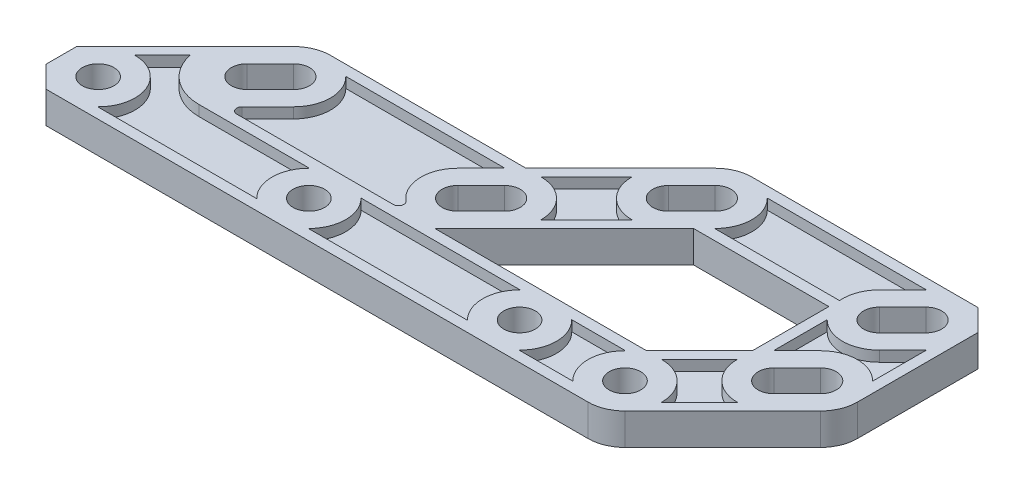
ISO-10303-21;
HEADER;
FILE_DESCRIPTION(('STEP AP214'),'2;1');
FILE_NAME('part.step','',(''),(''),'','','');
FILE_SCHEMA(('AUTOMOTIVE_DESIGN { 1 0 10303 214 1 1 1 1 }'));
ENDSEC;
DATA;
#1=APPLICATION_CONTEXT('core data for automotive mechanical design processes');
#2=APPLICATION_PROTOCOL_DEFINITION('international standard','automotive_design',2000,#1);
#3=PRODUCT_CONTEXT('',#1,'mechanical');
#4=PRODUCT('Part','Part','',(#3));
#5=PRODUCT_RELATED_PRODUCT_CATEGORY('part','',(#4));
#6=PRODUCT_DEFINITION_FORMATION('','',#4);
#7=PRODUCT_DEFINITION_CONTEXT('part definition',#1,'design');
#8=PRODUCT_DEFINITION('design','',#6,#7);
#9=PRODUCT_DEFINITION_SHAPE('','',#8);
#10=(LENGTH_UNIT() NAMED_UNIT(*) SI_UNIT(.MILLI.,.METRE.));
#11=(NAMED_UNIT(*) PLANE_ANGLE_UNIT() SI_UNIT($,.RADIAN.));
#12=(NAMED_UNIT(*) SI_UNIT($,.STERADIAN.) SOLID_ANGLE_UNIT());
#13=UNCERTAINTY_MEASURE_WITH_UNIT(LENGTH_MEASURE(1.E-05),#10,'distance_accuracy_value','');
#14=(GEOMETRIC_REPRESENTATION_CONTEXT(3) GLOBAL_UNCERTAINTY_ASSIGNED_CONTEXT((#13)) GLOBAL_UNIT_ASSIGNED_CONTEXT((#10,
#11,#12)) REPRESENTATION_CONTEXT('',''));
#15=CARTESIAN_POINT('',(0.,0.,0.));
#16=DIRECTION('',(0.,0.,1.));
#17=DIRECTION('',(1.,0.,0.));
#18=AXIS2_PLACEMENT_3D('',#15,#16,#17);
#19=CARTESIAN_POINT('',(50.,1.5,0.));
#20=DIRECTION('',(0.,1.,0.));
#21=DIRECTION('',(0.,0.,1.));
#22=AXIS2_PLACEMENT_3D('',#19,#20,#21);
#23=PLANE('',#22);
#24=CARTESIAN_POINT('',(20.,1.5,0.));
#25=DIRECTION('',(0.,1.,0.));
#26=DIRECTION('',(0.,0.,1.));
#27=AXIS2_PLACEMENT_3D('',#24,#25,#26);
#28=CIRCLE('',#27,1.5);
#29=CARTESIAN_POINT('',(20.,1.5,1.5));
#30=VERTEX_POINT('',#29);
#31=EDGE_CURVE('E1399',#30,#30,#28,.T.);
#32=ORIENTED_EDGE('',*,*,#31,.F.);
#33=EDGE_LOOP('',(#32));
#34=FACE_BOUND('',#33,.T.);
#35=CARTESIAN_POINT('',(50.,1.5,0.));
#36=DIRECTION('',(0.,1.,0.));
#37=DIRECTION('',(0.,0.,1.));
#38=AXIS2_PLACEMENT_3D('',#35,#36,#37);
#39=CIRCLE('',#38,1.5);
#40=CARTESIAN_POINT('',(50.,1.5,1.5));
#41=VERTEX_POINT('',#40);
#42=EDGE_CURVE('E1411',#41,#41,#39,.T.);
#43=ORIENTED_EDGE('',*,*,#42,.F.);
#44=EDGE_LOOP('',(#43));
#45=FACE_BOUND('',#44,.T.);
#46=DIRECTION('',(0.,0.,1.));
#47=VECTOR('',#46,1.);
#48=CARTESIAN_POINT('',(-3.5,1.5,-1.44974746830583));
#49=LINE('',#48,#47);
#50=CARTESIAN_POINT('',(-3.5,1.5,-1.44974746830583));
#51=VERTEX_POINT('',#50);
#52=CARTESIAN_POINT('',(-3.5,1.5,1.44974746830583));
#53=VERTEX_POINT('',#52);
#54=EDGE_CURVE('E1417',#51,#53,#49,.T.);
#55=ORIENTED_EDGE('',*,*,#54,.T.);
#56=DIRECTION('',(0.707106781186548,0.,0.707106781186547));
#57=VECTOR('',#56,1.);
#58=CARTESIAN_POINT('',(-3.5,1.5,1.44974746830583));
#59=LINE('',#58,#57);
#60=CARTESIAN_POINT('',(-1.44974746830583,1.5,3.5));
#61=VERTEX_POINT('',#60);
#62=EDGE_CURVE('E1420',#53,#61,#59,.T.);
#63=ORIENTED_EDGE('',*,*,#62,.T.);
#64=DIRECTION('',(1.,0.,0.));
#65=VECTOR('',#64,1.);
#66=CARTESIAN_POINT('',(-1.44974746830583,1.5,3.5));
#67=LINE('',#66,#65);
#68=CARTESIAN_POINT('',(50.,1.5,3.5));
#69=VERTEX_POINT('',#68);
#70=EDGE_CURVE('E1423',#61,#69,#67,.T.);
#71=ORIENTED_EDGE('',*,*,#70,.T.);
#72=CARTESIAN_POINT('',(50.,1.5,0.));
#73=DIRECTION('',(0.,1.,0.));
#74=DIRECTION('',(0.,0.,1.));
#75=AXIS2_PLACEMENT_3D('',#72,#73,#74);
#76=CIRCLE('',#75,3.50000000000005);
#77=CARTESIAN_POINT('',(52.474873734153,1.5,2.47487373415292));
#78=VERTEX_POINT('',#77);
#79=EDGE_CURVE('E1425',#69,#78,#76,.T.);
#80=ORIENTED_EDGE('',*,*,#79,.T.);
#81=DIRECTION('',(0.707106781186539,0.,-0.707106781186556));
#82=VECTOR('',#81,1.);
#83=CARTESIAN_POINT('',(52.474873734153,1.5,2.47487373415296));
#84=LINE('',#83,#82);
#85=CARTESIAN_POINT('',(61.7531467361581,1.5,-6.80339926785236));
#86=VERTEX_POINT('',#85);
#87=EDGE_CURVE('E1427',#78,#86,#84,.T.);
#88=ORIENTED_EDGE('',*,*,#87,.T.);
#89=CARTESIAN_POINT('',(59.2782730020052,1.5,-9.27827300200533));
#90=DIRECTION('',(0.,1.,0.));
#91=DIRECTION('',(0.,0.,1.));
#92=AXIS2_PLACEMENT_3D('',#89,#90,#91);
#93=CIRCLE('',#92,3.50000000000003);
#94=CARTESIAN_POINT('',(62.7782730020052,1.5,-9.27827300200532));
#95=VERTEX_POINT('',#94);
#96=EDGE_CURVE('E1429',#86,#95,#93,.T.);
#97=ORIENTED_EDGE('',*,*,#96,.T.);
#98=DIRECTION('',(0.,0.,-1.));
#99=VECTOR('',#98,1.);
#100=CARTESIAN_POINT('',(62.7782730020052,1.5,-9.27827300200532));
#101=LINE('',#100,#99);
#102=CARTESIAN_POINT('',(62.7782730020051,1.5,-20.7280204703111));
#103=VERTEX_POINT('',#102);
#104=EDGE_CURVE('E1431',#95,#103,#101,.T.);
#105=ORIENTED_EDGE('',*,*,#104,.T.);
#106=DIRECTION('',(-0.707106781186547,0.,-0.707106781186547));
#107=VECTOR('',#106,1.);
#108=CARTESIAN_POINT('',(62.7782730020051,1.5,-20.7280204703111));
#109=LINE('',#108,#107);
#110=CARTESIAN_POINT('',(60.728020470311,1.5,-22.7782730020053));
#111=VERTEX_POINT('',#110);
#112=EDGE_CURVE('E1433',#103,#111,#109,.T.);
#113=ORIENTED_EDGE('',*,*,#112,.T.);
#114=DIRECTION('',(-1.,0.,0.));
#115=VECTOR('',#114,1.);
#116=CARTESIAN_POINT('',(60.728020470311,1.5,-22.7782730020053));
#117=LINE('',#116,#115);
#118=CARTESIAN_POINT('',(39.2782730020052,1.5,-22.7782730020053));
#119=VERTEX_POINT('',#118);
#120=EDGE_CURVE('E1435',#111,#119,#117,.T.);
#121=ORIENTED_EDGE('',*,*,#120,.T.);
#122=CARTESIAN_POINT('',(39.2782730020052,1.5,-19.2782730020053));
#123=DIRECTION('',(0.,1.,0.));
#124=DIRECTION('',(0.,0.,1.));
#125=AXIS2_PLACEMENT_3D('',#122,#123,#124);
#126=CIRCLE('',#125,3.5);
#127=CARTESIAN_POINT('',(36.8033992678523,1.5,-21.7531467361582));
#128=VERTEX_POINT('',#127);
#129=EDGE_CURVE('E1437',#119,#128,#126,.T.);
#130=ORIENTED_EDGE('',*,*,#129,.T.);
#131=DIRECTION('',(-0.707106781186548,0.,0.707106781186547));
#132=VECTOR('',#131,1.);
#133=CARTESIAN_POINT('',(36.8033992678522,1.5,-21.7531467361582));
#134=LINE('',#133,#132);
#135=CARTESIAN_POINT('',(27.8285255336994,1.5,-12.7782730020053));
#136=VERTEX_POINT('',#135);
#137=EDGE_CURVE('E1439',#128,#136,#134,.T.);
#138=ORIENTED_EDGE('',*,*,#137,.T.);
#139=DIRECTION('',(-1.,0.,0.));
#140=VECTOR('',#139,1.);
#141=CARTESIAN_POINT('',(9.27827300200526,1.5,-12.7782730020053));
#142=LINE('',#141,#140);
#143=CARTESIAN_POINT('',(9.27827300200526,1.5,-12.7782730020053));
#144=VERTEX_POINT('',#143);
#145=EDGE_CURVE('E1441',#136,#144,#142,.T.);
#146=ORIENTED_EDGE('',*,*,#145,.T.);
#147=CARTESIAN_POINT('',(9.27827300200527,1.5,-9.2782730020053));
#148=DIRECTION('',(0.,1.,0.));
#149=DIRECTION('',(0.,0.,1.));
#150=AXIS2_PLACEMENT_3D('',#147,#148,#149);
#151=CIRCLE('',#150,3.5);
#152=CARTESIAN_POINT('',(6.80339926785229,1.5,-11.7531467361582));
#153=VERTEX_POINT('',#152);
#154=EDGE_CURVE('E1443',#144,#153,#151,.T.);
#155=ORIENTED_EDGE('',*,*,#154,.T.);
#156=DIRECTION('',(-0.707106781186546,0.,0.707106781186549));
#157=VECTOR('',#156,1.);
#158=CARTESIAN_POINT('',(6.80339926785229,1.5,-11.7531467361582));
#159=LINE('',#158,#157);
#160=EDGE_CURVE('E1445',#153,#51,#159,.T.);
#161=ORIENTED_EDGE('',*,*,#160,.T.);
#162=EDGE_LOOP('',(#55,#63,#71,#80,#88,#97,#105,#113,#121,#130,#138,#146,#155,#161));
#163=FACE_BOUND('',#162,.T.);
#164=CARTESIAN_POINT('',(40.,1.5,0.));
#165=DIRECTION('',(0.,1.,0.));
#166=DIRECTION('',(0.,0.,1.));
#167=AXIS2_PLACEMENT_3D('',#164,#165,#166);
#168=CIRCLE('',#167,1.5);
#169=CARTESIAN_POINT('',(40.,1.5,1.5));
#170=VERTEX_POINT('',#169);
#171=EDGE_CURVE('E1405',#170,#170,#168,.T.);
#172=ORIENTED_EDGE('',*,*,#171,.F.);
#173=EDGE_LOOP('',(#172));
#174=FACE_BOUND('',#173,.T.);
#175=CARTESIAN_POINT('',(0.,1.5,0.));
#176=DIRECTION('',(0.,1.,0.));
#177=DIRECTION('',(0.,0.,1.));
#178=AXIS2_PLACEMENT_3D('',#175,#176,#177);
#179=CIRCLE('',#178,1.5);
#180=CARTESIAN_POINT('',(0.,1.5,1.5));
#181=VERTEX_POINT('',#180);
#182=EDGE_CURVE('E1393',#181,#181,#179,.T.);
#183=ORIENTED_EDGE('',*,*,#182,.F.);
#184=EDGE_LOOP('',(#183));
#185=FACE_BOUND('',#184,.T.);
#186=DIRECTION('',(0.707106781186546,0.,-0.70710678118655));
#187=VECTOR('',#186,1.);
#188=CARTESIAN_POINT('',(58.1317279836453,1.5,-6.01040764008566));
#189=LINE('',#188,#187);
#190=CARTESIAN_POINT('',(58.1317279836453,1.5,-6.01040764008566));
#191=VERTEX_POINT('',#190);
#192=CARTESIAN_POINT('',(60.338933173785,1.5,-8.21761283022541));
#193=VERTEX_POINT('',#192);
#194=EDGE_CURVE('E1364',#191,#193,#189,.T.);
#195=ORIENTED_EDGE('',*,*,#194,.F.);
#196=CARTESIAN_POINT('',(57.0710678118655,1.5,-7.07106781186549));
#197=DIRECTION('',(0.,1.,0.));
#198=DIRECTION('',(0.,0.,1.));
#199=AXIS2_PLACEMENT_3D('',#196,#197,#198);
#200=CIRCLE('',#199,1.50000000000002);
#201=CARTESIAN_POINT('',(56.0104076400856,1.5,-8.13172798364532));
#202=VERTEX_POINT('',#201);
#203=EDGE_CURVE('E1362',#202,#191,#200,.T.);
#204=ORIENTED_EDGE('',*,*,#203,.F.);
#205=DIRECTION('',(-0.707106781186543,0.,0.707106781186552));
#206=VECTOR('',#205,1.);
#207=CARTESIAN_POINT('',(56.0104076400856,1.5,-8.13172798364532));
#208=LINE('',#207,#206);
#209=CARTESIAN_POINT('',(58.2176128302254,1.5,-10.3389331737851));
#210=VERTEX_POINT('',#209);
#211=EDGE_CURVE('E1370',#210,#202,#208,.T.);
#212=ORIENTED_EDGE('',*,*,#211,.F.);
#213=CARTESIAN_POINT('',(59.2782730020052,1.5,-9.27827300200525));
#214=DIRECTION('',(0.,1.,0.));
#215=DIRECTION('',(0.,0.,1.));
#216=AXIS2_PLACEMENT_3D('',#213,#214,#215);
#217=CIRCLE('',#216,1.50000000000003);
#218=EDGE_CURVE('E1367',#193,#210,#217,.T.);
#219=ORIENTED_EDGE('',*,*,#218,.F.);
#220=EDGE_LOOP('',(#195,#204,#212,#219));
#221=FACE_BOUND('',#220,.T.);
#222=DIRECTION('',(0.707106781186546,0.,-0.707106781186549));
#223=VECTOR('',#222,1.);
#224=CARTESIAN_POINT('',(58.1317279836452,1.5,-16.0104076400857));
#225=LINE('',#224,#223);
#226=CARTESIAN_POINT('',(58.1317279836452,1.5,-16.0104076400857));
#227=VERTEX_POINT('',#226);
#228=CARTESIAN_POINT('',(60.338933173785,1.5,-18.2176128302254));
#229=VERTEX_POINT('',#228);
#230=EDGE_CURVE('E1333',#227,#229,#225,.T.);
#231=ORIENTED_EDGE('',*,*,#230,.F.);
#232=CARTESIAN_POINT('',(57.0710678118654,1.5,-17.0710678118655));
#233=DIRECTION('',(0.,1.,0.));
#234=DIRECTION('',(0.,0.,1.));
#235=AXIS2_PLACEMENT_3D('',#232,#233,#234);
#236=CIRCLE('',#235,1.49999999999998);
#237=CARTESIAN_POINT('',(56.0104076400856,1.5,-18.1317279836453));
#238=VERTEX_POINT('',#237);
#239=EDGE_CURVE('E1331',#238,#227,#236,.T.);
#240=ORIENTED_EDGE('',*,*,#239,.F.);
#241=DIRECTION('',(-0.707106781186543,0.,0.707106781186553));
#242=VECTOR('',#241,1.);
#243=CARTESIAN_POINT('',(56.0104076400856,1.5,-18.1317279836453));
#244=LINE('',#243,#242);
#245=CARTESIAN_POINT('',(58.2176128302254,1.5,-20.3389331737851));
#246=VERTEX_POINT('',#245);
#247=EDGE_CURVE('E1339',#246,#238,#244,.T.);
#248=ORIENTED_EDGE('',*,*,#247,.F.);
#249=CARTESIAN_POINT('',(59.2782730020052,1.5,-19.2782730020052));
#250=DIRECTION('',(0.,1.,0.));
#251=DIRECTION('',(0.,0.,1.));
#252=AXIS2_PLACEMENT_3D('',#249,#250,#251);
#253=CIRCLE('',#252,1.49999999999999);
#254=EDGE_CURVE('E1336',#229,#246,#253,.T.);
#255=ORIENTED_EDGE('',*,*,#254,.F.);
#256=EDGE_LOOP('',(#231,#240,#248,#255));
#257=FACE_BOUND('',#256,.T.);
#258=DIRECTION('',(-0.707106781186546,0.,0.707106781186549));
#259=VECTOR('',#258,1.);
#260=CARTESIAN_POINT('',(38.2176128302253,1.5,-20.3389331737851));
#261=LINE('',#260,#259);
#262=CARTESIAN_POINT('',(38.2176128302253,1.5,-20.3389331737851));
#263=VERTEX_POINT('',#262);
#264=CARTESIAN_POINT('',(36.0104076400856,1.5,-18.1317279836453));
#265=VERTEX_POINT('',#264);
#266=EDGE_CURVE('E1302',#263,#265,#261,.T.);
#267=ORIENTED_EDGE('',*,*,#266,.F.);
#268=CARTESIAN_POINT('',(39.2782730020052,1.5,-19.2782730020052));
#269=DIRECTION('',(0.,1.,0.));
#270=DIRECTION('',(0.,0.,1.));
#271=AXIS2_PLACEMENT_3D('',#268,#269,#270);
#272=CIRCLE('',#271,1.50000000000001);
#273=CARTESIAN_POINT('',(40.3389331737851,1.5,-18.2176128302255));
#274=VERTEX_POINT('',#273);
#275=EDGE_CURVE('E1300',#274,#263,#272,.T.);
#276=ORIENTED_EDGE('',*,*,#275,.F.);
#277=DIRECTION('',(0.707106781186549,0.,-0.707106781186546));
#278=VECTOR('',#277,1.);
#279=CARTESIAN_POINT('',(40.3389331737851,1.5,-18.2176128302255));
#280=LINE('',#279,#278);
#281=CARTESIAN_POINT('',(38.1317279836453,1.5,-16.0104076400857));
#282=VERTEX_POINT('',#281);
#283=EDGE_CURVE('E1308',#282,#274,#280,.T.);
#284=ORIENTED_EDGE('',*,*,#283,.F.);
#285=CARTESIAN_POINT('',(37.0710678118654,1.5,-17.0710678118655));
#286=DIRECTION('',(0.,1.,0.));
#287=DIRECTION('',(0.,0.,1.));
#288=AXIS2_PLACEMENT_3D('',#285,#286,#287);
#289=CIRCLE('',#288,1.5);
#290=EDGE_CURVE('E1305',#265,#282,#289,.T.);
#291=ORIENTED_EDGE('',*,*,#290,.F.);
#292=EDGE_LOOP('',(#267,#276,#284,#291));
#293=FACE_BOUND('',#292,.T.);
#294=DIRECTION('',(0.707106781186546,0.,-0.707106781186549));
#295=VECTOR('',#294,1.);
#296=CARTESIAN_POINT('',(28.1317279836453,1.5,-6.01040764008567));
#297=LINE('',#296,#295);
#298=CARTESIAN_POINT('',(28.1317279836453,1.5,-6.01040764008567));
#299=VERTEX_POINT('',#298);
#300=CARTESIAN_POINT('',(30.338933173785,1.5,-8.21761283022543));
#301=VERTEX_POINT('',#300);
#302=EDGE_CURVE('E1271',#299,#301,#297,.T.);
#303=ORIENTED_EDGE('',*,*,#302,.F.);
#304=CARTESIAN_POINT('',(27.0710678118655,1.5,-7.07106781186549));
#305=DIRECTION('',(0.,1.,0.));
#306=DIRECTION('',(0.,0.,1.));
#307=AXIS2_PLACEMENT_3D('',#304,#305,#306);
#308=CIRCLE('',#307,1.5);
#309=CARTESIAN_POINT('',(26.0104076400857,1.5,-8.13172798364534));
#310=VERTEX_POINT('',#309);
#311=EDGE_CURVE('E1269',#310,#299,#308,.T.);
#312=ORIENTED_EDGE('',*,*,#311,.F.);
#313=DIRECTION('',(-0.707106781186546,0.,0.707106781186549));
#314=VECTOR('',#313,1.);
#315=CARTESIAN_POINT('',(26.0104076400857,1.5,-8.13172798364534));
#316=LINE('',#315,#314);
#317=CARTESIAN_POINT('',(28.2176128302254,1.5,-10.3389331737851));
#318=VERTEX_POINT('',#317);
#319=EDGE_CURVE('E1277',#318,#310,#316,.T.);
#320=ORIENTED_EDGE('',*,*,#319,.F.);
#321=CARTESIAN_POINT('',(29.2782730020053,1.5,-9.2782730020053));
#322=DIRECTION('',(0.,1.,0.));
#323=DIRECTION('',(0.,0.,1.));
#324=AXIS2_PLACEMENT_3D('',#321,#322,#323);
#325=CIRCLE('',#324,1.5);
#326=EDGE_CURVE('E1274',#301,#318,#325,.T.);
#327=ORIENTED_EDGE('',*,*,#326,.F.);
#328=EDGE_LOOP('',(#303,#312,#320,#327));
#329=FACE_BOUND('',#328,.T.);
#330=DIRECTION('',(-0.707106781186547,0.,0.707106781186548));
#331=VECTOR('',#330,1.);
#332=CARTESIAN_POINT('',(8.21761283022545,1.5,-10.3389331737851));
#333=LINE('',#332,#331);
#334=CARTESIAN_POINT('',(8.21761283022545,1.5,-10.3389331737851));
#335=VERTEX_POINT('',#334);
#336=CARTESIAN_POINT('',(6.01040764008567,1.5,-8.13172798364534));
#337=VERTEX_POINT('',#336);
#338=EDGE_CURVE('E1240',#335,#337,#333,.T.);
#339=ORIENTED_EDGE('',*,*,#338,.F.);
#340=CARTESIAN_POINT('',(9.2782730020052,1.5,-9.27827300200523));
#341=DIRECTION('',(0.,1.,0.));
#342=DIRECTION('',(0.,0.,1.));
#343=AXIS2_PLACEMENT_3D('',#340,#341,#342);
#344=CIRCLE('',#343,1.5);
#345=CARTESIAN_POINT('',(10.3389331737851,1.5,-8.21761283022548));
#346=VERTEX_POINT('',#345);
#347=EDGE_CURVE('E1238',#346,#335,#344,.T.);
#348=ORIENTED_EDGE('',*,*,#347,.F.);
#349=DIRECTION('',(0.707106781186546,0.,-0.707106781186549));
#350=VECTOR('',#349,1.);
#351=CARTESIAN_POINT('',(10.3389331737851,1.5,-8.21761283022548));
#352=LINE('',#351,#350);
#353=CARTESIAN_POINT('',(8.13172798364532,1.5,-6.0104076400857));
#354=VERTEX_POINT('',#353);
#355=EDGE_CURVE('E1246',#354,#346,#352,.T.);
#356=ORIENTED_EDGE('',*,*,#355,.F.);
#357=CARTESIAN_POINT('',(7.07106781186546,1.5,-7.07106781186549));
#358=DIRECTION('',(0.,1.,0.));
#359=DIRECTION('',(0.,0.,1.));
#360=AXIS2_PLACEMENT_3D('',#357,#358,#359);
#361=CIRCLE('',#360,1.5);
#362=EDGE_CURVE('E1243',#337,#354,#361,.T.);
#363=ORIENTED_EDGE('',*,*,#362,.F.);
#364=EDGE_LOOP('',(#339,#348,#356,#363));
#365=FACE_BOUND('',#364,.T.);
#366=DIRECTION('',(0.707106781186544,0.,-0.707106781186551));
#367=VECTOR('',#366,1.);
#368=CARTESIAN_POINT('',(48.5502525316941,1.5,-3.5));
#369=LINE('',#368,#367);
#370=CARTESIAN_POINT('',(48.5502525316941,1.5,-3.5));
#371=VERTEX_POINT('',#370);
#372=CARTESIAN_POINT('',(53.5710678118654,1.5,-8.52081528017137));
#373=VERTEX_POINT('',#372);
#374=EDGE_CURVE('E1202',#371,#373,#369,.T.);
#375=ORIENTED_EDGE('',*,*,#374,.F.);
#376=DIRECTION('',(1.,0.,0.));
#377=VECTOR('',#376,1.);
#378=CARTESIAN_POINT('',(28.4497474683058,1.5,-3.5));
#379=LINE('',#378,#377);
#380=CARTESIAN_POINT('',(28.4497474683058,1.5,-3.5));
#381=VERTEX_POINT('',#380);
#382=EDGE_CURVE('E1200',#381,#371,#379,.T.);
#383=ORIENTED_EDGE('',*,*,#382,.F.);
#384=DIRECTION('',(-0.707106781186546,0.,0.707106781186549));
#385=VECTOR('',#384,1.);
#386=CARTESIAN_POINT('',(28.4497474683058,1.5,-3.5));
#387=LINE('',#386,#385);
#388=CARTESIAN_POINT('',(40.7280204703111,1.5,-15.7782730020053));
#389=VERTEX_POINT('',#388);
#390=EDGE_CURVE('E1210',#389,#381,#387,.T.);
#391=ORIENTED_EDGE('',*,*,#390,.F.);
#392=DIRECTION('',(-1.,0.,0.));
#393=VECTOR('',#392,1.);
#394=CARTESIAN_POINT('',(53.5710678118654,1.5,-15.7782730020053));
#395=LINE('',#394,#393);
#396=CARTESIAN_POINT('',(53.5710678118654,1.5,-15.7782730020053));
#397=VERTEX_POINT('',#396);
#398=EDGE_CURVE('E1207',#397,#389,#395,.T.);
#399=ORIENTED_EDGE('',*,*,#398,.F.);
#400=DIRECTION('',(0.,0.,-1.));
#401=VECTOR('',#400,1.);
#402=CARTESIAN_POINT('',(53.5710678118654,1.5,-15.7782730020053));
#403=LINE('',#402,#401);
#404=EDGE_CURVE('E1205',#373,#397,#403,.T.);
#405=ORIENTED_EDGE('',*,*,#404,.F.);
#406=EDGE_LOOP('',(#375,#383,#391,#399,#405));
#407=FACE_BOUND('',#406,.T.);
#408=DIRECTION('',(1.,0.,0.));
#409=VECTOR('',#408,1.);
#410=CARTESIAN_POINT('',(50.,1.5,-2.50000000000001));
#411=LINE('',#410,#409);
#412=CARTESIAN_POINT('',(7.0710678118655,1.5,-2.5));
#413=VERTEX_POINT('',#412);
#414=CARTESIAN_POINT('',(17.5505102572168,1.5,-2.5));
#415=VERTEX_POINT('',#414);
#416=EDGE_CURVE('E1651',#413,#415,#411,.T.);
#417=ORIENTED_EDGE('',*,*,#416,.T.);
#418=CARTESIAN_POINT('',(20.,1.5,0.));
#419=DIRECTION('',(0.,1.,0.));
#420=DIRECTION('',(0.,0.,1.));
#421=AXIS2_PLACEMENT_3D('',#418,#419,#420);
#422=CIRCLE('',#421,3.5);
#423=CARTESIAN_POINT('',(17.5505102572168,1.5,2.5));
#424=VERTEX_POINT('',#423);
#425=EDGE_CURVE('E1654',#415,#424,#422,.T.);
#426=ORIENTED_EDGE('',*,*,#425,.T.);
#427=DIRECTION('',(-1.,0.,0.));
#428=VECTOR('',#427,1.);
#429=CARTESIAN_POINT('',(50.,1.5,2.5));
#430=LINE('',#429,#428);
#431=CARTESIAN_POINT('',(2.44948974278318,1.5,2.5));
#432=VERTEX_POINT('',#431);
#433=EDGE_CURVE('E1639',#424,#432,#430,.T.);
#434=ORIENTED_EDGE('',*,*,#433,.T.);
#435=CARTESIAN_POINT('',(0.,1.5,0.));
#436=DIRECTION('',(0.,1.,0.));
#437=DIRECTION('',(0.,0.,1.));
#438=AXIS2_PLACEMENT_3D('',#435,#436,#437);
#439=CIRCLE('',#438,3.5);
#440=CARTESIAN_POINT('',(-0.0357161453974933,1.5,-3.49981776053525));
#441=VERTEX_POINT('',#440);
#442=EDGE_CURVE('E1642',#432,#441,#439,.T.);
#443=ORIENTED_EDGE('',*,*,#442,.T.);
#444=DIRECTION('',(0.707106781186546,0.,-0.707106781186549));
#445=VECTOR('',#444,1.);
#446=CARTESIAN_POINT('',(23.2322330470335,1.5,-26.7677669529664));
#447=LINE('',#446,#445);
#448=CARTESIAN_POINT('',(2.5973203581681,1.5,-6.13285426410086));
#449=VERTEX_POINT('',#448);
#450=EDGE_CURVE('E1645',#441,#449,#447,.T.);
#451=ORIENTED_EDGE('',*,*,#450,.T.);
#452=CARTESIAN_POINT('',(7.0710678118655,1.5,-7.07106781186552));
#453=DIRECTION('',(0.,1.,0.));
#454=DIRECTION('',(0.,0.,1.));
#455=AXIS2_PLACEMENT_3D('',#452,#453,#454);
#456=CIRCLE('',#455,4.57106781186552);
#457=EDGE_CURVE('E1648',#449,#413,#456,.T.);
#458=ORIENTED_EDGE('',*,*,#457,.T.);
#459=EDGE_LOOP('',(#417,#426,#434,#443,#451,#458));
#460=FACE_BOUND('',#459,.T.);
#461=DIRECTION('',(-0.707106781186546,0.,0.707106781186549));
#462=VECTOR('',#461,1.);
#463=CARTESIAN_POINT('',(36.7677669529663,1.5,-13.2322330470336));
#464=LINE('',#463,#462);
#465=CARTESIAN_POINT('',(37.1067839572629,1.5,-13.5712500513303));
#466=VERTEX_POINT('',#465);
#467=CARTESIAN_POINT('',(32.7780907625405,1.5,-9.24255685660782));
#468=VERTEX_POINT('',#467);
#469=EDGE_CURVE('E1663',#466,#468,#464,.T.);
#470=ORIENTED_EDGE('',*,*,#469,.T.);
#471=CARTESIAN_POINT('',(29.2782730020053,1.5,-9.2782730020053));
#472=DIRECTION('',(0.,1.,0.));
#473=DIRECTION('',(0.,0.,1.));
#474=AXIS2_PLACEMENT_3D('',#471,#472,#473);
#475=CIRCLE('',#474,3.5);
#476=CARTESIAN_POINT('',(29.2425568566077,1.5,-12.7780907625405));
#477=VERTEX_POINT('',#476);
#478=EDGE_CURVE('E1666',#468,#477,#475,.T.);
#479=ORIENTED_EDGE('',*,*,#478,.T.);
#480=DIRECTION('',(0.707106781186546,0.,-0.707106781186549));
#481=VECTOR('',#480,1.);
#482=CARTESIAN_POINT('',(33.2322330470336,1.5,-16.7677669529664));
#483=LINE('',#482,#481);
#484=CARTESIAN_POINT('',(33.5712500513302,1.5,-17.106783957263));
#485=VERTEX_POINT('',#484);
#486=EDGE_CURVE('E1657',#477,#485,#483,.T.);
#487=ORIENTED_EDGE('',*,*,#486,.T.);
#488=CARTESIAN_POINT('',(37.0710678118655,1.5,-17.0710678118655));
#489=DIRECTION('',(0.,1.,0.));
#490=DIRECTION('',(0.,0.,1.));
#491=AXIS2_PLACEMENT_3D('',#488,#489,#490);
#492=CIRCLE('',#491,3.50000000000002);
#493=EDGE_CURVE('E1660',#485,#466,#492,.T.);
#494=ORIENTED_EDGE('',*,*,#493,.T.);
#495=EDGE_LOOP('',(#470,#479,#487,#494));
#496=FACE_BOUND('',#495,.T.);
#497=DIRECTION('',(-1.,0.,0.));
#498=VECTOR('',#497,1.);
#499=CARTESIAN_POINT('',(50.,1.5,-16.7782730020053));
#500=LINE('',#499,#498);
#501=CARTESIAN_POINT('',(53.5833362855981,1.5,-16.7782730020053));
#502=VERTEX_POINT('',#501);
#503=CARTESIAN_POINT('',(41.7277627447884,1.5,-16.7782730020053));
#504=VERTEX_POINT('',#503);
#505=EDGE_CURVE('E1678',#502,#504,#500,.T.);
#506=ORIENTED_EDGE('',*,*,#505,.T.);
#507=CARTESIAN_POINT('',(39.2782730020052,1.5,-19.2782730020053));
#508=DIRECTION('',(0.,1.,0.));
#509=DIRECTION('',(0.,0.,1.));
#510=AXIS2_PLACEMENT_3D('',#507,#508,#509);
#511=CIRCLE('',#510,3.49999999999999);
#512=CARTESIAN_POINT('',(41.7277627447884,1.5,-21.7782730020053));
#513=VERTEX_POINT('',#512);
#514=EDGE_CURVE('E1681',#504,#513,#511,.T.);
#515=ORIENTED_EDGE('',*,*,#514,.T.);
#516=DIRECTION('',(1.,0.,0.));
#517=VECTOR('',#516,1.);
#518=CARTESIAN_POINT('',(50.,1.5,-21.7782730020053));
#519=LINE('',#518,#517);
#520=CARTESIAN_POINT('',(56.8285255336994,1.5,-21.7782730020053));
#521=VERTEX_POINT('',#520);
#522=EDGE_CURVE('E1669',#513,#521,#519,.T.);
#523=ORIENTED_EDGE('',*,*,#522,.T.);
#524=DIRECTION('',(-0.707106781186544,0.,0.707106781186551));
#525=VECTOR('',#524,1.);
#526=CARTESIAN_POINT('',(42.5251262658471,1.5,-7.47487373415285));
#527=LINE('',#526,#525);
#528=CARTESIAN_POINT('',(54.5961940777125,1.5,-19.5459415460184));
#529=VERTEX_POINT('',#528);
#530=EDGE_CURVE('E1672',#521,#529,#527,.T.);
#531=ORIENTED_EDGE('',*,*,#530,.T.);
#532=CARTESIAN_POINT('',(57.0710678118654,1.5,-17.0710678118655));
#533=DIRECTION('',(0.,1.,0.));
#534=DIRECTION('',(0.,0.,1.));
#535=AXIS2_PLACEMENT_3D('',#532,#533,#534);
#536=CIRCLE('',#535,3.5);
#537=EDGE_CURVE('E1675',#529,#502,#536,.T.);
#538=ORIENTED_EDGE('',*,*,#537,.T.);
#539=EDGE_LOOP('',(#506,#515,#523,#531,#538));
#540=FACE_BOUND('',#539,.T.);
#541=DIRECTION('',(0.,0.,-1.));
#542=VECTOR('',#541,1.);
#543=CARTESIAN_POINT('',(54.5710678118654,1.5,0.));
#544=LINE('',#543,#542);
#545=CARTESIAN_POINT('',(54.5710678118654,1.5,-9.52081528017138));
#546=VERTEX_POINT('',#545);
#547=CARTESIAN_POINT('',(54.5710678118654,1.5,-14.6215780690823));
#548=VERTEX_POINT('',#547);
#549=EDGE_CURVE('E1694',#546,#548,#544,.T.);
#550=ORIENTED_EDGE('',*,*,#549,.T.);
#551=CARTESIAN_POINT('',(57.0710678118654,1.5,-17.0710678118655));
#552=DIRECTION('',(0.,1.,0.));
#553=DIRECTION('',(0.,0.,1.));
#554=AXIS2_PLACEMENT_3D('',#551,#552,#553);
#555=CIRCLE('',#554,3.5);
#556=CARTESIAN_POINT('',(59.5459415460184,1.5,-14.5961940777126));
#557=VERTEX_POINT('',#556);
#558=EDGE_CURVE('E1697',#548,#557,#555,.T.);
#559=ORIENTED_EDGE('',*,*,#558,.T.);
#560=DIRECTION('',(0.707106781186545,0.,-0.70710678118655));
#561=VECTOR('',#560,1.);
#562=CARTESIAN_POINT('',(47.4748737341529,1.5,-2.52512626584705));
#563=LINE('',#562,#561);
#564=CARTESIAN_POINT('',(61.7782730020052,1.5,-16.8285255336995));
#565=VERTEX_POINT('',#564);
#566=EDGE_CURVE('E783',#557,#565,#563,.T.);
#567=ORIENTED_EDGE('',*,*,#566,.T.);
#568=DIRECTION('',(0.,0.,1.));
#569=VECTOR('',#568,1.);
#570=CARTESIAN_POINT('',(61.7782730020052,1.5,0.));
#571=LINE('',#570,#569);
#572=CARTESIAN_POINT('',(61.7782730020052,1.5,-11.7277627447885));
#573=VERTEX_POINT('',#572);
#574=EDGE_CURVE('E1685',#565,#573,#571,.T.);
#575=ORIENTED_EDGE('',*,*,#574,.T.);
#576=CARTESIAN_POINT('',(59.2782730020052,1.5,-9.27827300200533));
#577=DIRECTION('',(0.,1.,0.));
#578=DIRECTION('',(0.,0.,1.));
#579=AXIS2_PLACEMENT_3D('',#576,#577,#578);
#580=CIRCLE('',#579,3.50000000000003);
#581=CARTESIAN_POINT('',(56.8033992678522,1.5,-11.7531467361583));
#582=VERTEX_POINT('',#581);
#583=EDGE_CURVE('E1688',#573,#582,#580,.T.);
#584=ORIENTED_EDGE('',*,*,#583,.T.);
#585=DIRECTION('',(-0.707106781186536,0.,0.707106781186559));
#586=VECTOR('',#585,1.);
#587=CARTESIAN_POINT('',(47.5251262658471,1.5,-2.47487373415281));
#588=LINE('',#587,#586);
#589=EDGE_CURVE('E1691',#582,#546,#588,.T.);
#590=ORIENTED_EDGE('',*,*,#589,.T.);
#591=EDGE_LOOP('',(#550,#559,#567,#575,#584,#590));
#592=FACE_BOUND('',#591,.T.);
#593=DIRECTION('',(-0.707106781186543,0.,0.707106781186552));
#594=VECTOR('',#593,1.);
#595=CARTESIAN_POINT('',(51.7677669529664,1.5,1.76776695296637));
#596=LINE('',#595,#594);
#597=CARTESIAN_POINT('',(57.1067839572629,1.5,-3.57125005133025));
#598=VERTEX_POINT('',#597);
#599=CARTESIAN_POINT('',(53.4998177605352,1.5,0.0357161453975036));
#600=VERTEX_POINT('',#599);
#601=EDGE_CURVE('E1705',#598,#600,#596,.T.);
#602=ORIENTED_EDGE('',*,*,#601,.T.);
#603=CARTESIAN_POINT('',(50.,1.5,0.));
#604=DIRECTION('',(0.,1.,0.));
#605=DIRECTION('',(0.,0.,1.));
#606=AXIS2_PLACEMENT_3D('',#603,#604,#605);
#607=CIRCLE('',#606,3.5);
#608=CARTESIAN_POINT('',(50.,1.5,-3.5));
#609=VERTEX_POINT('',#608);
#610=EDGE_CURVE('E1708',#600,#609,#607,.T.);
#611=ORIENTED_EDGE('',*,*,#610,.T.);
#612=DIRECTION('',(0.703597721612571,0.,-0.710598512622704));
#613=VECTOR('',#612,1.);
#614=CARTESIAN_POINT('',(48.2500857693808,1.5,-1.7326741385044));
#615=LINE('',#614,#613);
#616=CARTESIAN_POINT('',(53.5712500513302,1.5,-7.10678395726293));
#617=VERTEX_POINT('',#616);
#618=EDGE_CURVE('E1699',#609,#617,#615,.T.);
#619=ORIENTED_EDGE('',*,*,#618,.T.);
#620=CARTESIAN_POINT('',(57.0710678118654,1.5,-7.07106781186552));
#621=DIRECTION('',(0.,1.,0.));
#622=DIRECTION('',(0.,0.,1.));
#623=AXIS2_PLACEMENT_3D('',#620,#621,#622);
#624=CIRCLE('',#623,3.50000000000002);
#625=EDGE_CURVE('E1702',#617,#598,#624,.T.);
#626=ORIENTED_EDGE('',*,*,#625,.T.);
#627=EDGE_LOOP('',(#602,#611,#619,#626));
#628=FACE_BOUND('',#627,.T.);
#629=DIRECTION('',(-1.,0.,0.));
#630=VECTOR('',#629,1.);
#631=CARTESIAN_POINT('',(50.,1.5,2.5));
#632=LINE('',#631,#630);
#633=CARTESIAN_POINT('',(47.5505102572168,1.5,2.5));
#634=VERTEX_POINT('',#633);
#635=CARTESIAN_POINT('',(42.4494897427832,1.5,2.5));
#636=VERTEX_POINT('',#635);
#637=EDGE_CURVE('E1717',#634,#636,#632,.T.);
#638=ORIENTED_EDGE('',*,*,#637,.T.);
#639=CARTESIAN_POINT('',(40.,1.5,0.));
#640=DIRECTION('',(0.,1.,0.));
#641=DIRECTION('',(0.,0.,1.));
#642=AXIS2_PLACEMENT_3D('',#639,#640,#641);
#643=CIRCLE('',#642,3.5);
#644=CARTESIAN_POINT('',(42.4494897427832,1.5,-2.5));
#645=VERTEX_POINT('',#644);
#646=EDGE_CURVE('E1720',#636,#645,#643,.T.);
#647=ORIENTED_EDGE('',*,*,#646,.T.);
#648=DIRECTION('',(1.,0.,0.));
#649=VECTOR('',#648,1.);
#650=CARTESIAN_POINT('',(50.,1.5,-2.5));
#651=LINE('',#650,#649);
#652=CARTESIAN_POINT('',(47.5505102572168,1.5,-2.5));
#653=VERTEX_POINT('',#652);
#654=EDGE_CURVE('E1711',#645,#653,#651,.T.);
#655=ORIENTED_EDGE('',*,*,#654,.T.);
#656=CARTESIAN_POINT('',(50.,1.5,0.));
#657=DIRECTION('',(0.,1.,0.));
#658=DIRECTION('',(0.,0.,1.));
#659=AXIS2_PLACEMENT_3D('',#656,#657,#658);
#660=CIRCLE('',#659,3.5);
#661=EDGE_CURVE('E1714',#653,#634,#660,.T.);
#662=ORIENTED_EDGE('',*,*,#661,.T.);
#663=EDGE_LOOP('',(#638,#647,#655,#662));
#664=FACE_BOUND('',#663,.T.);
#665=CARTESIAN_POINT('',(27.0710678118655,1.5,-7.07106781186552));
#666=DIRECTION('',(0.,1.,0.));
#667=DIRECTION('',(0.,0.,1.));
#668=AXIS2_PLACEMENT_3D('',#665,#666,#667);
#669=CIRCLE('',#668,3.5);
#670=CARTESIAN_POINT('',(24.5961940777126,1.5,-9.54594154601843));
#671=VERTEX_POINT('',#670);
#672=CARTESIAN_POINT('',(24.8285156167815,1.5,-4.38388347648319));
#673=VERTEX_POINT('',#672);
#674=EDGE_CURVE('E1741',#671,#673,#669,.T.);
#675=ORIENTED_EDGE('',*,*,#674,.T.);
#676=CARTESIAN_POINT('',(24.5081510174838,1.5,-4.));
#677=DIRECTION('',(0.,1.,0.));
#678=DIRECTION('',(0.,0.,1.));
#679=AXIS2_PLACEMENT_3D('',#676,#677,#678);
#680=CIRCLE('',#679,0.499999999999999);
#681=CARTESIAN_POINT('',(24.5081510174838,1.5,-3.5));
#682=VERTEX_POINT('',#681);
#683=EDGE_CURVE('E1744',#673,#682,#680,.F.);
#684=ORIENTED_EDGE('',*,*,#683,.T.);
#685=DIRECTION('',(-1.,0.,0.));
#686=VECTOR('',#685,1.);
#687=CARTESIAN_POINT('',(50.,1.5,-3.5));
#688=LINE('',#687,#686);
#689=CARTESIAN_POINT('',(9.65685424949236,1.5,-3.5));
#690=VERTEX_POINT('',#689);
#691=EDGE_CURVE('E1723',#682,#690,#688,.T.);
#692=ORIENTED_EDGE('',*,*,#691,.T.);
#693=CARTESIAN_POINT('',(9.65685424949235,1.5,-4.));
#694=DIRECTION('',(0.,1.,0.));
#695=DIRECTION('',(0.,0.,1.));
#696=AXIS2_PLACEMENT_3D('',#693,#694,#695);
#697=CIRCLE('',#696,0.499999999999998);
#698=CARTESIAN_POINT('',(9.30330085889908,1.5,-4.35355339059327));
#699=VERTEX_POINT('',#698);
#700=EDGE_CURVE('E1726',#690,#699,#697,.F.);
#701=ORIENTED_EDGE('',*,*,#700,.T.);
#702=DIRECTION('',(0.707106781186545,0.,-0.70710678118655));
#703=VECTOR('',#702,1.);
#704=CARTESIAN_POINT('',(27.4748737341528,1.5,-22.5251262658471));
#705=LINE('',#704,#703);
#706=CARTESIAN_POINT('',(11.7531467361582,1.5,-6.80339926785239));
#707=VERTEX_POINT('',#706);
#708=EDGE_CURVE('E1729',#699,#707,#705,.T.);
#709=ORIENTED_EDGE('',*,*,#708,.T.);
#710=CARTESIAN_POINT('',(9.27827300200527,1.5,-9.2782730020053));
#711=DIRECTION('',(0.,1.,0.));
#712=DIRECTION('',(0.,0.,1.));
#713=AXIS2_PLACEMENT_3D('',#710,#711,#712);
#714=CIRCLE('',#713,3.5);
#715=CARTESIAN_POINT('',(11.7277627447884,1.5,-11.7782730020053));
#716=VERTEX_POINT('',#715);
#717=EDGE_CURVE('E1732',#707,#716,#714,.T.);
#718=ORIENTED_EDGE('',*,*,#717,.T.);
#719=DIRECTION('',(1.,0.,0.));
#720=VECTOR('',#719,1.);
#721=CARTESIAN_POINT('',(50.,1.5,-11.7782730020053));
#722=LINE('',#721,#720);
#723=CARTESIAN_POINT('',(26.8285255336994,1.5,-11.7782730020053));
#724=VERTEX_POINT('',#723);
#725=EDGE_CURVE('E1735',#716,#724,#722,.T.);
#726=ORIENTED_EDGE('',*,*,#725,.T.);
#727=DIRECTION('',(-0.707106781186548,0.,0.707106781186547));
#728=VECTOR('',#727,1.);
#729=CARTESIAN_POINT('',(32.5251262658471,1.5,-17.4748737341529));
#730=LINE('',#729,#728);
#731=EDGE_CURVE('E1738',#724,#671,#730,.T.);
#732=ORIENTED_EDGE('',*,*,#731,.T.);
#733=EDGE_LOOP('',(#675,#684,#692,#701,#709,#718,#726,#732));
#734=FACE_BOUND('',#733,.T.);
#735=DIRECTION('',(1.,0.,0.));
#736=VECTOR('',#735,1.);
#737=CARTESIAN_POINT('',(50.,1.5,-2.5));
#738=LINE('',#737,#736);
#739=CARTESIAN_POINT('',(22.4494897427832,1.5,-2.5));
#740=VERTEX_POINT('',#739);
#741=CARTESIAN_POINT('',(37.5505102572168,1.5,-2.5));
#742=VERTEX_POINT('',#741);
#743=EDGE_CURVE('E43',#740,#742,#738,.T.);
#744=ORIENTED_EDGE('',*,*,#743,.T.);
#745=CARTESIAN_POINT('',(40.,1.5,0.));
#746=DIRECTION('',(0.,1.,0.));
#747=DIRECTION('',(0.,0.,1.));
#748=AXIS2_PLACEMENT_3D('',#745,#746,#747);
#749=CIRCLE('',#748,3.5);
#750=CARTESIAN_POINT('',(37.5505102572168,1.5,2.5));
#751=VERTEX_POINT('',#750);
#752=EDGE_CURVE('E11',#742,#751,#749,.T.);
#753=ORIENTED_EDGE('',*,*,#752,.T.);
#754=DIRECTION('',(-1.,0.,0.));
#755=VECTOR('',#754,1.);
#756=CARTESIAN_POINT('',(50.,1.5,2.5));
#757=LINE('',#756,#755);
#758=CARTESIAN_POINT('',(22.4494897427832,1.5,2.5));
#759=VERTEX_POINT('',#758);
#760=EDGE_CURVE('E1747',#751,#759,#757,.T.);
#761=ORIENTED_EDGE('',*,*,#760,.T.);
#762=CARTESIAN_POINT('',(20.,1.5,0.));
#763=DIRECTION('',(0.,1.,0.));
#764=DIRECTION('',(0.,0.,1.));
#765=AXIS2_PLACEMENT_3D('',#762,#763,#764);
#766=CIRCLE('',#765,3.5);
#767=EDGE_CURVE('E1750',#759,#740,#766,.T.);
#768=ORIENTED_EDGE('',*,*,#767,.T.);
#769=EDGE_LOOP('',(#744,#753,#761,#768));
#770=FACE_BOUND('',#769,.T.);
#771=ADVANCED_FACE('F35',(#34,#45,#163,#174,#185,#221,#257,#293,#329,#365,#407,#460,#496,#540,
#592,#628,#664,#734,#770),#23,.T.);
#772=CARTESIAN_POINT('',(50.,-1.5,0.));
#773=DIRECTION('',(0.,1.,0.));
#774=DIRECTION('',(0.,0.,1.));
#775=AXIS2_PLACEMENT_3D('',#772,#773,#774);
#776=PLANE('',#775);
#777=DIRECTION('',(1.,0.,0.));
#778=VECTOR('',#777,1.);
#779=CARTESIAN_POINT('',(50.,-1.5,2.5));
#780=LINE('',#779,#778);
#781=CARTESIAN_POINT('',(22.4494897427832,-1.5,2.5));
#782=VERTEX_POINT('',#781);
#783=CARTESIAN_POINT('',(37.5505102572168,-1.5,2.5));
#784=VERTEX_POINT('',#783);
#785=EDGE_CURVE('E1633',#782,#784,#780,.T.);
#786=ORIENTED_EDGE('',*,*,#785,.T.);
#787=CARTESIAN_POINT('',(40.,-1.5,0.));
#788=DIRECTION('',(0.,1.,0.));
#789=DIRECTION('',(0.,0.,1.));
#790=AXIS2_PLACEMENT_3D('',#787,#788,#789);
#791=CIRCLE('',#790,3.5);
#792=CARTESIAN_POINT('',(37.5505102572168,-1.5,-2.5));
#793=VERTEX_POINT('',#792);
#794=EDGE_CURVE('E1636',#784,#793,#791,.F.);
#795=ORIENTED_EDGE('',*,*,#794,.T.);
#796=DIRECTION('',(-1.,0.,0.));
#797=VECTOR('',#796,1.);
#798=CARTESIAN_POINT('',(50.,-1.5,-2.5));
#799=LINE('',#798,#797);
#800=CARTESIAN_POINT('',(22.4494897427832,-1.5,-2.5));
#801=VERTEX_POINT('',#800);
#802=EDGE_CURVE('E1627',#793,#801,#799,.T.);
#803=ORIENTED_EDGE('',*,*,#802,.T.);
#804=CARTESIAN_POINT('',(20.,-1.5,0.));
#805=DIRECTION('',(0.,1.,0.));
#806=DIRECTION('',(0.,0.,1.));
#807=AXIS2_PLACEMENT_3D('',#804,#805,#806);
#808=CIRCLE('',#807,3.5);
#809=EDGE_CURVE('E1630',#801,#782,#808,.F.);
#810=ORIENTED_EDGE('',*,*,#809,.T.);
#811=EDGE_LOOP('',(#786,#795,#803,#810));
#812=FACE_BOUND('',#811,.T.);
#813=DIRECTION('',(1.,0.,0.));
#814=VECTOR('',#813,1.);
#815=CARTESIAN_POINT('',(50.,-1.5,-3.5));
#816=LINE('',#815,#814);
#817=CARTESIAN_POINT('',(9.65685424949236,-1.5,-3.5));
#818=VERTEX_POINT('',#817);
#819=CARTESIAN_POINT('',(24.5081510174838,-1.5,-3.5));
#820=VERTEX_POINT('',#819);
#821=EDGE_CURVE('E1621',#818,#820,#816,.T.);
#822=ORIENTED_EDGE('',*,*,#821,.T.);
#823=CARTESIAN_POINT('',(24.5081510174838,-1.5,-4.));
#824=DIRECTION('',(0.,1.,0.));
#825=DIRECTION('',(0.,0.,1.));
#826=AXIS2_PLACEMENT_3D('',#823,#824,#825);
#827=CIRCLE('',#826,0.499999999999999);
#828=CARTESIAN_POINT('',(24.8285156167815,-1.5,-4.38388347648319));
#829=VERTEX_POINT('',#828);
#830=EDGE_CURVE('E1624',#820,#829,#827,.T.);
#831=ORIENTED_EDGE('',*,*,#830,.T.);
#832=CARTESIAN_POINT('',(27.0710678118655,-1.5,-7.07106781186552));
#833=DIRECTION('',(0.,1.,0.));
#834=DIRECTION('',(0.,0.,1.));
#835=AXIS2_PLACEMENT_3D('',#832,#833,#834);
#836=CIRCLE('',#835,3.5);
#837=CARTESIAN_POINT('',(24.5961940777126,-1.5,-9.54594154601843));
#838=VERTEX_POINT('',#837);
#839=EDGE_CURVE('E1603',#829,#838,#836,.F.);
#840=ORIENTED_EDGE('',*,*,#839,.T.);
#841=DIRECTION('',(0.707106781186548,0.,-0.707106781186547));
#842=VECTOR('',#841,1.);
#843=CARTESIAN_POINT('',(32.5251262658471,-1.5,-17.4748737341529));
#844=LINE('',#843,#842);
#845=CARTESIAN_POINT('',(26.8285255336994,-1.5,-11.7782730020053));
#846=VERTEX_POINT('',#845);
#847=EDGE_CURVE('E1606',#838,#846,#844,.T.);
#848=ORIENTED_EDGE('',*,*,#847,.T.);
#849=DIRECTION('',(-1.,0.,0.));
#850=VECTOR('',#849,1.);
#851=CARTESIAN_POINT('',(50.,-1.5,-11.7782730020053));
#852=LINE('',#851,#850);
#853=CARTESIAN_POINT('',(11.7277627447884,-1.5,-11.7782730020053));
#854=VERTEX_POINT('',#853);
#855=EDGE_CURVE('E1609',#846,#854,#852,.T.);
#856=ORIENTED_EDGE('',*,*,#855,.T.);
#857=CARTESIAN_POINT('',(9.27827300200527,-1.5,-9.2782730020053));
#858=DIRECTION('',(0.,1.,0.));
#859=DIRECTION('',(0.,0.,1.));
#860=AXIS2_PLACEMENT_3D('',#857,#858,#859);
#861=CIRCLE('',#860,3.5);
#862=CARTESIAN_POINT('',(11.7531467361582,-1.5,-6.80339926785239));
#863=VERTEX_POINT('',#862);
#864=EDGE_CURVE('E1612',#854,#863,#861,.F.);
#865=ORIENTED_EDGE('',*,*,#864,.T.);
#866=DIRECTION('',(-0.707106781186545,0.,0.70710678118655));
#867=VECTOR('',#866,1.);
#868=CARTESIAN_POINT('',(27.4748737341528,-1.5,-22.5251262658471));
#869=LINE('',#868,#867);
#870=CARTESIAN_POINT('',(9.30330085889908,-1.5,-4.35355339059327));
#871=VERTEX_POINT('',#870);
#872=EDGE_CURVE('E1615',#863,#871,#869,.T.);
#873=ORIENTED_EDGE('',*,*,#872,.T.);
#874=CARTESIAN_POINT('',(9.65685424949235,-1.5,-4.));
#875=DIRECTION('',(0.,1.,0.));
#876=DIRECTION('',(0.,0.,1.));
#877=AXIS2_PLACEMENT_3D('',#874,#875,#876);
#878=CIRCLE('',#877,0.499999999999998);
#879=EDGE_CURVE('E1618',#871,#818,#878,.T.);
#880=ORIENTED_EDGE('',*,*,#879,.T.);
#881=EDGE_LOOP('',(#822,#831,#840,#848,#856,#865,#873,#880));
#882=FACE_BOUND('',#881,.T.);
#883=DIRECTION('',(-1.,0.,0.));
#884=VECTOR('',#883,1.);
#885=CARTESIAN_POINT('',(50.,-1.5,-2.5));
#886=LINE('',#885,#884);
#887=CARTESIAN_POINT('',(47.5505102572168,-1.5,-2.5));
#888=VERTEX_POINT('',#887);
#889=CARTESIAN_POINT('',(42.4494897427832,-1.5,-2.5));
#890=VERTEX_POINT('',#889);
#891=EDGE_CURVE('E1597',#888,#890,#886,.T.);
#892=ORIENTED_EDGE('',*,*,#891,.T.);
#893=CARTESIAN_POINT('',(40.,-1.5,0.));
#894=DIRECTION('',(0.,1.,0.));
#895=DIRECTION('',(0.,0.,1.));
#896=AXIS2_PLACEMENT_3D('',#893,#894,#895);
#897=CIRCLE('',#896,3.5);
#898=CARTESIAN_POINT('',(42.4494897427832,-1.5,2.5));
#899=VERTEX_POINT('',#898);
#900=EDGE_CURVE('E1600',#890,#899,#897,.F.);
#901=ORIENTED_EDGE('',*,*,#900,.T.);
#902=DIRECTION('',(1.,0.,0.));
#903=VECTOR('',#902,1.);
#904=CARTESIAN_POINT('',(50.,-1.5,2.5));
#905=LINE('',#904,#903);
#906=CARTESIAN_POINT('',(47.5505102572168,-1.5,2.5));
#907=VERTEX_POINT('',#906);
#908=EDGE_CURVE('E1591',#899,#907,#905,.T.);
#909=ORIENTED_EDGE('',*,*,#908,.T.);
#910=CARTESIAN_POINT('',(50.,-1.5,0.));
#911=DIRECTION('',(0.,1.,0.));
#912=DIRECTION('',(0.,0.,1.));
#913=AXIS2_PLACEMENT_3D('',#910,#911,#912);
#914=CIRCLE('',#913,3.5);
#915=EDGE_CURVE('E1594',#907,#888,#914,.F.);
#916=ORIENTED_EDGE('',*,*,#915,.T.);
#917=EDGE_LOOP('',(#892,#901,#909,#916));
#918=FACE_BOUND('',#917,.T.);
#919=DIRECTION('',(-0.703597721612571,0.,0.710598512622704));
#920=VECTOR('',#919,1.);
#921=CARTESIAN_POINT('',(48.2500857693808,-1.5,-1.7326741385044));
#922=LINE('',#921,#920);
#923=CARTESIAN_POINT('',(53.5712500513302,-1.5,-7.10678395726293));
#924=VERTEX_POINT('',#923);
#925=CARTESIAN_POINT('',(50.,-1.5,-3.5));
#926=VERTEX_POINT('',#925);
#927=EDGE_CURVE('E1585',#924,#926,#922,.T.);
#928=ORIENTED_EDGE('',*,*,#927,.T.);
#929=CARTESIAN_POINT('',(50.,-1.5,0.));
#930=DIRECTION('',(0.,1.,0.));
#931=DIRECTION('',(0.,0.,1.));
#932=AXIS2_PLACEMENT_3D('',#929,#930,#931);
#933=CIRCLE('',#932,3.5);
#934=CARTESIAN_POINT('',(53.4998177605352,-1.5,0.0357161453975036));
#935=VERTEX_POINT('',#934);
#936=EDGE_CURVE('E1588',#926,#935,#933,.F.);
#937=ORIENTED_EDGE('',*,*,#936,.T.);
#938=DIRECTION('',(0.707106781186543,0.,-0.707106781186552));
#939=VECTOR('',#938,1.);
#940=CARTESIAN_POINT('',(51.7677669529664,-1.5,1.76776695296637));
#941=LINE('',#940,#939);
#942=CARTESIAN_POINT('',(57.1067839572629,-1.5,-3.57125005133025));
#943=VERTEX_POINT('',#942);
#944=EDGE_CURVE('E1579',#935,#943,#941,.T.);
#945=ORIENTED_EDGE('',*,*,#944,.T.);
#946=CARTESIAN_POINT('',(57.0710678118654,-1.5,-7.07106781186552));
#947=DIRECTION('',(0.,1.,0.));
#948=DIRECTION('',(0.,0.,1.));
#949=AXIS2_PLACEMENT_3D('',#946,#947,#948);
#950=CIRCLE('',#949,3.50000000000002);
#951=EDGE_CURVE('E1582',#943,#924,#950,.F.);
#952=ORIENTED_EDGE('',*,*,#951,.T.);
#953=EDGE_LOOP('',(#928,#937,#945,#952));
#954=FACE_BOUND('',#953,.T.);
#955=DIRECTION('',(-0.707106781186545,0.,0.70710678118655));
#956=VECTOR('',#955,1.);
#957=CARTESIAN_POINT('',(47.4748737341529,-1.5,-2.52512626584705));
#958=LINE('',#957,#956);
#959=CARTESIAN_POINT('',(61.7782730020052,-1.5,-16.8285255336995));
#960=VERTEX_POINT('',#959);
#961=CARTESIAN_POINT('',(59.5459415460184,-1.5,-14.5961940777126));
#962=VERTEX_POINT('',#961);
#963=EDGE_CURVE('E1573',#960,#962,#958,.T.);
#964=ORIENTED_EDGE('',*,*,#963,.T.);
#965=CARTESIAN_POINT('',(57.0710678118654,-1.5,-17.0710678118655));
#966=DIRECTION('',(0.,1.,0.));
#967=DIRECTION('',(0.,0.,1.));
#968=AXIS2_PLACEMENT_3D('',#965,#966,#967);
#969=CIRCLE('',#968,3.5);
#970=CARTESIAN_POINT('',(54.5710678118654,-1.5,-14.6215780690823));
#971=VERTEX_POINT('',#970);
#972=EDGE_CURVE('E1576',#962,#971,#969,.F.);
#973=ORIENTED_EDGE('',*,*,#972,.T.);
#974=DIRECTION('',(0.,0.,1.));
#975=VECTOR('',#974,1.);
#976=CARTESIAN_POINT('',(54.5710678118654,-1.5,0.));
#977=LINE('',#976,#975);
#978=CARTESIAN_POINT('',(54.5710678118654,-1.5,-9.52081528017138));
#979=VERTEX_POINT('',#978);
#980=EDGE_CURVE('E1561',#971,#979,#977,.T.);
#981=ORIENTED_EDGE('',*,*,#980,.T.);
#982=DIRECTION('',(0.707106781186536,0.,-0.707106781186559));
#983=VECTOR('',#982,1.);
#984=CARTESIAN_POINT('',(47.5251262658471,-1.5,-2.47487373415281));
#985=LINE('',#984,#983);
#986=CARTESIAN_POINT('',(56.8033992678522,-1.5,-11.7531467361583));
#987=VERTEX_POINT('',#986);
#988=EDGE_CURVE('E1564',#979,#987,#985,.T.);
#989=ORIENTED_EDGE('',*,*,#988,.T.);
#990=CARTESIAN_POINT('',(59.2782730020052,-1.5,-9.27827300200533));
#991=DIRECTION('',(0.,1.,0.));
#992=DIRECTION('',(0.,0.,1.));
#993=AXIS2_PLACEMENT_3D('',#990,#991,#992);
#994=CIRCLE('',#993,3.50000000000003);
#995=CARTESIAN_POINT('',(61.7782730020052,-1.5,-11.7277627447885));
#996=VERTEX_POINT('',#995);
#997=EDGE_CURVE('E1567',#987,#996,#994,.F.);
#998=ORIENTED_EDGE('',*,*,#997,.T.);
#999=DIRECTION('',(0.,0.,-1.));
#1000=VECTOR('',#999,1.);
#1001=CARTESIAN_POINT('',(61.7782730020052,-1.5,0.));
#1002=LINE('',#1001,#1000);
#1003=EDGE_CURVE('E1570',#996,#960,#1002,.T.);
#1004=ORIENTED_EDGE('',*,*,#1003,.T.);
#1005=EDGE_LOOP('',(#964,#973,#981,#989,#998,#1004));
#1006=FACE_BOUND('',#1005,.T.);
#1007=DIRECTION('',(-1.,0.,0.));
#1008=VECTOR('',#1007,1.);
#1009=CARTESIAN_POINT('',(50.,-1.5,-21.7782730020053));
#1010=LINE('',#1009,#1008);
#1011=CARTESIAN_POINT('',(56.8285255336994,-1.5,-21.7782730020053));
#1012=VERTEX_POINT('',#1011);
#1013=CARTESIAN_POINT('',(41.7277627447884,-1.5,-21.7782730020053));
#1014=VERTEX_POINT('',#1013);
#1015=EDGE_CURVE('E1555',#1012,#1014,#1010,.T.);
#1016=ORIENTED_EDGE('',*,*,#1015,.T.);
#1017=CARTESIAN_POINT('',(39.2782730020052,-1.5,-19.2782730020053));
#1018=DIRECTION('',(0.,1.,0.));
#1019=DIRECTION('',(0.,0.,1.));
#1020=AXIS2_PLACEMENT_3D('',#1017,#1018,#1019);
#1021=CIRCLE('',#1020,3.49999999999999);
#1022=CARTESIAN_POINT('',(41.7277627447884,-1.5,-16.7782730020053));
#1023=VERTEX_POINT('',#1022);
#1024=EDGE_CURVE('E1558',#1014,#1023,#1021,.F.);
#1025=ORIENTED_EDGE('',*,*,#1024,.T.);
#1026=DIRECTION('',(1.,0.,0.));
#1027=VECTOR('',#1026,1.);
#1028=CARTESIAN_POINT('',(50.,-1.5,-16.7782730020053));
#1029=LINE('',#1028,#1027);
#1030=CARTESIAN_POINT('',(53.5833362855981,-1.5,-16.7782730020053));
#1031=VERTEX_POINT('',#1030);
#1032=EDGE_CURVE('E1546',#1023,#1031,#1029,.T.);
#1033=ORIENTED_EDGE('',*,*,#1032,.T.);
#1034=CARTESIAN_POINT('',(57.0710678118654,-1.5,-17.0710678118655));
#1035=DIRECTION('',(0.,1.,0.));
#1036=DIRECTION('',(0.,0.,1.));
#1037=AXIS2_PLACEMENT_3D('',#1034,#1035,#1036);
#1038=CIRCLE('',#1037,3.5);
#1039=CARTESIAN_POINT('',(54.5961940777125,-1.5,-19.5459415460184));
#1040=VERTEX_POINT('',#1039);
#1041=EDGE_CURVE('E1549',#1031,#1040,#1038,.F.);
#1042=ORIENTED_EDGE('',*,*,#1041,.T.);
#1043=DIRECTION('',(0.707106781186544,0.,-0.707106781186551));
#1044=VECTOR('',#1043,1.);
#1045=CARTESIAN_POINT('',(42.5251262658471,-1.5,-7.47487373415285));
#1046=LINE('',#1045,#1044);
#1047=EDGE_CURVE('E1552',#1040,#1012,#1046,.T.);
#1048=ORIENTED_EDGE('',*,*,#1047,.T.);
#1049=EDGE_LOOP('',(#1016,#1025,#1033,#1042,#1048));
#1050=FACE_BOUND('',#1049,.T.);
#1051=DIRECTION('',(-0.707106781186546,0.,0.707106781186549));
#1052=VECTOR('',#1051,1.);
#1053=CARTESIAN_POINT('',(33.2322330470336,-1.5,-16.7677669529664));
#1054=LINE('',#1053,#1052);
#1055=CARTESIAN_POINT('',(33.5712500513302,-1.5,-17.106783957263));
#1056=VERTEX_POINT('',#1055);
#1057=CARTESIAN_POINT('',(29.2425568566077,-1.5,-12.7780907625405));
#1058=VERTEX_POINT('',#1057);
#1059=EDGE_CURVE('E1540',#1056,#1058,#1054,.T.);
#1060=ORIENTED_EDGE('',*,*,#1059,.T.);
#1061=CARTESIAN_POINT('',(29.2782730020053,-1.5,-9.2782730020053));
#1062=DIRECTION('',(0.,1.,0.));
#1063=DIRECTION('',(0.,0.,1.));
#1064=AXIS2_PLACEMENT_3D('',#1061,#1062,#1063);
#1065=CIRCLE('',#1064,3.5);
#1066=CARTESIAN_POINT('',(32.7780907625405,-1.5,-9.24255685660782));
#1067=VERTEX_POINT('',#1066);
#1068=EDGE_CURVE('E1543',#1058,#1067,#1065,.F.);
#1069=ORIENTED_EDGE('',*,*,#1068,.T.);
#1070=DIRECTION('',(0.707106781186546,0.,-0.707106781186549));
#1071=VECTOR('',#1070,1.);
#1072=CARTESIAN_POINT('',(36.7677669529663,-1.5,-13.2322330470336));
#1073=LINE('',#1072,#1071);
#1074=CARTESIAN_POINT('',(37.1067839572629,-1.5,-13.5712500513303));
#1075=VERTEX_POINT('',#1074);
#1076=EDGE_CURVE('E1534',#1067,#1075,#1073,.T.);
#1077=ORIENTED_EDGE('',*,*,#1076,.T.);
#1078=CARTESIAN_POINT('',(37.0710678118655,-1.5,-17.0710678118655));
#1079=DIRECTION('',(0.,1.,0.));
#1080=DIRECTION('',(0.,0.,1.));
#1081=AXIS2_PLACEMENT_3D('',#1078,#1079,#1080);
#1082=CIRCLE('',#1081,3.50000000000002);
#1083=EDGE_CURVE('E1537',#1075,#1056,#1082,.F.);
#1084=ORIENTED_EDGE('',*,*,#1083,.T.);
#1085=EDGE_LOOP('',(#1060,#1069,#1077,#1084));
#1086=FACE_BOUND('',#1085,.T.);
#1087=DIRECTION('',(1.,0.,0.));
#1088=VECTOR('',#1087,1.);
#1089=CARTESIAN_POINT('',(50.,-1.5,2.5));
#1090=LINE('',#1089,#1088);
#1091=CARTESIAN_POINT('',(2.44948974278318,-1.5,2.5));
#1092=VERTEX_POINT('',#1091);
#1093=CARTESIAN_POINT('',(17.5505102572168,-1.5,2.5));
#1094=VERTEX_POINT('',#1093);
#1095=EDGE_CURVE('E1528',#1092,#1094,#1090,.T.);
#1096=ORIENTED_EDGE('',*,*,#1095,.T.);
#1097=CARTESIAN_POINT('',(20.,-1.5,0.));
#1098=DIRECTION('',(0.,1.,0.));
#1099=DIRECTION('',(0.,0.,1.));
#1100=AXIS2_PLACEMENT_3D('',#1097,#1098,#1099);
#1101=CIRCLE('',#1100,3.5);
#1102=CARTESIAN_POINT('',(17.5505102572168,-1.5,-2.5));
#1103=VERTEX_POINT('',#1102);
#1104=EDGE_CURVE('E1531',#1094,#1103,#1101,.F.);
#1105=ORIENTED_EDGE('',*,*,#1104,.T.);
#1106=DIRECTION('',(-1.,0.,0.));
#1107=VECTOR('',#1106,1.);
#1108=CARTESIAN_POINT('',(50.,-1.5,-2.50000000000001));
#1109=LINE('',#1108,#1107);
#1110=CARTESIAN_POINT('',(7.0710678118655,-1.5,-2.5));
#1111=VERTEX_POINT('',#1110);
#1112=EDGE_CURVE('E1516',#1103,#1111,#1109,.T.);
#1113=ORIENTED_EDGE('',*,*,#1112,.T.);
#1114=CARTESIAN_POINT('',(7.0710678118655,-1.5,-7.07106781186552));
#1115=DIRECTION('',(0.,1.,0.));
#1116=DIRECTION('',(0.,0.,1.));
#1117=AXIS2_PLACEMENT_3D('',#1114,#1115,#1116);
#1118=CIRCLE('',#1117,4.57106781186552);
#1119=CARTESIAN_POINT('',(2.5973203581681,-1.5,-6.13285426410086));
#1120=VERTEX_POINT('',#1119);
#1121=EDGE_CURVE('E1519',#1111,#1120,#1118,.F.);
#1122=ORIENTED_EDGE('',*,*,#1121,.T.);
#1123=DIRECTION('',(-0.707106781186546,0.,0.707106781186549));
#1124=VECTOR('',#1123,1.);
#1125=CARTESIAN_POINT('',(23.2322330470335,-1.5,-26.7677669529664));
#1126=LINE('',#1125,#1124);
#1127=CARTESIAN_POINT('',(-0.0357161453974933,-1.5,-3.49981776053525));
#1128=VERTEX_POINT('',#1127);
#1129=EDGE_CURVE('E1522',#1120,#1128,#1126,.T.);
#1130=ORIENTED_EDGE('',*,*,#1129,.T.);
#1131=CARTESIAN_POINT('',(0.,-1.5,0.));
#1132=DIRECTION('',(0.,1.,0.));
#1133=DIRECTION('',(0.,0.,1.));
#1134=AXIS2_PLACEMENT_3D('',#1131,#1132,#1133);
#1135=CIRCLE('',#1134,3.5);
#1136=EDGE_CURVE('E1525',#1128,#1092,#1135,.F.);
#1137=ORIENTED_EDGE('',*,*,#1136,.T.);
#1138=EDGE_LOOP('',(#1096,#1105,#1113,#1122,#1130,#1137));
#1139=FACE_BOUND('',#1138,.T.);
#1140=CARTESIAN_POINT('',(9.2782730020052,-1.5,-9.27827300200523));
#1141=DIRECTION('',(0.,1.,0.));
#1142=DIRECTION('',(0.,0.,1.));
#1143=AXIS2_PLACEMENT_3D('',#1140,#1141,#1142);
#1144=CIRCLE('',#1143,1.5);
#1145=CARTESIAN_POINT('',(10.3389331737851,-1.5,-8.21761283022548));
#1146=VERTEX_POINT('',#1145);
#1147=CARTESIAN_POINT('',(8.21761283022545,-1.5,-10.3389331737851));
#1148=VERTEX_POINT('',#1147);
#1149=EDGE_CURVE('E1237',#1146,#1148,#1144,.T.);
#1150=ORIENTED_EDGE('',*,*,#1149,.T.);
#1151=DIRECTION('',(-0.707106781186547,0.,0.707106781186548));
#1152=VECTOR('',#1151,1.);
#1153=CARTESIAN_POINT('',(8.21761283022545,-1.5,-10.3389331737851));
#1154=LINE('',#1153,#1152);
#1155=CARTESIAN_POINT('',(6.01040764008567,-1.5,-8.13172798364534));
#1156=VERTEX_POINT('',#1155);
#1157=EDGE_CURVE('E1251',#1148,#1156,#1154,.T.);
#1158=ORIENTED_EDGE('',*,*,#1157,.T.);
#1159=CARTESIAN_POINT('',(7.07106781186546,-1.5,-7.07106781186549));
#1160=DIRECTION('',(0.,1.,0.));
#1161=DIRECTION('',(0.,0.,1.));
#1162=AXIS2_PLACEMENT_3D('',#1159,#1160,#1161);
#1163=CIRCLE('',#1162,1.5);
#1164=CARTESIAN_POINT('',(8.13172798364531,-1.5,-6.0104076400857));
#1165=VERTEX_POINT('',#1164);
#1166=EDGE_CURVE('E1254',#1156,#1165,#1163,.T.);
#1167=ORIENTED_EDGE('',*,*,#1166,.T.);
#1168=DIRECTION('',(0.707106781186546,0.,-0.707106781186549));
#1169=VECTOR('',#1168,1.);
#1170=CARTESIAN_POINT('',(10.3389331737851,-1.5,-8.21761283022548));
#1171=LINE('',#1170,#1169);
#1172=EDGE_CURVE('E1241',#1165,#1146,#1171,.T.);
#1173=ORIENTED_EDGE('',*,*,#1172,.T.);
#1174=EDGE_LOOP('',(#1150,#1158,#1167,#1173));
#1175=FACE_BOUND('',#1174,.T.);
#1176=CARTESIAN_POINT('',(39.2782730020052,-1.5,-19.2782730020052));
#1177=DIRECTION('',(0.,1.,0.));
#1178=DIRECTION('',(0.,0.,1.));
#1179=AXIS2_PLACEMENT_3D('',#1176,#1177,#1178);
#1180=CIRCLE('',#1179,1.50000000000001);
#1181=CARTESIAN_POINT('',(40.3389331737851,-1.5,-18.2176128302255));
#1182=VERTEX_POINT('',#1181);
#1183=CARTESIAN_POINT('',(38.2176128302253,-1.5,-20.3389331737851));
#1184=VERTEX_POINT('',#1183);
#1185=EDGE_CURVE('E1299',#1182,#1184,#1180,.T.);
#1186=ORIENTED_EDGE('',*,*,#1185,.T.);
#1187=DIRECTION('',(-0.707106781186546,0.,0.707106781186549));
#1188=VECTOR('',#1187,1.);
#1189=CARTESIAN_POINT('',(38.2176128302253,-1.5,-20.3389331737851));
#1190=LINE('',#1189,#1188);
#1191=CARTESIAN_POINT('',(36.0104076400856,-1.5,-18.1317279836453));
#1192=VERTEX_POINT('',#1191);
#1193=EDGE_CURVE('E1313',#1184,#1192,#1190,.T.);
#1194=ORIENTED_EDGE('',*,*,#1193,.T.);
#1195=CARTESIAN_POINT('',(37.0710678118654,-1.5,-17.0710678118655));
#1196=DIRECTION('',(0.,1.,0.));
#1197=DIRECTION('',(0.,0.,1.));
#1198=AXIS2_PLACEMENT_3D('',#1195,#1196,#1197);
#1199=CIRCLE('',#1198,1.5);
#1200=CARTESIAN_POINT('',(38.1317279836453,-1.5,-16.0104076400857));
#1201=VERTEX_POINT('',#1200);
#1202=EDGE_CURVE('E1316',#1192,#1201,#1199,.T.);
#1203=ORIENTED_EDGE('',*,*,#1202,.T.);
#1204=DIRECTION('',(0.707106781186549,0.,-0.707106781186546));
#1205=VECTOR('',#1204,1.);
#1206=CARTESIAN_POINT('',(40.3389331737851,-1.5,-18.2176128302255));
#1207=LINE('',#1206,#1205);
#1208=EDGE_CURVE('E1303',#1201,#1182,#1207,.T.);
#1209=ORIENTED_EDGE('',*,*,#1208,.T.);
#1210=EDGE_LOOP('',(#1186,#1194,#1203,#1209));
#1211=FACE_BOUND('',#1210,.T.);
#1212=CARTESIAN_POINT('',(57.0710678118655,-1.5,-7.07106781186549));
#1213=DIRECTION('',(0.,1.,0.));
#1214=DIRECTION('',(0.,0.,1.));
#1215=AXIS2_PLACEMENT_3D('',#1212,#1213,#1214);
#1216=CIRCLE('',#1215,1.50000000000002);
#1217=CARTESIAN_POINT('',(56.0104076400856,-1.5,-8.13172798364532));
#1218=VERTEX_POINT('',#1217);
#1219=CARTESIAN_POINT('',(58.1317279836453,-1.5,-6.01040764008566));
#1220=VERTEX_POINT('',#1219);
#1221=EDGE_CURVE('E1361',#1218,#1220,#1216,.T.);
#1222=ORIENTED_EDGE('',*,*,#1221,.T.);
#1223=DIRECTION('',(0.707106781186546,0.,-0.70710678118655));
#1224=VECTOR('',#1223,1.);
#1225=CARTESIAN_POINT('',(58.1317279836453,-1.5,-6.01040764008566));
#1226=LINE('',#1225,#1224);
#1227=CARTESIAN_POINT('',(60.338933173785,-1.5,-8.21761283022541));
#1228=VERTEX_POINT('',#1227);
#1229=EDGE_CURVE('E1375',#1220,#1228,#1226,.T.);
#1230=ORIENTED_EDGE('',*,*,#1229,.T.);
#1231=CARTESIAN_POINT('',(59.2782730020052,-1.5,-9.27827300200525));
#1232=DIRECTION('',(0.,1.,0.));
#1233=DIRECTION('',(0.,0.,1.));
#1234=AXIS2_PLACEMENT_3D('',#1231,#1232,#1233);
#1235=CIRCLE('',#1234,1.50000000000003);
#1236=CARTESIAN_POINT('',(58.2176128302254,-1.5,-10.3389331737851));
#1237=VERTEX_POINT('',#1236);
#1238=EDGE_CURVE('E1378',#1228,#1237,#1235,.T.);
#1239=ORIENTED_EDGE('',*,*,#1238,.T.);
#1240=DIRECTION('',(-0.707106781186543,0.,0.707106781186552));
#1241=VECTOR('',#1240,1.);
#1242=CARTESIAN_POINT('',(56.0104076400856,-1.5,-8.13172798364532));
#1243=LINE('',#1242,#1241);
#1244=EDGE_CURVE('E1365',#1237,#1218,#1243,.T.);
#1245=ORIENTED_EDGE('',*,*,#1244,.T.);
#1246=EDGE_LOOP('',(#1222,#1230,#1239,#1245));
#1247=FACE_BOUND('',#1246,.T.);
#1248=DIRECTION('',(0.,0.,1.));
#1249=VECTOR('',#1248,1.);
#1250=CARTESIAN_POINT('',(-3.5,-1.5,-1.44974746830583));
#1251=LINE('',#1250,#1249);
#1252=CARTESIAN_POINT('',(-3.5,-1.5,-1.44974746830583));
#1253=VERTEX_POINT('',#1252);
#1254=CARTESIAN_POINT('',(-3.5,-1.5,1.44974746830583));
#1255=VERTEX_POINT('',#1254);
#1256=EDGE_CURVE('E1414',#1253,#1255,#1251,.T.);
#1257=ORIENTED_EDGE('',*,*,#1256,.F.);
#1258=DIRECTION('',(-0.707106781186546,0.,0.707106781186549));
#1259=VECTOR('',#1258,1.);
#1260=CARTESIAN_POINT('',(6.80339926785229,-1.5,-11.7531467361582));
#1261=LINE('',#1260,#1259);
#1262=CARTESIAN_POINT('',(6.80339926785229,-1.5,-11.7531467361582));
#1263=VERTEX_POINT('',#1262);
#1264=EDGE_CURVE('E1421',#1263,#1253,#1261,.T.);
#1265=ORIENTED_EDGE('',*,*,#1264,.F.);
#1266=CARTESIAN_POINT('',(9.27827300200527,-1.5,-9.2782730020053));
#1267=DIRECTION('',(0.,1.,0.));
#1268=DIRECTION('',(0.,0.,1.));
#1269=AXIS2_PLACEMENT_3D('',#1266,#1267,#1268);
#1270=CIRCLE('',#1269,3.5);
#1271=CARTESIAN_POINT('',(9.27827300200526,-1.5,-12.7782730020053));
#1272=VERTEX_POINT('',#1271);
#1273=EDGE_CURVE('E1472',#1272,#1263,#1270,.T.);
#1274=ORIENTED_EDGE('',*,*,#1273,.F.);
#1275=DIRECTION('',(-1.,0.,0.));
#1276=VECTOR('',#1275,1.);
#1277=CARTESIAN_POINT('',(9.27827300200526,-1.5,-12.7782730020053));
#1278=LINE('',#1277,#1276);
#1279=CARTESIAN_POINT('',(27.8285255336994,-1.5,-12.7782730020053));
#1280=VERTEX_POINT('',#1279);
#1281=EDGE_CURVE('E1470',#1280,#1272,#1278,.T.);
#1282=ORIENTED_EDGE('',*,*,#1281,.F.);
#1283=DIRECTION('',(-0.707106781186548,0.,0.707106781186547));
#1284=VECTOR('',#1283,1.);
#1285=CARTESIAN_POINT('',(36.8033992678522,-1.5,-21.7531467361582));
#1286=LINE('',#1285,#1284);
#1287=CARTESIAN_POINT('',(36.8033992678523,-1.5,-21.7531467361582));
#1288=VERTEX_POINT('',#1287);
#1289=EDGE_CURVE('E1468',#1288,#1280,#1286,.T.);
#1290=ORIENTED_EDGE('',*,*,#1289,.F.);
#1291=CARTESIAN_POINT('',(39.2782730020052,-1.5,-19.2782730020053));
#1292=DIRECTION('',(0.,1.,0.));
#1293=DIRECTION('',(0.,0.,1.));
#1294=AXIS2_PLACEMENT_3D('',#1291,#1292,#1293);
#1295=CIRCLE('',#1294,3.5);
#1296=CARTESIAN_POINT('',(39.2782730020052,-1.5,-22.7782730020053));
#1297=VERTEX_POINT('',#1296);
#1298=EDGE_CURVE('E1466',#1297,#1288,#1295,.T.);
#1299=ORIENTED_EDGE('',*,*,#1298,.F.);
#1300=DIRECTION('',(-1.,0.,0.));
#1301=VECTOR('',#1300,1.);
#1302=CARTESIAN_POINT('',(60.728020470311,-1.5,-22.7782730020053));
#1303=LINE('',#1302,#1301);
#1304=CARTESIAN_POINT('',(60.728020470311,-1.5,-22.7782730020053));
#1305=VERTEX_POINT('',#1304);
#1306=EDGE_CURVE('E1464',#1305,#1297,#1303,.T.);
#1307=ORIENTED_EDGE('',*,*,#1306,.F.);
#1308=DIRECTION('',(-0.707106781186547,0.,-0.707106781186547));
#1309=VECTOR('',#1308,1.);
#1310=CARTESIAN_POINT('',(62.7782730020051,-1.5,-20.7280204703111));
#1311=LINE('',#1310,#1309);
#1312=CARTESIAN_POINT('',(62.7782730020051,-1.5,-20.7280204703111));
#1313=VERTEX_POINT('',#1312);
#1314=EDGE_CURVE('E1462',#1313,#1305,#1311,.T.);
#1315=ORIENTED_EDGE('',*,*,#1314,.F.);
#1316=DIRECTION('',(0.,0.,-1.));
#1317=VECTOR('',#1316,1.);
#1318=CARTESIAN_POINT('',(62.7782730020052,-1.5,-9.27827300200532));
#1319=LINE('',#1318,#1317);
#1320=CARTESIAN_POINT('',(62.7782730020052,-1.5,-9.27827300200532));
#1321=VERTEX_POINT('',#1320);
#1322=EDGE_CURVE('E1460',#1321,#1313,#1319,.T.);
#1323=ORIENTED_EDGE('',*,*,#1322,.F.);
#1324=CARTESIAN_POINT('',(59.2782730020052,-1.5,-9.27827300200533));
#1325=DIRECTION('',(0.,1.,0.));
#1326=DIRECTION('',(0.,0.,1.));
#1327=AXIS2_PLACEMENT_3D('',#1324,#1325,#1326);
#1328=CIRCLE('',#1327,3.50000000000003);
#1329=CARTESIAN_POINT('',(61.7531467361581,-1.5,-6.80339926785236));
#1330=VERTEX_POINT('',#1329);
#1331=EDGE_CURVE('E1458',#1330,#1321,#1328,.T.);
#1332=ORIENTED_EDGE('',*,*,#1331,.F.);
#1333=DIRECTION('',(0.707106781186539,0.,-0.707106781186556));
#1334=VECTOR('',#1333,1.);
#1335=CARTESIAN_POINT('',(52.474873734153,-1.5,2.47487373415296));
#1336=LINE('',#1335,#1334);
#1337=CARTESIAN_POINT('',(52.474873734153,-1.5,2.47487373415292));
#1338=VERTEX_POINT('',#1337);
#1339=EDGE_CURVE('E1456',#1338,#1330,#1336,.T.);
#1340=ORIENTED_EDGE('',*,*,#1339,.F.);
#1341=CARTESIAN_POINT('',(50.,-1.5,0.));
#1342=DIRECTION('',(0.,1.,0.));
#1343=DIRECTION('',(0.,0.,1.));
#1344=AXIS2_PLACEMENT_3D('',#1341,#1342,#1343);
#1345=CIRCLE('',#1344,3.50000000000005);
#1346=CARTESIAN_POINT('',(50.,-1.5,3.5));
#1347=VERTEX_POINT('',#1346);
#1348=EDGE_CURVE('E1454',#1347,#1338,#1345,.T.);
#1349=ORIENTED_EDGE('',*,*,#1348,.F.);
#1350=DIRECTION('',(1.,0.,0.));
#1351=VECTOR('',#1350,1.);
#1352=CARTESIAN_POINT('',(-1.44974746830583,-1.5,3.5));
#1353=LINE('',#1352,#1351);
#1354=CARTESIAN_POINT('',(-1.44974746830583,-1.5,3.5));
#1355=VERTEX_POINT('',#1354);
#1356=EDGE_CURVE('E1452',#1355,#1347,#1353,.T.);
#1357=ORIENTED_EDGE('',*,*,#1356,.F.);
#1358=DIRECTION('',(0.707106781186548,0.,0.707106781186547));
#1359=VECTOR('',#1358,1.);
#1360=CARTESIAN_POINT('',(-3.5,-1.5,1.44974746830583));
#1361=LINE('',#1360,#1359);
#1362=EDGE_CURVE('E1450',#1255,#1355,#1361,.T.);
#1363=ORIENTED_EDGE('',*,*,#1362,.F.);
#1364=EDGE_LOOP('',(#1257,#1265,#1274,#1282,#1290,#1299,#1307,#1315,#1323,#1332,#1340,#1349,
#1357,#1363));
#1365=FACE_BOUND('',#1364,.T.);
#1366=CARTESIAN_POINT('',(50.,-1.5,0.));
#1367=DIRECTION('',(0.,1.,0.));
#1368=DIRECTION('',(0.,0.,1.));
#1369=AXIS2_PLACEMENT_3D('',#1366,#1367,#1368);
#1370=CIRCLE('',#1369,1.5);
#1371=CARTESIAN_POINT('',(50.,-1.5,1.5));
#1372=VERTEX_POINT('',#1371);
#1373=EDGE_CURVE('E1408',#1372,#1372,#1370,.T.);
#1374=ORIENTED_EDGE('',*,*,#1373,.T.);
#1375=EDGE_LOOP('',(#1374));
#1376=FACE_BOUND('',#1375,.T.);
#1377=CARTESIAN_POINT('',(40.,-1.5,0.));
#1378=DIRECTION('',(0.,1.,0.));
#1379=DIRECTION('',(0.,0.,1.));
#1380=AXIS2_PLACEMENT_3D('',#1377,#1378,#1379);
#1381=CIRCLE('',#1380,1.5);
#1382=CARTESIAN_POINT('',(40.,-1.5,1.5));
#1383=VERTEX_POINT('',#1382);
#1384=EDGE_CURVE('E1402',#1383,#1383,#1381,.T.);
#1385=ORIENTED_EDGE('',*,*,#1384,.T.);
#1386=EDGE_LOOP('',(#1385));
#1387=FACE_BOUND('',#1386,.T.);
#1388=CARTESIAN_POINT('',(20.,-1.5,0.));
#1389=DIRECTION('',(0.,1.,0.));
#1390=DIRECTION('',(0.,0.,1.));
#1391=AXIS2_PLACEMENT_3D('',#1388,#1389,#1390);
#1392=CIRCLE('',#1391,1.5);
#1393=CARTESIAN_POINT('',(20.,-1.5,1.5));
#1394=VERTEX_POINT('',#1393);
#1395=EDGE_CURVE('E1396',#1394,#1394,#1392,.T.);
#1396=ORIENTED_EDGE('',*,*,#1395,.T.);
#1397=EDGE_LOOP('',(#1396));
#1398=FACE_BOUND('',#1397,.T.);
#1399=CARTESIAN_POINT('',(0.,-1.5,0.));
#1400=DIRECTION('',(0.,1.,0.));
#1401=DIRECTION('',(0.,0.,1.));
#1402=AXIS2_PLACEMENT_3D('',#1399,#1400,#1401);
#1403=CIRCLE('',#1402,1.5);
#1404=CARTESIAN_POINT('',(0.,-1.5,1.5));
#1405=VERTEX_POINT('',#1404);
#1406=EDGE_CURVE('E1392',#1405,#1405,#1403,.T.);
#1407=ORIENTED_EDGE('',*,*,#1406,.T.);
#1408=EDGE_LOOP('',(#1407));
#1409=FACE_BOUND('',#1408,.T.);
#1410=CARTESIAN_POINT('',(57.0710678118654,-1.5,-17.0710678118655));
#1411=DIRECTION('',(0.,1.,0.));
#1412=DIRECTION('',(0.,0.,1.));
#1413=AXIS2_PLACEMENT_3D('',#1410,#1411,#1412);
#1414=CIRCLE('',#1413,1.49999999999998);
#1415=CARTESIAN_POINT('',(56.0104076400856,-1.5,-18.1317279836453));
#1416=VERTEX_POINT('',#1415);
#1417=CARTESIAN_POINT('',(58.1317279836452,-1.5,-16.0104076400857));
#1418=VERTEX_POINT('',#1417);
#1419=EDGE_CURVE('E1330',#1416,#1418,#1414,.T.);
#1420=ORIENTED_EDGE('',*,*,#1419,.T.);
#1421=DIRECTION('',(0.707106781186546,0.,-0.707106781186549));
#1422=VECTOR('',#1421,1.);
#1423=CARTESIAN_POINT('',(58.1317279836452,-1.5,-16.0104076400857));
#1424=LINE('',#1423,#1422);
#1425=CARTESIAN_POINT('',(60.338933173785,-1.5,-18.2176128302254));
#1426=VERTEX_POINT('',#1425);
#1427=EDGE_CURVE('E1344',#1418,#1426,#1424,.T.);
#1428=ORIENTED_EDGE('',*,*,#1427,.T.);
#1429=CARTESIAN_POINT('',(59.2782730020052,-1.5,-19.2782730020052));
#1430=DIRECTION('',(0.,1.,0.));
#1431=DIRECTION('',(0.,0.,1.));
#1432=AXIS2_PLACEMENT_3D('',#1429,#1430,#1431);
#1433=CIRCLE('',#1432,1.49999999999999);
#1434=CARTESIAN_POINT('',(58.2176128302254,-1.5,-20.3389331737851));
#1435=VERTEX_POINT('',#1434);
#1436=EDGE_CURVE('E1347',#1426,#1435,#1433,.T.);
#1437=ORIENTED_EDGE('',*,*,#1436,.T.);
#1438=DIRECTION('',(-0.707106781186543,0.,0.707106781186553));
#1439=VECTOR('',#1438,1.);
#1440=CARTESIAN_POINT('',(56.0104076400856,-1.5,-18.1317279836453));
#1441=LINE('',#1440,#1439);
#1442=EDGE_CURVE('E1334',#1435,#1416,#1441,.T.);
#1443=ORIENTED_EDGE('',*,*,#1442,.T.);
#1444=EDGE_LOOP('',(#1420,#1428,#1437,#1443));
#1445=FACE_BOUND('',#1444,.T.);
#1446=CARTESIAN_POINT('',(27.0710678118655,-1.5,-7.07106781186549));
#1447=DIRECTION('',(0.,1.,0.));
#1448=DIRECTION('',(0.,0.,1.));
#1449=AXIS2_PLACEMENT_3D('',#1446,#1447,#1448);
#1450=CIRCLE('',#1449,1.5);
#1451=CARTESIAN_POINT('',(26.0104076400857,-1.5,-8.13172798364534));
#1452=VERTEX_POINT('',#1451);
#1453=CARTESIAN_POINT('',(28.1317279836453,-1.5,-6.01040764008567));
#1454=VERTEX_POINT('',#1453);
#1455=EDGE_CURVE('E1268',#1452,#1454,#1450,.T.);
#1456=ORIENTED_EDGE('',*,*,#1455,.T.);
#1457=DIRECTION('',(0.707106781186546,0.,-0.707106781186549));
#1458=VECTOR('',#1457,1.);
#1459=CARTESIAN_POINT('',(28.1317279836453,-1.5,-6.01040764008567));
#1460=LINE('',#1459,#1458);
#1461=CARTESIAN_POINT('',(30.338933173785,-1.5,-8.21761283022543));
#1462=VERTEX_POINT('',#1461);
#1463=EDGE_CURVE('E1282',#1454,#1462,#1460,.T.);
#1464=ORIENTED_EDGE('',*,*,#1463,.T.);
#1465=CARTESIAN_POINT('',(29.2782730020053,-1.5,-9.2782730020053));
#1466=DIRECTION('',(0.,1.,0.));
#1467=DIRECTION('',(0.,0.,1.));
#1468=AXIS2_PLACEMENT_3D('',#1465,#1466,#1467);
#1469=CIRCLE('',#1468,1.5);
#1470=CARTESIAN_POINT('',(28.2176128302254,-1.5,-10.3389331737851));
#1471=VERTEX_POINT('',#1470);
#1472=EDGE_CURVE('E1285',#1462,#1471,#1469,.T.);
#1473=ORIENTED_EDGE('',*,*,#1472,.T.);
#1474=DIRECTION('',(-0.707106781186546,0.,0.707106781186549));
#1475=VECTOR('',#1474,1.);
#1476=CARTESIAN_POINT('',(26.0104076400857,-1.5,-8.13172798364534));
#1477=LINE('',#1476,#1475);
#1478=EDGE_CURVE('E1272',#1471,#1452,#1477,.T.);
#1479=ORIENTED_EDGE('',*,*,#1478,.T.);
#1480=EDGE_LOOP('',(#1456,#1464,#1473,#1479));
#1481=FACE_BOUND('',#1480,.T.);
#1482=DIRECTION('',(1.,0.,0.));
#1483=VECTOR('',#1482,1.);
#1484=CARTESIAN_POINT('',(28.4497474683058,-1.5,-3.5));
#1485=LINE('',#1484,#1483);
#1486=CARTESIAN_POINT('',(28.4497474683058,-1.5,-3.5));
#1487=VERTEX_POINT('',#1486);
#1488=CARTESIAN_POINT('',(48.5502525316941,-1.5,-3.5));
#1489=VERTEX_POINT('',#1488);
#1490=EDGE_CURVE('E1190',#1487,#1489,#1485,.T.);
#1491=ORIENTED_EDGE('',*,*,#1490,.T.);
#1492=DIRECTION('',(0.707106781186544,0.,-0.707106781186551));
#1493=VECTOR('',#1492,1.);
#1494=CARTESIAN_POINT('',(48.5502525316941,-1.5,-3.5));
#1495=LINE('',#1494,#1493);
#1496=CARTESIAN_POINT('',(53.5710678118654,-1.5,-8.52081528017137));
#1497=VERTEX_POINT('',#1496);
#1498=EDGE_CURVE('E1215',#1489,#1497,#1495,.T.);
#1499=ORIENTED_EDGE('',*,*,#1498,.T.);
#1500=DIRECTION('',(0.,0.,-1.));
#1501=VECTOR('',#1500,1.);
#1502=CARTESIAN_POINT('',(53.5710678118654,-1.5,-15.7782730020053));
#1503=LINE('',#1502,#1501);
#1504=CARTESIAN_POINT('',(53.5710678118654,-1.5,-15.7782730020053));
#1505=VERTEX_POINT('',#1504);
#1506=EDGE_CURVE('E1218',#1497,#1505,#1503,.T.);
#1507=ORIENTED_EDGE('',*,*,#1506,.T.);
#1508=DIRECTION('',(-1.,0.,0.));
#1509=VECTOR('',#1508,1.);
#1510=CARTESIAN_POINT('',(53.5710678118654,-1.5,-15.7782730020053));
#1511=LINE('',#1510,#1509);
#1512=CARTESIAN_POINT('',(40.7280204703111,-1.5,-15.7782730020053));
#1513=VERTEX_POINT('',#1512);
#1514=EDGE_CURVE('E1221',#1505,#1513,#1511,.T.);
#1515=ORIENTED_EDGE('',*,*,#1514,.T.);
#1516=DIRECTION('',(-0.707106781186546,0.,0.707106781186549));
#1517=VECTOR('',#1516,1.);
#1518=CARTESIAN_POINT('',(28.4497474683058,-1.5,-3.5));
#1519=LINE('',#1518,#1517);
#1520=EDGE_CURVE('E1203',#1513,#1487,#1519,.T.);
#1521=ORIENTED_EDGE('',*,*,#1520,.T.);
#1522=EDGE_LOOP('',(#1491,#1499,#1507,#1515,#1521));
#1523=FACE_BOUND('',#1522,.T.);
#1524=ADVANCED_FACE('F1782',(#812,#882,#918,#954,#1006,#1050,#1086,#1139,#1175,#1211,#1247,
#1365,#1376,#1387,#1398,#1409,#1445,#1481,#1523),#776,.F.);
#1525=CARTESIAN_POINT('',(-3.5,1.5,-1.44974746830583));
#1526=DIRECTION('',(1.,0.,0.));
#1527=DIRECTION('',(0.,0.,-1.));
#1528=AXIS2_PLACEMENT_3D('',#1525,#1526,#1527);
#1529=PLANE('',#1528);
#1530=ORIENTED_EDGE('',*,*,#1256,.T.);
#1531=DIRECTION('',(0.,-1.,0.));
#1532=VECTOR('',#1531,1.);
#1533=CARTESIAN_POINT('',(-3.5,1.5,1.44974746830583));
#1534=LINE('',#1533,#1532);
#1535=EDGE_CURVE('E1513',#53,#1255,#1534,.T.);
#1536=ORIENTED_EDGE('',*,*,#1535,.F.);
#1537=ORIENTED_EDGE('',*,*,#54,.F.);
#1538=DIRECTION('',(0.,-1.,0.));
#1539=VECTOR('',#1538,1.);
#1540=CARTESIAN_POINT('',(-3.5,1.5,-1.44974746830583));
#1541=LINE('',#1540,#1539);
#1542=EDGE_CURVE('E1447',#51,#1253,#1541,.T.);
#1543=ORIENTED_EDGE('',*,*,#1542,.T.);
#1544=EDGE_LOOP('',(#1530,#1536,#1537,#1543));
#1545=FACE_BOUND('',#1544,.T.);
#1546=ADVANCED_FACE('F37',(#1545),#1529,.F.);
#1547=CARTESIAN_POINT('',(-3.5,1.5,1.44974746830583));
#1548=DIRECTION('',(0.707106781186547,0.,-0.707106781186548));
#1549=DIRECTION('',(-0.707106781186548,0.,-0.707106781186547));
#1550=AXIS2_PLACEMENT_3D('',#1547,#1548,#1549);
#1551=PLANE('',#1550);
#1552=ORIENTED_EDGE('',*,*,#1362,.T.);
#1553=DIRECTION('',(0.,-1.,0.));
#1554=VECTOR('',#1553,1.);
#1555=CARTESIAN_POINT('',(-1.44974746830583,1.5,3.5));
#1556=LINE('',#1555,#1554);
#1557=EDGE_CURVE('E1510',#61,#1355,#1556,.T.);
#1558=ORIENTED_EDGE('',*,*,#1557,.F.);
#1559=ORIENTED_EDGE('',*,*,#62,.F.);
#1560=ORIENTED_EDGE('',*,*,#1535,.T.);
#1561=EDGE_LOOP('',(#1552,#1558,#1559,#1560));
#1562=FACE_BOUND('',#1561,.T.);
#1563=ADVANCED_FACE('F1842',(#1562),#1551,.F.);
#1564=CARTESIAN_POINT('',(-1.44974746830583,1.5,3.5));
#1565=DIRECTION('',(0.,0.,-1.));
#1566=DIRECTION('',(-1.,0.,0.));
#1567=AXIS2_PLACEMENT_3D('',#1564,#1565,#1566);
#1568=PLANE('',#1567);
#1569=ORIENTED_EDGE('',*,*,#1356,.T.);
#1570=DIRECTION('',(0.,-1.,0.));
#1571=VECTOR('',#1570,1.);
#1572=CARTESIAN_POINT('',(50.,1.5,3.5));
#1573=LINE('',#1572,#1571);
#1574=EDGE_CURVE('E1507',#69,#1347,#1573,.T.);
#1575=ORIENTED_EDGE('',*,*,#1574,.F.);
#1576=ORIENTED_EDGE('',*,*,#70,.F.);
#1577=ORIENTED_EDGE('',*,*,#1557,.T.);
#1578=EDGE_LOOP('',(#1569,#1575,#1576,#1577));
#1579=FACE_BOUND('',#1578,.T.);
#1580=ADVANCED_FACE('F1839',(#1579),#1568,.F.);
#1581=CARTESIAN_POINT('',(50.,1.5,0.));
#1582=DIRECTION('',(0.,-1.,0.));
#1583=DIRECTION('',(0.,0.,-1.));
#1584=AXIS2_PLACEMENT_3D('',#1581,#1582,#1583);
#1585=CYLINDRICAL_SURFACE('',#1584,3.50000000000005);
#1586=ORIENTED_EDGE('',*,*,#1348,.T.);
#1587=DIRECTION('',(0.,-1.,0.));
#1588=VECTOR('',#1587,1.);
#1589=CARTESIAN_POINT('',(52.474873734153,1.5,2.47487373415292));
#1590=LINE('',#1589,#1588);
#1591=EDGE_CURVE('E1504',#78,#1338,#1590,.T.);
#1592=ORIENTED_EDGE('',*,*,#1591,.F.);
#1593=ORIENTED_EDGE('',*,*,#79,.F.);
#1594=ORIENTED_EDGE('',*,*,#1574,.T.);
#1595=EDGE_LOOP('',(#1586,#1592,#1593,#1594));
#1596=FACE_BOUND('',#1595,.T.);
#1597=ADVANCED_FACE('F1835',(#1596),#1585,.T.);
#1598=CARTESIAN_POINT('',(52.474873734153,1.5,2.47487373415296));
#1599=DIRECTION('',(-0.707106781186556,0.,-0.707106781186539));
#1600=DIRECTION('',(-0.707106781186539,0.,0.707106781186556));
#1601=AXIS2_PLACEMENT_3D('',#1598,#1599,#1600);
#1602=PLANE('',#1601);
#1603=ORIENTED_EDGE('',*,*,#1339,.T.);
#1604=DIRECTION('',(0.,-1.,0.));
#1605=VECTOR('',#1604,1.);
#1606=CARTESIAN_POINT('',(61.7531467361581,1.5,-6.80339926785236));
#1607=LINE('',#1606,#1605);
#1608=EDGE_CURVE('E1501',#86,#1330,#1607,.T.);
#1609=ORIENTED_EDGE('',*,*,#1608,.F.);
#1610=ORIENTED_EDGE('',*,*,#87,.F.);
#1611=ORIENTED_EDGE('',*,*,#1591,.T.);
#1612=EDGE_LOOP('',(#1603,#1609,#1610,#1611));
#1613=FACE_BOUND('',#1612,.T.);
#1614=ADVANCED_FACE('F1831',(#1613),#1602,.F.);
#1615=CARTESIAN_POINT('',(59.2782730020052,1.5,-9.27827300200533));
#1616=DIRECTION('',(0.,-1.,0.));
#1617=DIRECTION('',(0.,0.,-1.));
#1618=AXIS2_PLACEMENT_3D('',#1615,#1616,#1617);
#1619=CYLINDRICAL_SURFACE('',#1618,3.50000000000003);
#1620=ORIENTED_EDGE('',*,*,#1331,.T.);
#1621=DIRECTION('',(0.,-1.,0.));
#1622=VECTOR('',#1621,1.);
#1623=CARTESIAN_POINT('',(62.7782730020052,1.5,-9.27827300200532));
#1624=LINE('',#1623,#1622);
#1625=EDGE_CURVE('E1498',#95,#1321,#1624,.T.);
#1626=ORIENTED_EDGE('',*,*,#1625,.F.);
#1627=ORIENTED_EDGE('',*,*,#96,.F.);
#1628=ORIENTED_EDGE('',*,*,#1608,.T.);
#1629=EDGE_LOOP('',(#1620,#1626,#1627,#1628));
#1630=FACE_BOUND('',#1629,.T.);
#1631=ADVANCED_FACE('F1827',(#1630),#1619,.T.);
#1632=CARTESIAN_POINT('',(62.7782730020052,1.5,-9.27827300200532));
#1633=DIRECTION('',(-1.,0.,0.));
#1634=DIRECTION('',(0.,0.,1.));
#1635=AXIS2_PLACEMENT_3D('',#1632,#1633,#1634);
#1636=PLANE('',#1635);
#1637=ORIENTED_EDGE('',*,*,#1322,.T.);
#1638=DIRECTION('',(0.,-1.,0.));
#1639=VECTOR('',#1638,1.);
#1640=CARTESIAN_POINT('',(62.7782730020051,1.5,-20.7280204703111));
#1641=LINE('',#1640,#1639);
#1642=EDGE_CURVE('E1495',#103,#1313,#1641,.T.);
#1643=ORIENTED_EDGE('',*,*,#1642,.F.);
#1644=ORIENTED_EDGE('',*,*,#104,.F.);
#1645=ORIENTED_EDGE('',*,*,#1625,.T.);
#1646=EDGE_LOOP('',(#1637,#1643,#1644,#1645));
#1647=FACE_BOUND('',#1646,.T.);
#1648=ADVANCED_FACE('F1823',(#1647),#1636,.F.);
#1649=CARTESIAN_POINT('',(62.7782730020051,1.5,-20.7280204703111));
#1650=DIRECTION('',(-0.707106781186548,0.,0.707106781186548));
#1651=DIRECTION('',(0.707106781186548,0.,0.707106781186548));
#1652=AXIS2_PLACEMENT_3D('',#1649,#1650,#1651);
#1653=PLANE('',#1652);
#1654=ORIENTED_EDGE('',*,*,#1314,.T.);
#1655=DIRECTION('',(0.,-1.,0.));
#1656=VECTOR('',#1655,1.);
#1657=CARTESIAN_POINT('',(60.728020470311,1.5,-22.7782730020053));
#1658=LINE('',#1657,#1656);
#1659=EDGE_CURVE('E1492',#111,#1305,#1658,.T.);
#1660=ORIENTED_EDGE('',*,*,#1659,.F.);
#1661=ORIENTED_EDGE('',*,*,#112,.F.);
#1662=ORIENTED_EDGE('',*,*,#1642,.T.);
#1663=EDGE_LOOP('',(#1654,#1660,#1661,#1662));
#1664=FACE_BOUND('',#1663,.T.);
#1665=ADVANCED_FACE('F1819',(#1664),#1653,.F.);
#1666=CARTESIAN_POINT('',(60.728020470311,1.5,-22.7782730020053));
#1667=DIRECTION('',(0.,0.,1.));
#1668=DIRECTION('',(1.,0.,0.));
#1669=AXIS2_PLACEMENT_3D('',#1666,#1667,#1668);
#1670=PLANE('',#1669);
#1671=ORIENTED_EDGE('',*,*,#1306,.T.);
#1672=DIRECTION('',(0.,-1.,0.));
#1673=VECTOR('',#1672,1.);
#1674=CARTESIAN_POINT('',(39.2782730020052,1.5,-22.7782730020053));
#1675=LINE('',#1674,#1673);
#1676=EDGE_CURVE('E1489',#119,#1297,#1675,.T.);
#1677=ORIENTED_EDGE('',*,*,#1676,.F.);
#1678=ORIENTED_EDGE('',*,*,#120,.F.);
#1679=ORIENTED_EDGE('',*,*,#1659,.T.);
#1680=EDGE_LOOP('',(#1671,#1677,#1678,#1679));
#1681=FACE_BOUND('',#1680,.T.);
#1682=ADVANCED_FACE('F1815',(#1681),#1670,.F.);
#1683=CARTESIAN_POINT('',(39.2782730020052,1.5,-19.2782730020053));
#1684=DIRECTION('',(0.,-1.,0.));
#1685=DIRECTION('',(0.,0.,-1.));
#1686=AXIS2_PLACEMENT_3D('',#1683,#1684,#1685);
#1687=CYLINDRICAL_SURFACE('',#1686,3.5);
#1688=ORIENTED_EDGE('',*,*,#1298,.T.);
#1689=DIRECTION('',(0.,-1.,0.));
#1690=VECTOR('',#1689,1.);
#1691=CARTESIAN_POINT('',(36.8033992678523,1.5,-21.7531467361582));
#1692=LINE('',#1691,#1690);
#1693=EDGE_CURVE('E1486',#128,#1288,#1692,.T.);
#1694=ORIENTED_EDGE('',*,*,#1693,.F.);
#1695=ORIENTED_EDGE('',*,*,#129,.F.);
#1696=ORIENTED_EDGE('',*,*,#1676,.T.);
#1697=EDGE_LOOP('',(#1688,#1694,#1695,#1696));
#1698=FACE_BOUND('',#1697,.T.);
#1699=ADVANCED_FACE('F1811',(#1698),#1687,.T.);
#1700=CARTESIAN_POINT('',(36.8033992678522,1.5,-21.7531467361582));
#1701=DIRECTION('',(0.707106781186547,0.,0.707106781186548));
#1702=DIRECTION('',(0.707106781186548,0.,-0.707106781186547));
#1703=AXIS2_PLACEMENT_3D('',#1700,#1701,#1702);
#1704=PLANE('',#1703);
#1705=ORIENTED_EDGE('',*,*,#1289,.T.);
#1706=DIRECTION('',(0.,-1.,0.));
#1707=VECTOR('',#1706,1.);
#1708=CARTESIAN_POINT('',(27.8285255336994,1.5,-12.7782730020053));
#1709=LINE('',#1708,#1707);
#1710=EDGE_CURVE('E1483',#136,#1280,#1709,.T.);
#1711=ORIENTED_EDGE('',*,*,#1710,.F.);
#1712=ORIENTED_EDGE('',*,*,#137,.F.);
#1713=ORIENTED_EDGE('',*,*,#1693,.T.);
#1714=EDGE_LOOP('',(#1705,#1711,#1712,#1713));
#1715=FACE_BOUND('',#1714,.T.);
#1716=ADVANCED_FACE('F1807',(#1715),#1704,.F.);
#1717=CARTESIAN_POINT('',(9.27827300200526,1.5,-12.7782730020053));
#1718=DIRECTION('',(0.,0.,1.));
#1719=DIRECTION('',(1.,0.,0.));
#1720=AXIS2_PLACEMENT_3D('',#1717,#1718,#1719);
#1721=PLANE('',#1720);
#1722=ORIENTED_EDGE('',*,*,#1281,.T.);
#1723=DIRECTION('',(0.,-1.,0.));
#1724=VECTOR('',#1723,1.);
#1725=CARTESIAN_POINT('',(9.27827300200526,1.5,-12.7782730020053));
#1726=LINE('',#1725,#1724);
#1727=EDGE_CURVE('E1480',#144,#1272,#1726,.T.);
#1728=ORIENTED_EDGE('',*,*,#1727,.F.);
#1729=ORIENTED_EDGE('',*,*,#145,.F.);
#1730=ORIENTED_EDGE('',*,*,#1710,.T.);
#1731=EDGE_LOOP('',(#1722,#1728,#1729,#1730));
#1732=FACE_BOUND('',#1731,.T.);
#1733=ADVANCED_FACE('F1803',(#1732),#1721,.F.);
#1734=CARTESIAN_POINT('',(9.27827300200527,1.5,-9.2782730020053));
#1735=DIRECTION('',(0.,-1.,0.));
#1736=DIRECTION('',(0.,0.,-1.));
#1737=AXIS2_PLACEMENT_3D('',#1734,#1735,#1736);
#1738=CYLINDRICAL_SURFACE('',#1737,3.5);
#1739=ORIENTED_EDGE('',*,*,#1273,.T.);
#1740=DIRECTION('',(0.,-1.,0.));
#1741=VECTOR('',#1740,1.);
#1742=CARTESIAN_POINT('',(6.80339926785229,1.5,-11.7531467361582));
#1743=LINE('',#1742,#1741);
#1744=EDGE_CURVE('E1477',#153,#1263,#1743,.T.);
#1745=ORIENTED_EDGE('',*,*,#1744,.F.);
#1746=ORIENTED_EDGE('',*,*,#154,.F.);
#1747=ORIENTED_EDGE('',*,*,#1727,.T.);
#1748=EDGE_LOOP('',(#1739,#1745,#1746,#1747));
#1749=FACE_BOUND('',#1748,.T.);
#1750=ADVANCED_FACE('F1799',(#1749),#1738,.T.);
#1751=CARTESIAN_POINT('',(6.80339926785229,1.5,-11.7531467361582));
#1752=DIRECTION('',(0.707106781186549,0.,0.707106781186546));
#1753=DIRECTION('',(0.707106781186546,0.,-0.707106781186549));
#1754=AXIS2_PLACEMENT_3D('',#1751,#1752,#1753);
#1755=PLANE('',#1754);
#1756=ORIENTED_EDGE('',*,*,#1264,.T.);
#1757=ORIENTED_EDGE('',*,*,#1542,.F.);
#1758=ORIENTED_EDGE('',*,*,#160,.F.);
#1759=ORIENTED_EDGE('',*,*,#1744,.T.);
#1760=EDGE_LOOP('',(#1756,#1757,#1758,#1759));
#1761=FACE_BOUND('',#1760,.T.);
#1762=ADVANCED_FACE('F1796',(#1761),#1755,.F.);
#1763=CARTESIAN_POINT('',(50.,1.5,0.));
#1764=DIRECTION('',(0.,-1.,0.));
#1765=DIRECTION('',(0.,0.,-1.));
#1766=AXIS2_PLACEMENT_3D('',#1763,#1764,#1765);
#1767=CYLINDRICAL_SURFACE('',#1766,1.5);
#1768=ORIENTED_EDGE('',*,*,#42,.T.);
#1769=EDGE_LOOP('',(#1768));
#1770=FACE_BOUND('',#1769,.T.);
#1771=ORIENTED_EDGE('',*,*,#1373,.F.);
#1772=EDGE_LOOP('',(#1771));
#1773=FACE_BOUND('',#1772,.T.);
#1774=ADVANCED_FACE('F1793',(#1770,#1773),#1767,.F.);
#1775=CARTESIAN_POINT('',(40.,1.5,0.));
#1776=DIRECTION('',(0.,-1.,0.));
#1777=DIRECTION('',(0.,0.,-1.));
#1778=AXIS2_PLACEMENT_3D('',#1775,#1776,#1777);
#1779=CYLINDRICAL_SURFACE('',#1778,1.5);
#1780=ORIENTED_EDGE('',*,*,#171,.T.);
#1781=EDGE_LOOP('',(#1780));
#1782=FACE_BOUND('',#1781,.T.);
#1783=ORIENTED_EDGE('',*,*,#1384,.F.);
#1784=EDGE_LOOP('',(#1783));
#1785=FACE_BOUND('',#1784,.T.);
#1786=ADVANCED_FACE('F2336',(#1782,#1785),#1779,.F.);
#1787=CARTESIAN_POINT('',(20.,1.5,0.));
#1788=DIRECTION('',(0.,-1.,0.));
#1789=DIRECTION('',(0.,0.,-1.));
#1790=AXIS2_PLACEMENT_3D('',#1787,#1788,#1789);
#1791=CYLINDRICAL_SURFACE('',#1790,1.5);
#1792=ORIENTED_EDGE('',*,*,#31,.T.);
#1793=EDGE_LOOP('',(#1792));
#1794=FACE_BOUND('',#1793,.T.);
#1795=ORIENTED_EDGE('',*,*,#1395,.F.);
#1796=EDGE_LOOP('',(#1795));
#1797=FACE_BOUND('',#1796,.T.);
#1798=ADVANCED_FACE('F2333',(#1794,#1797),#1791,.F.);
#1799=CARTESIAN_POINT('',(0.,1.5,0.));
#1800=DIRECTION('',(0.,-1.,0.));
#1801=DIRECTION('',(0.,0.,-1.));
#1802=AXIS2_PLACEMENT_3D('',#1799,#1800,#1801);
#1803=CYLINDRICAL_SURFACE('',#1802,1.5);
#1804=ORIENTED_EDGE('',*,*,#182,.T.);
#1805=EDGE_LOOP('',(#1804));
#1806=FACE_BOUND('',#1805,.T.);
#1807=ORIENTED_EDGE('',*,*,#1406,.F.);
#1808=EDGE_LOOP('',(#1807));
#1809=FACE_BOUND('',#1808,.T.);
#1810=ADVANCED_FACE('F2329',(#1806,#1809),#1803,.F.);
#1811=CARTESIAN_POINT('',(57.0710678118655,1.5,-7.07106781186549));
#1812=DIRECTION('',(0.,-1.,0.));
#1813=DIRECTION('',(0.,0.,-1.));
#1814=AXIS2_PLACEMENT_3D('',#1811,#1812,#1813);
#1815=CYLINDRICAL_SURFACE('',#1814,1.50000000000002);
#1816=ORIENTED_EDGE('',*,*,#1221,.F.);
#1817=DIRECTION('',(0.,-1.,0.));
#1818=VECTOR('',#1817,1.);
#1819=CARTESIAN_POINT('',(56.0104076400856,1.5,-8.13172798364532));
#1820=LINE('',#1819,#1818);
#1821=EDGE_CURVE('E1372',#202,#1218,#1820,.T.);
#1822=ORIENTED_EDGE('',*,*,#1821,.F.);
#1823=ORIENTED_EDGE('',*,*,#203,.T.);
#1824=DIRECTION('',(0.,-1.,0.));
#1825=VECTOR('',#1824,1.);
#1826=CARTESIAN_POINT('',(58.1317279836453,1.5,-6.01040764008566));
#1827=LINE('',#1826,#1825);
#1828=EDGE_CURVE('E1389',#191,#1220,#1827,.T.);
#1829=ORIENTED_EDGE('',*,*,#1828,.T.);
#1830=EDGE_LOOP('',(#1816,#1822,#1823,#1829));
#1831=FACE_BOUND('',#1830,.T.);
#1832=ADVANCED_FACE('F2325',(#1831),#1815,.F.);
#1833=CARTESIAN_POINT('',(58.1317279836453,1.5,-6.01040764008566));
#1834=DIRECTION('',(-0.707106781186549,0.,-0.707106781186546));
#1835=DIRECTION('',(-0.707106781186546,0.,0.707106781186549));
#1836=AXIS2_PLACEMENT_3D('',#1833,#1834,#1835);
#1837=PLANE('',#1836);
#1838=ORIENTED_EDGE('',*,*,#1229,.F.);
#1839=ORIENTED_EDGE('',*,*,#1828,.F.);
#1840=ORIENTED_EDGE('',*,*,#194,.T.);
#1841=DIRECTION('',(0.,-1.,0.));
#1842=VECTOR('',#1841,1.);
#1843=CARTESIAN_POINT('',(60.338933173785,1.5,-8.21761283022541));
#1844=LINE('',#1843,#1842);
#1845=EDGE_CURVE('E1387',#193,#1228,#1844,.T.);
#1846=ORIENTED_EDGE('',*,*,#1845,.T.);
#1847=EDGE_LOOP('',(#1838,#1839,#1840,#1846));
#1848=FACE_BOUND('',#1847,.T.);
#1849=ADVANCED_FACE('F2321',(#1848),#1837,.T.);
#1850=CARTESIAN_POINT('',(59.2782730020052,1.5,-9.27827300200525));
#1851=DIRECTION('',(0.,-1.,0.));
#1852=DIRECTION('',(0.,0.,-1.));
#1853=AXIS2_PLACEMENT_3D('',#1850,#1851,#1852);
#1854=CYLINDRICAL_SURFACE('',#1853,1.50000000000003);
#1855=ORIENTED_EDGE('',*,*,#1238,.F.);
#1856=ORIENTED_EDGE('',*,*,#1845,.F.);
#1857=ORIENTED_EDGE('',*,*,#218,.T.);
#1858=DIRECTION('',(0.,-1.,0.));
#1859=VECTOR('',#1858,1.);
#1860=CARTESIAN_POINT('',(58.2176128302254,1.5,-10.3389331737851));
#1861=LINE('',#1860,#1859);
#1862=EDGE_CURVE('E1385',#210,#1237,#1861,.T.);
#1863=ORIENTED_EDGE('',*,*,#1862,.T.);
#1864=EDGE_LOOP('',(#1855,#1856,#1857,#1863));
#1865=FACE_BOUND('',#1864,.T.);
#1866=ADVANCED_FACE('F2317',(#1865),#1854,.F.);
#1867=CARTESIAN_POINT('',(56.0104076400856,1.5,-8.13172798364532));
#1868=DIRECTION('',(0.707106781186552,0.,0.707106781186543));
#1869=DIRECTION('',(0.707106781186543,0.,-0.707106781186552));
#1870=AXIS2_PLACEMENT_3D('',#1867,#1868,#1869);
#1871=PLANE('',#1870);
#1872=ORIENTED_EDGE('',*,*,#1244,.F.);
#1873=ORIENTED_EDGE('',*,*,#1862,.F.);
#1874=ORIENTED_EDGE('',*,*,#211,.T.);
#1875=ORIENTED_EDGE('',*,*,#1821,.T.);
#1876=EDGE_LOOP('',(#1872,#1873,#1874,#1875));
#1877=FACE_BOUND('',#1876,.T.);
#1878=ADVANCED_FACE('F2313',(#1877),#1871,.T.);
#1879=CARTESIAN_POINT('',(57.0710678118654,1.5,-17.0710678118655));
#1880=DIRECTION('',(0.,-1.,0.));
#1881=DIRECTION('',(0.,0.,-1.));
#1882=AXIS2_PLACEMENT_3D('',#1879,#1880,#1881);
#1883=CYLINDRICAL_SURFACE('',#1882,1.49999999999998);
#1884=ORIENTED_EDGE('',*,*,#1419,.F.);
#1885=DIRECTION('',(0.,-1.,0.));
#1886=VECTOR('',#1885,1.);
#1887=CARTESIAN_POINT('',(56.0104076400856,1.5,-18.1317279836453));
#1888=LINE('',#1887,#1886);
#1889=EDGE_CURVE('E1341',#238,#1416,#1888,.T.);
#1890=ORIENTED_EDGE('',*,*,#1889,.F.);
#1891=ORIENTED_EDGE('',*,*,#239,.T.);
#1892=DIRECTION('',(0.,-1.,0.));
#1893=VECTOR('',#1892,1.);
#1894=CARTESIAN_POINT('',(58.1317279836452,1.5,-16.0104076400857));
#1895=LINE('',#1894,#1893);
#1896=EDGE_CURVE('E1358',#227,#1418,#1895,.T.);
#1897=ORIENTED_EDGE('',*,*,#1896,.T.);
#1898=EDGE_LOOP('',(#1884,#1890,#1891,#1897));
#1899=FACE_BOUND('',#1898,.T.);
#1900=ADVANCED_FACE('F2309',(#1899),#1883,.F.);
#1901=CARTESIAN_POINT('',(58.1317279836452,1.5,-16.0104076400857));
#1902=DIRECTION('',(-0.707106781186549,0.,-0.707106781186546));
#1903=DIRECTION('',(-0.707106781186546,0.,0.707106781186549));
#1904=AXIS2_PLACEMENT_3D('',#1901,#1902,#1903);
#1905=PLANE('',#1904);
#1906=ORIENTED_EDGE('',*,*,#1427,.F.);
#1907=ORIENTED_EDGE('',*,*,#1896,.F.);
#1908=ORIENTED_EDGE('',*,*,#230,.T.);
#1909=DIRECTION('',(0.,-1.,0.));
#1910=VECTOR('',#1909,1.);
#1911=CARTESIAN_POINT('',(60.338933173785,1.5,-18.2176128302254));
#1912=LINE('',#1911,#1910);
#1913=EDGE_CURVE('E1356',#229,#1426,#1912,.T.);
#1914=ORIENTED_EDGE('',*,*,#1913,.T.);
#1915=EDGE_LOOP('',(#1906,#1907,#1908,#1914));
#1916=FACE_BOUND('',#1915,.T.);
#1917=ADVANCED_FACE('F2305',(#1916),#1905,.T.);
#1918=CARTESIAN_POINT('',(59.2782730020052,1.5,-19.2782730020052));
#1919=DIRECTION('',(0.,-1.,0.));
#1920=DIRECTION('',(0.,0.,-1.));
#1921=AXIS2_PLACEMENT_3D('',#1918,#1919,#1920);
#1922=CYLINDRICAL_SURFACE('',#1921,1.49999999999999);
#1923=ORIENTED_EDGE('',*,*,#1436,.F.);
#1924=ORIENTED_EDGE('',*,*,#1913,.F.);
#1925=ORIENTED_EDGE('',*,*,#254,.T.);
#1926=DIRECTION('',(0.,-1.,0.));
#1927=VECTOR('',#1926,1.);
#1928=CARTESIAN_POINT('',(58.2176128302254,1.5,-20.3389331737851));
#1929=LINE('',#1928,#1927);
#1930=EDGE_CURVE('E1354',#246,#1435,#1929,.T.);
#1931=ORIENTED_EDGE('',*,*,#1930,.T.);
#1932=EDGE_LOOP('',(#1923,#1924,#1925,#1931));
#1933=FACE_BOUND('',#1932,.T.);
#1934=ADVANCED_FACE('F2301',(#1933),#1922,.F.);
#1935=CARTESIAN_POINT('',(56.0104076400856,1.5,-18.1317279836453));
#1936=DIRECTION('',(0.707106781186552,0.,0.707106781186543));
#1937=DIRECTION('',(0.707106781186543,0.,-0.707106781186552));
#1938=AXIS2_PLACEMENT_3D('',#1935,#1936,#1937);
#1939=PLANE('',#1938);
#1940=ORIENTED_EDGE('',*,*,#1442,.F.);
#1941=ORIENTED_EDGE('',*,*,#1930,.F.);
#1942=ORIENTED_EDGE('',*,*,#247,.T.);
#1943=ORIENTED_EDGE('',*,*,#1889,.T.);
#1944=EDGE_LOOP('',(#1940,#1941,#1942,#1943));
#1945=FACE_BOUND('',#1944,.T.);
#1946=ADVANCED_FACE('F2297',(#1945),#1939,.T.);
#1947=CARTESIAN_POINT('',(39.2782730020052,1.5,-19.2782730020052));
#1948=DIRECTION('',(0.,-1.,0.));
#1949=DIRECTION('',(0.,0.,-1.));
#1950=AXIS2_PLACEMENT_3D('',#1947,#1948,#1949);
#1951=CYLINDRICAL_SURFACE('',#1950,1.50000000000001);
#1952=ORIENTED_EDGE('',*,*,#1185,.F.);
#1953=DIRECTION('',(0.,-1.,0.));
#1954=VECTOR('',#1953,1.);
#1955=CARTESIAN_POINT('',(40.3389331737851,1.5,-18.2176128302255));
#1956=LINE('',#1955,#1954);
#1957=EDGE_CURVE('E1310',#274,#1182,#1956,.T.);
#1958=ORIENTED_EDGE('',*,*,#1957,.F.);
#1959=ORIENTED_EDGE('',*,*,#275,.T.);
#1960=DIRECTION('',(0.,-1.,0.));
#1961=VECTOR('',#1960,1.);
#1962=CARTESIAN_POINT('',(38.2176128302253,1.5,-20.3389331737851));
#1963=LINE('',#1962,#1961);
#1964=EDGE_CURVE('E1327',#263,#1184,#1963,.T.);
#1965=ORIENTED_EDGE('',*,*,#1964,.T.);
#1966=EDGE_LOOP('',(#1952,#1958,#1959,#1965));
#1967=FACE_BOUND('',#1966,.T.);
#1968=ADVANCED_FACE('F2293',(#1967),#1951,.F.);
#1969=CARTESIAN_POINT('',(38.2176128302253,1.5,-20.3389331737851));
#1970=DIRECTION('',(0.707106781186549,0.,0.707106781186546));
#1971=DIRECTION('',(0.707106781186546,0.,-0.707106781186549));
#1972=AXIS2_PLACEMENT_3D('',#1969,#1970,#1971);
#1973=PLANE('',#1972);
#1974=ORIENTED_EDGE('',*,*,#1193,.F.);
#1975=ORIENTED_EDGE('',*,*,#1964,.F.);
#1976=ORIENTED_EDGE('',*,*,#266,.T.);
#1977=DIRECTION('',(0.,-1.,0.));
#1978=VECTOR('',#1977,1.);
#1979=CARTESIAN_POINT('',(36.0104076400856,1.5,-18.1317279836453));
#1980=LINE('',#1979,#1978);
#1981=EDGE_CURVE('E1325',#265,#1192,#1980,.T.);
#1982=ORIENTED_EDGE('',*,*,#1981,.T.);
#1983=EDGE_LOOP('',(#1974,#1975,#1976,#1982));
#1984=FACE_BOUND('',#1983,.T.);
#1985=ADVANCED_FACE('F2289',(#1984),#1973,.T.);
#1986=CARTESIAN_POINT('',(37.0710678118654,1.5,-17.0710678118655));
#1987=DIRECTION('',(0.,-1.,0.));
#1988=DIRECTION('',(0.,0.,-1.));
#1989=AXIS2_PLACEMENT_3D('',#1986,#1987,#1988);
#1990=CYLINDRICAL_SURFACE('',#1989,1.5);
#1991=ORIENTED_EDGE('',*,*,#1202,.F.);
#1992=ORIENTED_EDGE('',*,*,#1981,.F.);
#1993=ORIENTED_EDGE('',*,*,#290,.T.);
#1994=DIRECTION('',(0.,-1.,0.));
#1995=VECTOR('',#1994,1.);
#1996=CARTESIAN_POINT('',(38.1317279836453,1.5,-16.0104076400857));
#1997=LINE('',#1996,#1995);
#1998=EDGE_CURVE('E1323',#282,#1201,#1997,.T.);
#1999=ORIENTED_EDGE('',*,*,#1998,.T.);
#2000=EDGE_LOOP('',(#1991,#1992,#1993,#1999));
#2001=FACE_BOUND('',#2000,.T.);
#2002=ADVANCED_FACE('F2285',(#2001),#1990,.F.);
#2003=CARTESIAN_POINT('',(40.3389331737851,1.5,-18.2176128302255));
#2004=DIRECTION('',(-0.707106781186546,0.,-0.707106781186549));
#2005=DIRECTION('',(-0.707106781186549,0.,0.707106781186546));
#2006=AXIS2_PLACEMENT_3D('',#2003,#2004,#2005);
#2007=PLANE('',#2006);
#2008=ORIENTED_EDGE('',*,*,#1208,.F.);
#2009=ORIENTED_EDGE('',*,*,#1998,.F.);
#2010=ORIENTED_EDGE('',*,*,#283,.T.);
#2011=ORIENTED_EDGE('',*,*,#1957,.T.);
#2012=EDGE_LOOP('',(#2008,#2009,#2010,#2011));
#2013=FACE_BOUND('',#2012,.T.);
#2014=ADVANCED_FACE('F2281',(#2013),#2007,.T.);
#2015=CARTESIAN_POINT('',(27.0710678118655,1.5,-7.07106781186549));
#2016=DIRECTION('',(0.,-1.,0.));
#2017=DIRECTION('',(0.,0.,-1.));
#2018=AXIS2_PLACEMENT_3D('',#2015,#2016,#2017);
#2019=CYLINDRICAL_SURFACE('',#2018,1.5);
#2020=ORIENTED_EDGE('',*,*,#1455,.F.);
#2021=DIRECTION('',(0.,-1.,0.));
#2022=VECTOR('',#2021,1.);
#2023=CARTESIAN_POINT('',(26.0104076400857,1.5,-8.13172798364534));
#2024=LINE('',#2023,#2022);
#2025=EDGE_CURVE('E1279',#310,#1452,#2024,.T.);
#2026=ORIENTED_EDGE('',*,*,#2025,.F.);
#2027=ORIENTED_EDGE('',*,*,#311,.T.);
#2028=DIRECTION('',(0.,-1.,0.));
#2029=VECTOR('',#2028,1.);
#2030=CARTESIAN_POINT('',(28.1317279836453,1.5,-6.01040764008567));
#2031=LINE('',#2030,#2029);
#2032=EDGE_CURVE('E1296',#299,#1454,#2031,.T.);
#2033=ORIENTED_EDGE('',*,*,#2032,.T.);
#2034=EDGE_LOOP('',(#2020,#2026,#2027,#2033));
#2035=FACE_BOUND('',#2034,.T.);
#2036=ADVANCED_FACE('F2277',(#2035),#2019,.F.);
#2037=CARTESIAN_POINT('',(28.1317279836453,1.5,-6.01040764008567));
#2038=DIRECTION('',(-0.707106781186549,0.,-0.707106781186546));
#2039=DIRECTION('',(-0.707106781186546,0.,0.707106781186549));
#2040=AXIS2_PLACEMENT_3D('',#2037,#2038,#2039);
#2041=PLANE('',#2040);
#2042=ORIENTED_EDGE('',*,*,#1463,.F.);
#2043=ORIENTED_EDGE('',*,*,#2032,.F.);
#2044=ORIENTED_EDGE('',*,*,#302,.T.);
#2045=DIRECTION('',(0.,-1.,0.));
#2046=VECTOR('',#2045,1.);
#2047=CARTESIAN_POINT('',(30.338933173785,1.5,-8.21761283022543));
#2048=LINE('',#2047,#2046);
#2049=EDGE_CURVE('E1294',#301,#1462,#2048,.T.);
#2050=ORIENTED_EDGE('',*,*,#2049,.T.);
#2051=EDGE_LOOP('',(#2042,#2043,#2044,#2050));
#2052=FACE_BOUND('',#2051,.T.);
#2053=ADVANCED_FACE('F2273',(#2052),#2041,.T.);
#2054=CARTESIAN_POINT('',(29.2782730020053,1.5,-9.2782730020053));
#2055=DIRECTION('',(0.,-1.,0.));
#2056=DIRECTION('',(0.,0.,-1.));
#2057=AXIS2_PLACEMENT_3D('',#2054,#2055,#2056);
#2058=CYLINDRICAL_SURFACE('',#2057,1.5);
#2059=ORIENTED_EDGE('',*,*,#1472,.F.);
#2060=ORIENTED_EDGE('',*,*,#2049,.F.);
#2061=ORIENTED_EDGE('',*,*,#326,.T.);
#2062=DIRECTION('',(0.,-1.,0.));
#2063=VECTOR('',#2062,1.);
#2064=CARTESIAN_POINT('',(28.2176128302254,1.5,-10.3389331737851));
#2065=LINE('',#2064,#2063);
#2066=EDGE_CURVE('E1292',#318,#1471,#2065,.T.);
#2067=ORIENTED_EDGE('',*,*,#2066,.T.);
#2068=EDGE_LOOP('',(#2059,#2060,#2061,#2067));
#2069=FACE_BOUND('',#2068,.T.);
#2070=ADVANCED_FACE('F2269',(#2069),#2058,.F.);
#2071=CARTESIAN_POINT('',(26.0104076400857,1.5,-8.13172798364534));
#2072=DIRECTION('',(0.707106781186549,0.,0.707106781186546));
#2073=DIRECTION('',(0.707106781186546,0.,-0.707106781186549));
#2074=AXIS2_PLACEMENT_3D('',#2071,#2072,#2073);
#2075=PLANE('',#2074);
#2076=ORIENTED_EDGE('',*,*,#1478,.F.);
#2077=ORIENTED_EDGE('',*,*,#2066,.F.);
#2078=ORIENTED_EDGE('',*,*,#319,.T.);
#2079=ORIENTED_EDGE('',*,*,#2025,.T.);
#2080=EDGE_LOOP('',(#2076,#2077,#2078,#2079));
#2081=FACE_BOUND('',#2080,.T.);
#2082=ADVANCED_FACE('F2265',(#2081),#2075,.T.);
#2083=CARTESIAN_POINT('',(9.2782730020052,1.5,-9.27827300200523));
#2084=DIRECTION('',(0.,-1.,0.));
#2085=DIRECTION('',(0.,0.,-1.));
#2086=AXIS2_PLACEMENT_3D('',#2083,#2084,#2085);
#2087=CYLINDRICAL_SURFACE('',#2086,1.5);
#2088=ORIENTED_EDGE('',*,*,#1149,.F.);
#2089=DIRECTION('',(0.,-1.,0.));
#2090=VECTOR('',#2089,1.);
#2091=CARTESIAN_POINT('',(10.3389331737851,1.5,-8.21761283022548));
#2092=LINE('',#2091,#2090);
#2093=EDGE_CURVE('E1248',#346,#1146,#2092,.T.);
#2094=ORIENTED_EDGE('',*,*,#2093,.F.);
#2095=ORIENTED_EDGE('',*,*,#347,.T.);
#2096=DIRECTION('',(0.,-1.,0.));
#2097=VECTOR('',#2096,1.);
#2098=CARTESIAN_POINT('',(8.21761283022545,1.5,-10.3389331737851));
#2099=LINE('',#2098,#2097);
#2100=EDGE_CURVE('E1265',#335,#1148,#2099,.T.);
#2101=ORIENTED_EDGE('',*,*,#2100,.T.);
#2102=EDGE_LOOP('',(#2088,#2094,#2095,#2101));
#2103=FACE_BOUND('',#2102,.T.);
#2104=ADVANCED_FACE('F2261',(#2103),#2087,.F.);
#2105=CARTESIAN_POINT('',(8.21761283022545,1.5,-10.3389331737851));
#2106=DIRECTION('',(0.707106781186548,0.,0.707106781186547));
#2107=DIRECTION('',(0.707106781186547,0.,-0.707106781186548));
#2108=AXIS2_PLACEMENT_3D('',#2105,#2106,#2107);
#2109=PLANE('',#2108);
#2110=ORIENTED_EDGE('',*,*,#1157,.F.);
#2111=ORIENTED_EDGE('',*,*,#2100,.F.);
#2112=ORIENTED_EDGE('',*,*,#338,.T.);
#2113=DIRECTION('',(0.,-1.,0.));
#2114=VECTOR('',#2113,1.);
#2115=CARTESIAN_POINT('',(6.01040764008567,1.5,-8.13172798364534));
#2116=LINE('',#2115,#2114);
#2117=EDGE_CURVE('E1263',#337,#1156,#2116,.T.);
#2118=ORIENTED_EDGE('',*,*,#2117,.T.);
#2119=EDGE_LOOP('',(#2110,#2111,#2112,#2118));
#2120=FACE_BOUND('',#2119,.T.);
#2121=ADVANCED_FACE('F2257',(#2120),#2109,.T.);
#2122=CARTESIAN_POINT('',(7.07106781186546,1.5,-7.07106781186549));
#2123=DIRECTION('',(0.,-1.,0.));
#2124=DIRECTION('',(0.,0.,-1.));
#2125=AXIS2_PLACEMENT_3D('',#2122,#2123,#2124);
#2126=CYLINDRICAL_SURFACE('',#2125,1.5);
#2127=ORIENTED_EDGE('',*,*,#1166,.F.);
#2128=ORIENTED_EDGE('',*,*,#2117,.F.);
#2129=ORIENTED_EDGE('',*,*,#362,.T.);
#2130=DIRECTION('',(0.,-1.,0.));
#2131=VECTOR('',#2130,1.);
#2132=CARTESIAN_POINT('',(8.13172798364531,1.5,-6.0104076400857));
#2133=LINE('',#2132,#2131);
#2134=EDGE_CURVE('E1261',#354,#1165,#2133,.T.);
#2135=ORIENTED_EDGE('',*,*,#2134,.T.);
#2136=EDGE_LOOP('',(#2127,#2128,#2129,#2135));
#2137=FACE_BOUND('',#2136,.T.);
#2138=ADVANCED_FACE('F2253',(#2137),#2126,.F.);
#2139=CARTESIAN_POINT('',(10.3389331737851,1.5,-8.21761283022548));
#2140=DIRECTION('',(-0.707106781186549,0.,-0.707106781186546));
#2141=DIRECTION('',(-0.707106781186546,0.,0.707106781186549));
#2142=AXIS2_PLACEMENT_3D('',#2139,#2140,#2141);
#2143=PLANE('',#2142);
#2144=ORIENTED_EDGE('',*,*,#1172,.F.);
#2145=ORIENTED_EDGE('',*,*,#2134,.F.);
#2146=ORIENTED_EDGE('',*,*,#355,.T.);
#2147=ORIENTED_EDGE('',*,*,#2093,.T.);
#2148=EDGE_LOOP('',(#2144,#2145,#2146,#2147));
#2149=FACE_BOUND('',#2148,.T.);
#2150=ADVANCED_FACE('F2249',(#2149),#2143,.T.);
#2151=CARTESIAN_POINT('',(28.4497474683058,1.5,-3.5));
#2152=DIRECTION('',(0.,0.,-1.));
#2153=DIRECTION('',(-1.,0.,0.));
#2154=AXIS2_PLACEMENT_3D('',#2151,#2152,#2153);
#2155=PLANE('',#2154);
#2156=ORIENTED_EDGE('',*,*,#1490,.F.);
#2157=DIRECTION('',(0.,-1.,0.));
#2158=VECTOR('',#2157,1.);
#2159=CARTESIAN_POINT('',(28.4497474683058,1.5,-3.5));
#2160=LINE('',#2159,#2158);
#2161=EDGE_CURVE('E1212',#381,#1487,#2160,.T.);
#2162=ORIENTED_EDGE('',*,*,#2161,.F.);
#2163=ORIENTED_EDGE('',*,*,#382,.T.);
#2164=DIRECTION('',(0.,-1.,0.));
#2165=VECTOR('',#2164,1.);
#2166=CARTESIAN_POINT('',(48.5502525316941,1.5,-3.5));
#2167=LINE('',#2166,#2165);
#2168=EDGE_CURVE('E1234',#371,#1489,#2167,.T.);
#2169=ORIENTED_EDGE('',*,*,#2168,.T.);
#2170=EDGE_LOOP('',(#2156,#2162,#2163,#2169));
#2171=FACE_BOUND('',#2170,.T.);
#2172=ADVANCED_FACE('F2245',(#2171),#2155,.T.);
#2173=CARTESIAN_POINT('',(48.5502525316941,1.5,-3.5));
#2174=DIRECTION('',(-0.70710678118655,0.,-0.707106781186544));
#2175=DIRECTION('',(-0.707106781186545,0.,0.707106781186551));
#2176=AXIS2_PLACEMENT_3D('',#2173,#2174,#2175);
#2177=PLANE('',#2176);
#2178=ORIENTED_EDGE('',*,*,#1498,.F.);
#2179=ORIENTED_EDGE('',*,*,#2168,.F.);
#2180=ORIENTED_EDGE('',*,*,#374,.T.);
#2181=DIRECTION('',(0.,-1.,0.));
#2182=VECTOR('',#2181,1.);
#2183=CARTESIAN_POINT('',(53.5710678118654,1.5,-8.52081528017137));
#2184=LINE('',#2183,#2182);
#2185=EDGE_CURVE('E1232',#373,#1497,#2184,.T.);
#2186=ORIENTED_EDGE('',*,*,#2185,.T.);
#2187=EDGE_LOOP('',(#2178,#2179,#2180,#2186));
#2188=FACE_BOUND('',#2187,.T.);
#2189=ADVANCED_FACE('F2241',(#2188),#2177,.T.);
#2190=CARTESIAN_POINT('',(53.5710678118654,1.5,-15.7782730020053));
#2191=DIRECTION('',(-1.,0.,0.));
#2192=DIRECTION('',(0.,0.,1.));
#2193=AXIS2_PLACEMENT_3D('',#2190,#2191,#2192);
#2194=PLANE('',#2193);
#2195=ORIENTED_EDGE('',*,*,#1506,.F.);
#2196=ORIENTED_EDGE('',*,*,#2185,.F.);
#2197=ORIENTED_EDGE('',*,*,#404,.T.);
#2198=DIRECTION('',(0.,-1.,0.));
#2199=VECTOR('',#2198,1.);
#2200=CARTESIAN_POINT('',(53.5710678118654,1.5,-15.7782730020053));
#2201=LINE('',#2200,#2199);
#2202=EDGE_CURVE('E1230',#397,#1505,#2201,.T.);
#2203=ORIENTED_EDGE('',*,*,#2202,.T.);
#2204=EDGE_LOOP('',(#2195,#2196,#2197,#2203));
#2205=FACE_BOUND('',#2204,.T.);
#2206=ADVANCED_FACE('F2237',(#2205),#2194,.T.);
#2207=CARTESIAN_POINT('',(53.5710678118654,1.5,-15.7782730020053));
#2208=DIRECTION('',(0.,0.,1.));
#2209=DIRECTION('',(1.,0.,0.));
#2210=AXIS2_PLACEMENT_3D('',#2207,#2208,#2209);
#2211=PLANE('',#2210);
#2212=ORIENTED_EDGE('',*,*,#1514,.F.);
#2213=ORIENTED_EDGE('',*,*,#2202,.F.);
#2214=ORIENTED_EDGE('',*,*,#398,.T.);
#2215=DIRECTION('',(0.,-1.,0.));
#2216=VECTOR('',#2215,1.);
#2217=CARTESIAN_POINT('',(40.7280204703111,1.5,-15.7782730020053));
#2218=LINE('',#2217,#2216);
#2219=EDGE_CURVE('E1228',#389,#1513,#2218,.T.);
#2220=ORIENTED_EDGE('',*,*,#2219,.T.);
#2221=EDGE_LOOP('',(#2212,#2213,#2214,#2220));
#2222=FACE_BOUND('',#2221,.T.);
#2223=ADVANCED_FACE('F2233',(#2222),#2211,.T.);
#2224=CARTESIAN_POINT('',(28.4497474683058,1.5,-3.5));
#2225=DIRECTION('',(0.707106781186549,0.,0.707106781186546));
#2226=DIRECTION('',(0.707106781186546,0.,-0.707106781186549));
#2227=AXIS2_PLACEMENT_3D('',#2224,#2225,#2226);
#2228=PLANE('',#2227);
#2229=ORIENTED_EDGE('',*,*,#1520,.F.);
#2230=ORIENTED_EDGE('',*,*,#2219,.F.);
#2231=ORIENTED_EDGE('',*,*,#390,.T.);
#2232=ORIENTED_EDGE('',*,*,#2161,.T.);
#2233=EDGE_LOOP('',(#2229,#2230,#2231,#2232));
#2234=FACE_BOUND('',#2233,.T.);
#2235=ADVANCED_FACE('F2229',(#2234),#2228,.T.);
#2236=CARTESIAN_POINT('',(20.,-3.5,0.));
#2237=DIRECTION('',(0.,1.,0.));
#2238=DIRECTION('',(0.,0.,1.));
#2239=AXIS2_PLACEMENT_3D('',#2236,#2237,#2238);
#2240=CYLINDRICAL_SURFACE('',#2239,3.5);
#2241=DIRECTION('',(0.,1.,0.));
#2242=VECTOR('',#2241,1.);
#2243=CARTESIAN_POINT('',(17.5505102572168,-3.5,2.5));
#2244=LINE('',#2243,#2242);
#2245=CARTESIAN_POINT('',(17.5505102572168,-0.5,2.5));
#2246=VERTEX_POINT('',#2245);
#2247=EDGE_CURVE('E1188',#1094,#2246,#2244,.T.);
#2248=ORIENTED_EDGE('',*,*,#2247,.T.);
#2249=CARTESIAN_POINT('',(20.,-0.5,0.));
#2250=DIRECTION('',(0.,-1.,0.));
#2251=DIRECTION('',(0.,0.,1.));
#2252=AXIS2_PLACEMENT_3D('',#2249,#2250,#2251);
#2253=CIRCLE('',#2252,3.5);
#2254=CARTESIAN_POINT('',(17.5505102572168,-0.5,-2.5));
#2255=VERTEX_POINT('',#2254);
#2256=EDGE_CURVE('E1086',#2246,#2255,#2253,.T.);
#2257=ORIENTED_EDGE('',*,*,#2256,.T.);
#2258=DIRECTION('',(0.,1.,0.));
#2259=VECTOR('',#2258,1.);
#2260=CARTESIAN_POINT('',(17.5505102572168,-3.5,-2.5));
#2261=LINE('',#2260,#2259);
#2262=EDGE_CURVE('E1187',#1103,#2255,#2261,.T.);
#2263=ORIENTED_EDGE('',*,*,#2262,.F.);
#2264=ORIENTED_EDGE('',*,*,#1104,.F.);
#2265=EDGE_LOOP('',(#2248,#2257,#2263,#2264));
#2266=FACE_BOUND('',#2265,.T.);
#2267=ADVANCED_FACE('F2211',(#2266),#2240,.T.);
#2268=CARTESIAN_POINT('',(2.44948974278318,-3.5,2.5));
#2269=DIRECTION('',(0.,0.,1.));
#2270=DIRECTION('',(1.,0.,0.));
#2271=AXIS2_PLACEMENT_3D('',#2268,#2269,#2270);
#2272=PLANE('',#2271);
#2273=DIRECTION('',(0.,1.,0.));
#2274=VECTOR('',#2273,1.);
#2275=CARTESIAN_POINT('',(2.44948974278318,-3.5,2.5));
#2276=LINE('',#2275,#2274);
#2277=CARTESIAN_POINT('',(2.44948974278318,-0.5,2.5));
#2278=VERTEX_POINT('',#2277);
#2279=EDGE_CURVE('E1191',#1092,#2278,#2276,.T.);
#2280=ORIENTED_EDGE('',*,*,#2279,.T.);
#2281=DIRECTION('',(1.,0.,0.));
#2282=VECTOR('',#2281,1.);
#2283=CARTESIAN_POINT('',(2.44948974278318,-0.5,2.5));
#2284=LINE('',#2283,#2282);
#2285=EDGE_CURVE('E1184',#2278,#2246,#2284,.T.);
#2286=ORIENTED_EDGE('',*,*,#2285,.T.);
#2287=ORIENTED_EDGE('',*,*,#2247,.F.);
#2288=ORIENTED_EDGE('',*,*,#1095,.F.);
#2289=EDGE_LOOP('',(#2280,#2286,#2287,#2288));
#2290=FACE_BOUND('',#2289,.T.);
#2291=ADVANCED_FACE('F2207',(#2290),#2272,.F.);
#2292=CARTESIAN_POINT('',(0.,-3.5,0.));
#2293=DIRECTION('',(0.,1.,0.));
#2294=DIRECTION('',(0.,0.,1.));
#2295=AXIS2_PLACEMENT_3D('',#2292,#2293,#2294);
#2296=CYLINDRICAL_SURFACE('',#2295,3.5);
#2297=DIRECTION('',(0.,1.,0.));
#2298=VECTOR('',#2297,1.);
#2299=CARTESIAN_POINT('',(-0.0357161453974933,-3.5,-3.49981776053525));
#2300=LINE('',#2299,#2298);
#2301=CARTESIAN_POINT('',(-0.0357161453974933,-0.5,-3.49981776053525));
#2302=VERTEX_POINT('',#2301);
#2303=EDGE_CURVE('E1193',#1128,#2302,#2300,.T.);
#2304=ORIENTED_EDGE('',*,*,#2303,.T.);
#2305=CARTESIAN_POINT('',(0.,-0.5,0.));
#2306=DIRECTION('',(0.,-1.,0.));
#2307=DIRECTION('',(0.,0.,1.));
#2308=AXIS2_PLACEMENT_3D('',#2305,#2306,#2307);
#2309=CIRCLE('',#2308,3.5);
#2310=EDGE_CURVE('E1181',#2302,#2278,#2309,.T.);
#2311=ORIENTED_EDGE('',*,*,#2310,.T.);
#2312=ORIENTED_EDGE('',*,*,#2279,.F.);
#2313=ORIENTED_EDGE('',*,*,#1136,.F.);
#2314=EDGE_LOOP('',(#2304,#2311,#2312,#2313));
#2315=FACE_BOUND('',#2314,.T.);
#2316=ADVANCED_FACE('F2210',(#2315),#2296,.T.);
#2317=CARTESIAN_POINT('',(2.5973203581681,-3.5,-6.13285426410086));
#2318=DIRECTION('',(-0.707106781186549,0.,-0.707106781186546));
#2319=DIRECTION('',(-0.707106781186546,0.,0.707106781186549));
#2320=AXIS2_PLACEMENT_3D('',#2317,#2318,#2319);
#2321=PLANE('',#2320);
#2322=DIRECTION('',(0.,1.,0.));
#2323=VECTOR('',#2322,1.);
#2324=CARTESIAN_POINT('',(2.5973203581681,-3.5,-6.13285426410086));
#2325=LINE('',#2324,#2323);
#2326=CARTESIAN_POINT('',(2.5973203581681,-0.5,-6.13285426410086));
#2327=VERTEX_POINT('',#2326);
#2328=EDGE_CURVE('E1195',#1120,#2327,#2325,.T.);
#2329=ORIENTED_EDGE('',*,*,#2328,.T.);
#2330=DIRECTION('',(-0.707106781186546,0.,0.707106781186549));
#2331=VECTOR('',#2330,1.);
#2332=CARTESIAN_POINT('',(2.5973203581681,-0.5,-6.13285426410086));
#2333=LINE('',#2332,#2331);
#2334=EDGE_CURVE('E1178',#2327,#2302,#2333,.T.);
#2335=ORIENTED_EDGE('',*,*,#2334,.T.);
#2336=ORIENTED_EDGE('',*,*,#2303,.F.);
#2337=ORIENTED_EDGE('',*,*,#1129,.F.);
#2338=EDGE_LOOP('',(#2329,#2335,#2336,#2337));
#2339=FACE_BOUND('',#2338,.T.);
#2340=ADVANCED_FACE('F2215',(#2339),#2321,.F.);
#2341=CARTESIAN_POINT('',(7.0710678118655,-3.5,-7.07106781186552));
#2342=DIRECTION('',(0.,1.,0.));
#2343=DIRECTION('',(0.,0.,1.));
#2344=AXIS2_PLACEMENT_3D('',#2341,#2342,#2343);
#2345=CYLINDRICAL_SURFACE('',#2344,4.57106781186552);
#2346=DIRECTION('',(0.,1.,0.));
#2347=VECTOR('',#2346,1.);
#2348=CARTESIAN_POINT('',(7.0710678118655,-3.5,-2.5));
#2349=LINE('',#2348,#2347);
#2350=CARTESIAN_POINT('',(7.0710678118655,-0.5,-2.5));
#2351=VERTEX_POINT('',#2350);
#2352=EDGE_CURVE('E1197',#1111,#2351,#2349,.T.);
#2353=ORIENTED_EDGE('',*,*,#2352,.T.);
#2354=CARTESIAN_POINT('',(7.0710678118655,-0.5,-7.07106781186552));
#2355=DIRECTION('',(0.,-1.,0.));
#2356=DIRECTION('',(0.,0.,-1.));
#2357=AXIS2_PLACEMENT_3D('',#2354,#2355,#2356);
#2358=CIRCLE('',#2357,4.57106781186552);
#2359=EDGE_CURVE('E1175',#2351,#2327,#2358,.T.);
#2360=ORIENTED_EDGE('',*,*,#2359,.T.);
#2361=ORIENTED_EDGE('',*,*,#2328,.F.);
#2362=ORIENTED_EDGE('',*,*,#1121,.F.);
#2363=EDGE_LOOP('',(#2353,#2360,#2361,#2362));
#2364=FACE_BOUND('',#2363,.T.);
#2365=ADVANCED_FACE('F2219',(#2364),#2345,.T.);
#2366=CARTESIAN_POINT('',(7.0710678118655,-3.5,-2.5));
#2367=DIRECTION('',(0.,0.,-1.));
#2368=DIRECTION('',(-1.,0.,0.));
#2369=AXIS2_PLACEMENT_3D('',#2366,#2367,#2368);
#2370=PLANE('',#2369);
#2371=ORIENTED_EDGE('',*,*,#2262,.T.);
#2372=DIRECTION('',(-1.,0.,0.));
#2373=VECTOR('',#2372,1.);
#2374=CARTESIAN_POINT('',(7.0710678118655,-0.5,-2.5));
#2375=LINE('',#2374,#2373);
#2376=EDGE_CURVE('E1172',#2255,#2351,#2375,.T.);
#2377=ORIENTED_EDGE('',*,*,#2376,.T.);
#2378=ORIENTED_EDGE('',*,*,#2352,.F.);
#2379=ORIENTED_EDGE('',*,*,#1112,.F.);
#2380=EDGE_LOOP('',(#2371,#2377,#2378,#2379));
#2381=FACE_BOUND('',#2380,.T.);
#2382=ADVANCED_FACE('F2205',(#2381),#2370,.F.);
#2383=CARTESIAN_POINT('',(20.,-0.5,0.));
#2384=DIRECTION('',(0.,1.,0.));
#2385=DIRECTION('',(0.,0.,1.));
#2386=AXIS2_PLACEMENT_3D('',#2383,#2384,#2385);
#2387=PLANE('',#2386);
#2388=ORIENTED_EDGE('',*,*,#2256,.F.);
#2389=ORIENTED_EDGE('',*,*,#2285,.F.);
#2390=ORIENTED_EDGE('',*,*,#2310,.F.);
#2391=ORIENTED_EDGE('',*,*,#2334,.F.);
#2392=ORIENTED_EDGE('',*,*,#2359,.F.);
#2393=ORIENTED_EDGE('',*,*,#2376,.F.);
#2394=EDGE_LOOP('',(#2388,#2389,#2390,#2391,#2392,#2393));
#2395=FACE_BOUND('',#2394,.T.);
#2396=ADVANCED_FACE('F2107',(#2395),#2387,.F.);
#2397=CARTESIAN_POINT('',(29.2782730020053,-3.5,-9.2782730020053));
#2398=DIRECTION('',(0.,1.,0.));
#2399=DIRECTION('',(0.,0.,1.));
#2400=AXIS2_PLACEMENT_3D('',#2397,#2398,#2399);
#2401=CYLINDRICAL_SURFACE('',#2400,3.5);
#2402=DIRECTION('',(0.,1.,0.));
#2403=VECTOR('',#2402,1.);
#2404=CARTESIAN_POINT('',(29.2425568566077,-3.5,-12.7780907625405));
#2405=LINE('',#2404,#2403);
#2406=CARTESIAN_POINT('',(29.2425568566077,-0.5,-12.7780907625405));
#2407=VERTEX_POINT('',#2406);
#2408=EDGE_CURVE('E999',#1058,#2407,#2405,.T.);
#2409=ORIENTED_EDGE('',*,*,#2408,.T.);
#2410=CARTESIAN_POINT('',(29.2782730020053,-0.5,-9.2782730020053));
#2411=DIRECTION('',(0.,-1.,0.));
#2412=DIRECTION('',(0.,0.,1.));
#2413=AXIS2_PLACEMENT_3D('',#2410,#2411,#2412);
#2414=CIRCLE('',#2413,3.5);
#2415=CARTESIAN_POINT('',(32.7780907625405,-0.5,-9.24255685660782));
#2416=VERTEX_POINT('',#2415);
#2417=EDGE_CURVE('E985',#2407,#2416,#2414,.T.);
#2418=ORIENTED_EDGE('',*,*,#2417,.T.);
#2419=DIRECTION('',(0.,1.,0.));
#2420=VECTOR('',#2419,1.);
#2421=CARTESIAN_POINT('',(32.7780907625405,-3.5,-9.24255685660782));
#2422=LINE('',#2421,#2420);
#2423=EDGE_CURVE('E1063',#1067,#2416,#2422,.T.);
#2424=ORIENTED_EDGE('',*,*,#2423,.F.);
#2425=ORIENTED_EDGE('',*,*,#1068,.F.);
#2426=EDGE_LOOP('',(#2409,#2418,#2424,#2425));
#2427=FACE_BOUND('',#2426,.T.);
#2428=ADVANCED_FACE('F2097',(#2427),#2401,.T.);
#2429=CARTESIAN_POINT('',(33.5712500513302,-3.5,-17.106783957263));
#2430=DIRECTION('',(-0.707106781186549,0.,-0.707106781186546));
#2431=DIRECTION('',(-0.707106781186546,0.,0.707106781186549));
#2432=AXIS2_PLACEMENT_3D('',#2429,#2430,#2431);
#2433=PLANE('',#2432);
#2434=DIRECTION('',(0.,1.,0.));
#2435=VECTOR('',#2434,1.);
#2436=CARTESIAN_POINT('',(33.5712500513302,-3.5,-17.106783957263));
#2437=LINE('',#2436,#2435);
#2438=CARTESIAN_POINT('',(33.5712500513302,-0.5,-17.106783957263));
#2439=VERTEX_POINT('',#2438);
#2440=EDGE_CURVE('E1065',#1056,#2439,#2437,.T.);
#2441=ORIENTED_EDGE('',*,*,#2440,.T.);
#2442=DIRECTION('',(-0.707106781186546,0.,0.707106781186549));
#2443=VECTOR('',#2442,1.);
#2444=CARTESIAN_POINT('',(33.5712500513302,-0.5,-17.106783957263));
#2445=LINE('',#2444,#2443);
#2446=EDGE_CURVE('E1060',#2439,#2407,#2445,.T.);
#2447=ORIENTED_EDGE('',*,*,#2446,.T.);
#2448=ORIENTED_EDGE('',*,*,#2408,.F.);
#2449=ORIENTED_EDGE('',*,*,#1059,.F.);
#2450=EDGE_LOOP('',(#2441,#2447,#2448,#2449));
#2451=FACE_BOUND('',#2450,.T.);
#2452=ADVANCED_FACE('F2093',(#2451),#2433,.F.);
#2453=CARTESIAN_POINT('',(37.0710678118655,-3.5,-17.0710678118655));
#2454=DIRECTION('',(0.,1.,0.));
#2455=DIRECTION('',(0.,0.,1.));
#2456=AXIS2_PLACEMENT_3D('',#2453,#2454,#2455);
#2457=CYLINDRICAL_SURFACE('',#2456,3.50000000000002);
#2458=DIRECTION('',(0.,1.,0.));
#2459=VECTOR('',#2458,1.);
#2460=CARTESIAN_POINT('',(37.1067839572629,-3.5,-13.5712500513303));
#2461=LINE('',#2460,#2459);
#2462=CARTESIAN_POINT('',(37.1067839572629,-0.5,-13.5712500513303));
#2463=VERTEX_POINT('',#2462);
#2464=EDGE_CURVE('E1067',#1075,#2463,#2461,.T.);
#2465=ORIENTED_EDGE('',*,*,#2464,.T.);
#2466=CARTESIAN_POINT('',(37.0710678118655,-0.5,-17.0710678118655));
#2467=DIRECTION('',(0.,-1.,0.));
#2468=DIRECTION('',(0.,0.,1.));
#2469=AXIS2_PLACEMENT_3D('',#2466,#2467,#2468);
#2470=CIRCLE('',#2469,3.50000000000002);
#2471=EDGE_CURVE('E1057',#2463,#2439,#2470,.T.);
#2472=ORIENTED_EDGE('',*,*,#2471,.T.);
#2473=ORIENTED_EDGE('',*,*,#2440,.F.);
#2474=ORIENTED_EDGE('',*,*,#1083,.F.);
#2475=EDGE_LOOP('',(#2465,#2472,#2473,#2474));
#2476=FACE_BOUND('',#2475,.T.);
#2477=ADVANCED_FACE('F2096',(#2476),#2457,.T.);
#2478=CARTESIAN_POINT('',(37.1067839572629,-3.5,-13.5712500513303));
#2479=DIRECTION('',(0.707106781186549,0.,0.707106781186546));
#2480=DIRECTION('',(0.707106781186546,0.,-0.707106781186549));
#2481=AXIS2_PLACEMENT_3D('',#2478,#2479,#2480);
#2482=PLANE('',#2481);
#2483=ORIENTED_EDGE('',*,*,#2423,.T.);
#2484=DIRECTION('',(0.707106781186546,0.,-0.707106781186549));
#2485=VECTOR('',#2484,1.);
#2486=CARTESIAN_POINT('',(37.1067839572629,-0.5,-13.5712500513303));
#2487=LINE('',#2486,#2485);
#2488=EDGE_CURVE('E1054',#2416,#2463,#2487,.T.);
#2489=ORIENTED_EDGE('',*,*,#2488,.T.);
#2490=ORIENTED_EDGE('',*,*,#2464,.F.);
#2491=ORIENTED_EDGE('',*,*,#1076,.F.);
#2492=EDGE_LOOP('',(#2483,#2489,#2490,#2491));
#2493=FACE_BOUND('',#2492,.T.);
#2494=ADVANCED_FACE('F2091',(#2493),#2482,.F.);
#2495=CARTESIAN_POINT('',(29.2782730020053,-0.5,-9.2782730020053));
#2496=DIRECTION('',(0.,1.,0.));
#2497=DIRECTION('',(0.,0.,1.));
#2498=AXIS2_PLACEMENT_3D('',#2495,#2496,#2497);
#2499=PLANE('',#2498);
#2500=ORIENTED_EDGE('',*,*,#2417,.F.);
#2501=ORIENTED_EDGE('',*,*,#2446,.F.);
#2502=ORIENTED_EDGE('',*,*,#2471,.F.);
#2503=ORIENTED_EDGE('',*,*,#2488,.F.);
#2504=EDGE_LOOP('',(#2500,#2501,#2502,#2503));
#2505=FACE_BOUND('',#2504,.T.);
#2506=ADVANCED_FACE('F2087',(#2505),#2499,.F.);
#2507=CARTESIAN_POINT('',(39.2782730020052,-3.5,-19.2782730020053));
#2508=DIRECTION('',(0.,1.,0.));
#2509=DIRECTION('',(0.,0.,1.));
#2510=AXIS2_PLACEMENT_3D('',#2507,#2508,#2509);
#2511=CYLINDRICAL_SURFACE('',#2510,3.49999999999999);
#2512=DIRECTION('',(0.,1.,0.));
#2513=VECTOR('',#2512,1.);
#2514=CARTESIAN_POINT('',(41.7277627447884,-3.5,-21.7782730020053));
#2515=LINE('',#2514,#2513);
#2516=CARTESIAN_POINT('',(41.7277627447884,-0.5,-21.7782730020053));
#2517=VERTEX_POINT('',#2516);
#2518=EDGE_CURVE('E1042',#1014,#2517,#2515,.T.);
#2519=ORIENTED_EDGE('',*,*,#2518,.T.);
#2520=CARTESIAN_POINT('',(39.2782730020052,-0.5,-19.2782730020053));
#2521=DIRECTION('',(0.,-1.,0.));
#2522=DIRECTION('',(0.,0.,1.));
#2523=AXIS2_PLACEMENT_3D('',#2520,#2521,#2522);
#2524=CIRCLE('',#2523,3.49999999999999);
#2525=CARTESIAN_POINT('',(41.7277627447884,-0.5,-16.7782730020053));
#2526=VERTEX_POINT('',#2525);
#2527=EDGE_CURVE('E1017',#2517,#2526,#2524,.T.);
#2528=ORIENTED_EDGE('',*,*,#2527,.T.);
#2529=DIRECTION('',(0.,1.,0.));
#2530=VECTOR('',#2529,1.);
#2531=CARTESIAN_POINT('',(41.7277627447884,-3.5,-16.7782730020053));
#2532=LINE('',#2531,#2530);
#2533=EDGE_CURVE('E1041',#1023,#2526,#2532,.T.);
#2534=ORIENTED_EDGE('',*,*,#2533,.F.);
#2535=ORIENTED_EDGE('',*,*,#1024,.F.);
#2536=EDGE_LOOP('',(#2519,#2528,#2534,#2535));
#2537=FACE_BOUND('',#2536,.T.);
#2538=ADVANCED_FACE('F2073',(#2537),#2511,.T.);
#2539=CARTESIAN_POINT('',(56.8285255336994,-3.5,-21.7782730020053));
#2540=DIRECTION('',(0.,0.,-1.));
#2541=DIRECTION('',(-1.,0.,0.));
#2542=AXIS2_PLACEMENT_3D('',#2539,#2540,#2541);
#2543=PLANE('',#2542);
#2544=DIRECTION('',(0.,1.,0.));
#2545=VECTOR('',#2544,1.);
#2546=CARTESIAN_POINT('',(56.8285255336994,-3.5,-21.7782730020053));
#2547=LINE('',#2546,#2545);
#2548=CARTESIAN_POINT('',(56.8285255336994,-0.5,-21.7782730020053));
#2549=VERTEX_POINT('',#2548);
#2550=EDGE_CURVE('E1045',#1012,#2549,#2547,.T.);
#2551=ORIENTED_EDGE('',*,*,#2550,.T.);
#2552=DIRECTION('',(-1.,0.,0.));
#2553=VECTOR('',#2552,1.);
#2554=CARTESIAN_POINT('',(56.8285255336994,-0.5,-21.7782730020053));
#2555=LINE('',#2554,#2553);
#2556=EDGE_CURVE('E1038',#2549,#2517,#2555,.T.);
#2557=ORIENTED_EDGE('',*,*,#2556,.T.);
#2558=ORIENTED_EDGE('',*,*,#2518,.F.);
#2559=ORIENTED_EDGE('',*,*,#1015,.F.);
#2560=EDGE_LOOP('',(#2551,#2557,#2558,#2559));
#2561=FACE_BOUND('',#2560,.T.);
#2562=ADVANCED_FACE('F2069',(#2561),#2543,.F.);
#2563=CARTESIAN_POINT('',(54.5961940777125,-3.5,-19.5459415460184));
#2564=DIRECTION('',(0.707106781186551,0.,0.707106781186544));
#2565=DIRECTION('',(0.707106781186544,0.,-0.707106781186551));
#2566=AXIS2_PLACEMENT_3D('',#2563,#2564,#2565);
#2567=PLANE('',#2566);
#2568=DIRECTION('',(0.,1.,0.));
#2569=VECTOR('',#2568,1.);
#2570=CARTESIAN_POINT('',(54.5961940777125,-3.5,-19.5459415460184));
#2571=LINE('',#2570,#2569);
#2572=CARTESIAN_POINT('',(54.5961940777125,-0.5,-19.5459415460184));
#2573=VERTEX_POINT('',#2572);
#2574=EDGE_CURVE('E1047',#1040,#2573,#2571,.T.);
#2575=ORIENTED_EDGE('',*,*,#2574,.T.);
#2576=DIRECTION('',(0.707106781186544,0.,-0.707106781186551));
#2577=VECTOR('',#2576,1.);
#2578=CARTESIAN_POINT('',(54.5961940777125,-0.5,-19.5459415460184));
#2579=LINE('',#2578,#2577);
#2580=EDGE_CURVE('E1035',#2573,#2549,#2579,.T.);
#2581=ORIENTED_EDGE('',*,*,#2580,.T.);
#2582=ORIENTED_EDGE('',*,*,#2550,.F.);
#2583=ORIENTED_EDGE('',*,*,#1047,.F.);
#2584=EDGE_LOOP('',(#2575,#2581,#2582,#2583));
#2585=FACE_BOUND('',#2584,.T.);
#2586=ADVANCED_FACE('F2072',(#2585),#2567,.F.);
#2587=CARTESIAN_POINT('',(57.0710678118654,-3.5,-17.0710678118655));
#2588=DIRECTION('',(0.,1.,0.));
#2589=DIRECTION('',(0.,0.,1.));
#2590=AXIS2_PLACEMENT_3D('',#2587,#2588,#2589);
#2591=CYLINDRICAL_SURFACE('',#2590,3.5);
#2592=DIRECTION('',(0.,1.,0.));
#2593=VECTOR('',#2592,1.);
#2594=CARTESIAN_POINT('',(53.5833362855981,-3.5,-16.7782730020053));
#2595=LINE('',#2594,#2593);
#2596=CARTESIAN_POINT('',(53.5833362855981,-0.5,-16.7782730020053));
#2597=VERTEX_POINT('',#2596);
#2598=EDGE_CURVE('E1049',#1031,#2597,#2595,.T.);
#2599=ORIENTED_EDGE('',*,*,#2598,.T.);
#2600=CARTESIAN_POINT('',(57.0710678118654,-0.5,-17.0710678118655));
#2601=DIRECTION('',(0.,-1.,0.));
#2602=DIRECTION('',(0.,0.,1.));
#2603=AXIS2_PLACEMENT_3D('',#2600,#2601,#2602);
#2604=CIRCLE('',#2603,3.5);
#2605=EDGE_CURVE('E1032',#2597,#2573,#2604,.T.);
#2606=ORIENTED_EDGE('',*,*,#2605,.T.);
#2607=ORIENTED_EDGE('',*,*,#2574,.F.);
#2608=ORIENTED_EDGE('',*,*,#1041,.F.);
#2609=EDGE_LOOP('',(#2599,#2606,#2607,#2608));
#2610=FACE_BOUND('',#2609,.T.);
#2611=ADVANCED_FACE('F2077',(#2610),#2591,.T.);
#2612=CARTESIAN_POINT('',(53.5833362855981,-3.5,-16.7782730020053));
#2613=DIRECTION('',(0.,0.,1.));
#2614=DIRECTION('',(1.,0.,0.));
#2615=AXIS2_PLACEMENT_3D('',#2612,#2613,#2614);
#2616=PLANE('',#2615);
#2617=ORIENTED_EDGE('',*,*,#2533,.T.);
#2618=DIRECTION('',(1.,0.,0.));
#2619=VECTOR('',#2618,1.);
#2620=CARTESIAN_POINT('',(53.5833362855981,-0.5,-16.7782730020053));
#2621=LINE('',#2620,#2619);
#2622=EDGE_CURVE('E1029',#2526,#2597,#2621,.T.);
#2623=ORIENTED_EDGE('',*,*,#2622,.T.);
#2624=ORIENTED_EDGE('',*,*,#2598,.F.);
#2625=ORIENTED_EDGE('',*,*,#1032,.F.);
#2626=EDGE_LOOP('',(#2617,#2623,#2624,#2625));
#2627=FACE_BOUND('',#2626,.T.);
#2628=ADVANCED_FACE('F2067',(#2627),#2616,.F.);
#2629=CARTESIAN_POINT('',(39.2782730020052,-0.5,-19.2782730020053));
#2630=DIRECTION('',(0.,1.,0.));
#2631=DIRECTION('',(0.,0.,1.));
#2632=AXIS2_PLACEMENT_3D('',#2629,#2630,#2631);
#2633=PLANE('',#2632);
#2634=ORIENTED_EDGE('',*,*,#2527,.F.);
#2635=ORIENTED_EDGE('',*,*,#2556,.F.);
#2636=ORIENTED_EDGE('',*,*,#2580,.F.);
#2637=ORIENTED_EDGE('',*,*,#2605,.F.);
#2638=ORIENTED_EDGE('',*,*,#2622,.F.);
#2639=EDGE_LOOP('',(#2634,#2635,#2636,#2637,#2638));
#2640=FACE_BOUND('',#2639,.T.);
#2641=ADVANCED_FACE('F2063',(#2640),#2633,.F.);
#2642=CARTESIAN_POINT('',(57.0710678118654,-3.5,-17.0710678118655));
#2643=DIRECTION('',(0.,1.,0.));
#2644=DIRECTION('',(0.,0.,1.));
#2645=AXIS2_PLACEMENT_3D('',#2642,#2643,#2644);
#2646=CYLINDRICAL_SURFACE('',#2645,3.5);
#2647=DIRECTION('',(0.,1.,0.));
#2648=VECTOR('',#2647,1.);
#2649=CARTESIAN_POINT('',(59.5459415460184,-3.5,-14.5961940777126));
#2650=LINE('',#2649,#2648);
#2651=CARTESIAN_POINT('',(59.5459415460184,-0.5,-14.5961940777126));
#2652=VERTEX_POINT('',#2651);
#2653=EDGE_CURVE('E1015',#962,#2652,#2650,.T.);
#2654=ORIENTED_EDGE('',*,*,#2653,.T.);
#2655=CARTESIAN_POINT('',(57.0710678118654,-0.5,-17.0710678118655));
#2656=DIRECTION('',(0.,-1.,0.));
#2657=DIRECTION('',(0.,0.,1.));
#2658=AXIS2_PLACEMENT_3D('',#2655,#2656,#2657);
#2659=CIRCLE('',#2658,3.5);
#2660=CARTESIAN_POINT('',(54.5710678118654,-0.5,-14.6215780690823));
#2661=VERTEX_POINT('',#2660);
#2662=EDGE_CURVE('E995',#2652,#2661,#2659,.T.);
#2663=ORIENTED_EDGE('',*,*,#2662,.T.);
#2664=DIRECTION('',(0.,1.,0.));
#2665=VECTOR('',#2664,1.);
#2666=CARTESIAN_POINT('',(54.5710678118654,-3.5,-14.6215780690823));
#2667=LINE('',#2666,#2665);
#2668=EDGE_CURVE('E1014',#971,#2661,#2667,.T.);
#2669=ORIENTED_EDGE('',*,*,#2668,.F.);
#2670=ORIENTED_EDGE('',*,*,#972,.F.);
#2671=EDGE_LOOP('',(#2654,#2663,#2669,#2670));
#2672=FACE_BOUND('',#2671,.T.);
#2673=ADVANCED_FACE('F2045',(#2672),#2646,.T.);
#2674=CARTESIAN_POINT('',(59.5459415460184,-3.5,-14.5961940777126));
#2675=DIRECTION('',(-0.70710678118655,0.,-0.707106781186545));
#2676=DIRECTION('',(-0.707106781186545,0.,0.70710678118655));
#2677=AXIS2_PLACEMENT_3D('',#2674,#2675,#2676);
#2678=PLANE('',#2677);
#2679=DIRECTION('',(0.,1.,0.));
#2680=VECTOR('',#2679,1.);
#2681=CARTESIAN_POINT('',(61.7782730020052,-3.5,-16.8285255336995));
#2682=LINE('',#2681,#2680);
#2683=CARTESIAN_POINT('',(61.7782730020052,-0.5,-16.8285255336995));
#2684=VERTEX_POINT('',#2683);
#2685=EDGE_CURVE('E1018',#960,#2684,#2682,.T.);
#2686=ORIENTED_EDGE('',*,*,#2685,.T.);
#2687=DIRECTION('',(-0.707106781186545,0.,0.70710678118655));
#2688=VECTOR('',#2687,1.);
#2689=CARTESIAN_POINT('',(59.5459415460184,-0.5,-14.5961940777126));
#2690=LINE('',#2689,#2688);
#2691=EDGE_CURVE('E1011',#2684,#2652,#2690,.T.);
#2692=ORIENTED_EDGE('',*,*,#2691,.T.);
#2693=ORIENTED_EDGE('',*,*,#2653,.F.);
#2694=ORIENTED_EDGE('',*,*,#963,.F.);
#2695=EDGE_LOOP('',(#2686,#2692,#2693,#2694));
#2696=FACE_BOUND('',#2695,.T.);
#2697=ADVANCED_FACE('F2041',(#2696),#2678,.F.);
#2698=CARTESIAN_POINT('',(61.7782730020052,-3.5,-11.7277627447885));
#2699=DIRECTION('',(1.,0.,0.));
#2700=DIRECTION('',(0.,0.,-1.));
#2701=AXIS2_PLACEMENT_3D('',#2698,#2699,#2700);
#2702=PLANE('',#2701);
#2703=DIRECTION('',(0.,1.,0.));
#2704=VECTOR('',#2703,1.);
#2705=CARTESIAN_POINT('',(61.7782730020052,-3.5,-11.7277627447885));
#2706=LINE('',#2705,#2704);
#2707=CARTESIAN_POINT('',(61.7782730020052,-0.5,-11.7277627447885));
#2708=VERTEX_POINT('',#2707);
#2709=EDGE_CURVE('E1020',#996,#2708,#2706,.T.);
#2710=ORIENTED_EDGE('',*,*,#2709,.T.);
#2711=DIRECTION('',(0.,0.,-1.));
#2712=VECTOR('',#2711,1.);
#2713=CARTESIAN_POINT('',(61.7782730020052,-0.5,-11.7277627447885));
#2714=LINE('',#2713,#2712);
#2715=EDGE_CURVE('E1008',#2708,#2684,#2714,.T.);
#2716=ORIENTED_EDGE('',*,*,#2715,.T.);
#2717=ORIENTED_EDGE('',*,*,#2685,.F.);
#2718=ORIENTED_EDGE('',*,*,#1003,.F.);
#2719=EDGE_LOOP('',(#2710,#2716,#2717,#2718));
#2720=FACE_BOUND('',#2719,.T.);
#2721=ADVANCED_FACE('F2044',(#2720),#2702,.F.);
#2722=CARTESIAN_POINT('',(59.2782730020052,-3.5,-9.27827300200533));
#2723=DIRECTION('',(0.,1.,0.));
#2724=DIRECTION('',(0.,0.,1.));
#2725=AXIS2_PLACEMENT_3D('',#2722,#2723,#2724);
#2726=CYLINDRICAL_SURFACE('',#2725,3.50000000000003);
#2727=DIRECTION('',(0.,1.,0.));
#2728=VECTOR('',#2727,1.);
#2729=CARTESIAN_POINT('',(56.8033992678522,-3.5,-11.7531467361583));
#2730=LINE('',#2729,#2728);
#2731=CARTESIAN_POINT('',(56.8033992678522,-0.5,-11.7531467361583));
#2732=VERTEX_POINT('',#2731);
#2733=EDGE_CURVE('E1022',#987,#2732,#2730,.T.);
#2734=ORIENTED_EDGE('',*,*,#2733,.T.);
#2735=CARTESIAN_POINT('',(59.2782730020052,-0.5,-9.27827300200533));
#2736=DIRECTION('',(0.,-1.,0.));
#2737=DIRECTION('',(0.,0.,1.));
#2738=AXIS2_PLACEMENT_3D('',#2735,#2736,#2737);
#2739=CIRCLE('',#2738,3.50000000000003);
#2740=EDGE_CURVE('E1005',#2732,#2708,#2739,.T.);
#2741=ORIENTED_EDGE('',*,*,#2740,.T.);
#2742=ORIENTED_EDGE('',*,*,#2709,.F.);
#2743=ORIENTED_EDGE('',*,*,#997,.F.);
#2744=EDGE_LOOP('',(#2734,#2741,#2742,#2743));
#2745=FACE_BOUND('',#2744,.T.);
#2746=ADVANCED_FACE('F2049',(#2745),#2726,.T.);
#2747=CARTESIAN_POINT('',(54.5710678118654,-3.5,-9.52081528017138));
#2748=DIRECTION('',(0.707106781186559,0.,0.707106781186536));
#2749=DIRECTION('',(0.707106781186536,0.,-0.707106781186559));
#2750=AXIS2_PLACEMENT_3D('',#2747,#2748,#2749);
#2751=PLANE('',#2750);
#2752=DIRECTION('',(0.,1.,0.));
#2753=VECTOR('',#2752,1.);
#2754=CARTESIAN_POINT('',(54.5710678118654,-3.5,-9.52081528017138));
#2755=LINE('',#2754,#2753);
#2756=CARTESIAN_POINT('',(54.5710678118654,-0.5,-9.52081528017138));
#2757=VERTEX_POINT('',#2756);
#2758=EDGE_CURVE('E1024',#979,#2757,#2755,.T.);
#2759=ORIENTED_EDGE('',*,*,#2758,.T.);
#2760=DIRECTION('',(0.707106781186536,0.,-0.707106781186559));
#2761=VECTOR('',#2760,1.);
#2762=CARTESIAN_POINT('',(54.5710678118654,-0.5,-9.52081528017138));
#2763=LINE('',#2762,#2761);
#2764=EDGE_CURVE('E1002',#2757,#2732,#2763,.T.);
#2765=ORIENTED_EDGE('',*,*,#2764,.T.);
#2766=ORIENTED_EDGE('',*,*,#2733,.F.);
#2767=ORIENTED_EDGE('',*,*,#988,.F.);
#2768=EDGE_LOOP('',(#2759,#2765,#2766,#2767));
#2769=FACE_BOUND('',#2768,.T.);
#2770=ADVANCED_FACE('F2053',(#2769),#2751,.F.);
#2771=CARTESIAN_POINT('',(54.5710678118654,-3.5,-9.52081528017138));
#2772=DIRECTION('',(-1.,0.,0.));
#2773=DIRECTION('',(0.,0.,1.));
#2774=AXIS2_PLACEMENT_3D('',#2771,#2772,#2773);
#2775=PLANE('',#2774);
#2776=ORIENTED_EDGE('',*,*,#2668,.T.);
#2777=DIRECTION('',(0.,0.,1.));
#2778=VECTOR('',#2777,1.);
#2779=CARTESIAN_POINT('',(54.5710678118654,-0.5,-9.52081528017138));
#2780=LINE('',#2779,#2778);
#2781=EDGE_CURVE('E998',#2661,#2757,#2780,.T.);
#2782=ORIENTED_EDGE('',*,*,#2781,.T.);
#2783=ORIENTED_EDGE('',*,*,#2758,.F.);
#2784=ORIENTED_EDGE('',*,*,#980,.F.);
#2785=EDGE_LOOP('',(#2776,#2782,#2783,#2784));
#2786=FACE_BOUND('',#2785,.T.);
#2787=ADVANCED_FACE('F2039',(#2786),#2775,.F.);
#2788=CARTESIAN_POINT('',(57.0710678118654,-0.5,-17.0710678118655));
#2789=DIRECTION('',(0.,1.,0.));
#2790=DIRECTION('',(0.,0.,1.));
#2791=AXIS2_PLACEMENT_3D('',#2788,#2789,#2790);
#2792=PLANE('',#2791);
#2793=ORIENTED_EDGE('',*,*,#2662,.F.);
#2794=ORIENTED_EDGE('',*,*,#2691,.F.);
#2795=ORIENTED_EDGE('',*,*,#2715,.F.);
#2796=ORIENTED_EDGE('',*,*,#2740,.F.);
#2797=ORIENTED_EDGE('',*,*,#2764,.F.);
#2798=ORIENTED_EDGE('',*,*,#2781,.F.);
#2799=EDGE_LOOP('',(#2793,#2794,#2795,#2796,#2797,#2798));
#2800=FACE_BOUND('',#2799,.T.);
#2801=ADVANCED_FACE('F2035',(#2800),#2792,.F.);
#2802=CARTESIAN_POINT('',(50.,-3.5,0.));
#2803=DIRECTION('',(0.,1.,0.));
#2804=DIRECTION('',(0.,0.,1.));
#2805=AXIS2_PLACEMENT_3D('',#2802,#2803,#2804);
#2806=CYLINDRICAL_SURFACE('',#2805,3.5);
#2807=DIRECTION('',(0.,1.,0.));
#2808=VECTOR('',#2807,1.);
#2809=CARTESIAN_POINT('',(50.,-3.5,-3.5));
#2810=LINE('',#2809,#2808);
#2811=CARTESIAN_POINT('',(50.,-0.5,-3.5));
#2812=VERTEX_POINT('',#2811);
#2813=EDGE_CURVE('E1136',#926,#2812,#2810,.T.);
#2814=ORIENTED_EDGE('',*,*,#2813,.T.);
#2815=CARTESIAN_POINT('',(50.,-0.5,0.));
#2816=DIRECTION('',(0.,-1.,0.));
#2817=DIRECTION('',(0.,0.,1.));
#2818=AXIS2_PLACEMENT_3D('',#2815,#2816,#2817);
#2819=CIRCLE('',#2818,3.5);
#2820=CARTESIAN_POINT('',(53.4998177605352,-0.5,0.0357161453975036));
#2821=VERTEX_POINT('',#2820);
#2822=EDGE_CURVE('E1044',#2812,#2821,#2819,.T.);
#2823=ORIENTED_EDGE('',*,*,#2822,.T.);
#2824=DIRECTION('',(0.,1.,0.));
#2825=VECTOR('',#2824,1.);
#2826=CARTESIAN_POINT('',(53.4998177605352,-3.5,0.0357161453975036));
#2827=LINE('',#2826,#2825);
#2828=EDGE_CURVE('E1163',#935,#2821,#2827,.T.);
#2829=ORIENTED_EDGE('',*,*,#2828,.F.);
#2830=ORIENTED_EDGE('',*,*,#936,.F.);
#2831=EDGE_LOOP('',(#2814,#2823,#2829,#2830));
#2832=FACE_BOUND('',#2831,.T.);
#2833=ADVANCED_FACE('F2038',(#2832),#2806,.T.);
#2834=CARTESIAN_POINT('',(50.,-3.5,-3.5));
#2835=DIRECTION('',(-0.710598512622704,0.,-0.70359772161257));
#2836=DIRECTION('',(-0.703597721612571,0.,0.710598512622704));
#2837=AXIS2_PLACEMENT_3D('',#2834,#2835,#2836);
#2838=PLANE('',#2837);
#2839=DIRECTION('',(0.,1.,0.));
#2840=VECTOR('',#2839,1.);
#2841=CARTESIAN_POINT('',(53.5712500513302,-3.5,-7.10678395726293));
#2842=LINE('',#2841,#2840);
#2843=CARTESIAN_POINT('',(53.5712500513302,-0.5,-7.10678395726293));
#2844=VERTEX_POINT('',#2843);
#2845=EDGE_CURVE('E1165',#924,#2844,#2842,.T.);
#2846=ORIENTED_EDGE('',*,*,#2845,.T.);
#2847=DIRECTION('',(-0.703597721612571,0.,0.710598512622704));
#2848=VECTOR('',#2847,1.);
#2849=CARTESIAN_POINT('',(50.,-0.5,-3.5));
#2850=LINE('',#2849,#2848);
#2851=EDGE_CURVE('E1160',#2844,#2812,#2850,.T.);
#2852=ORIENTED_EDGE('',*,*,#2851,.T.);
#2853=ORIENTED_EDGE('',*,*,#2813,.F.);
#2854=ORIENTED_EDGE('',*,*,#927,.F.);
#2855=EDGE_LOOP('',(#2846,#2852,#2853,#2854));
#2856=FACE_BOUND('',#2855,.T.);
#2857=ADVANCED_FACE('F2189',(#2856),#2838,.F.);
#2858=CARTESIAN_POINT('',(57.0710678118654,-3.5,-7.07106781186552));
#2859=DIRECTION('',(0.,1.,0.));
#2860=DIRECTION('',(0.,0.,1.));
#2861=AXIS2_PLACEMENT_3D('',#2858,#2859,#2860);
#2862=CYLINDRICAL_SURFACE('',#2861,3.50000000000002);
#2863=DIRECTION('',(0.,1.,0.));
#2864=VECTOR('',#2863,1.);
#2865=CARTESIAN_POINT('',(57.1067839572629,-3.5,-3.57125005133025));
#2866=LINE('',#2865,#2864);
#2867=CARTESIAN_POINT('',(57.1067839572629,-0.5,-3.57125005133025));
#2868=VERTEX_POINT('',#2867);
#2869=EDGE_CURVE('E1167',#943,#2868,#2866,.T.);
#2870=ORIENTED_EDGE('',*,*,#2869,.T.);
#2871=CARTESIAN_POINT('',(57.0710678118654,-0.5,-7.07106781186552));
#2872=DIRECTION('',(0.,-1.,0.));
#2873=DIRECTION('',(0.,0.,1.));
#2874=AXIS2_PLACEMENT_3D('',#2871,#2872,#2873);
#2875=CIRCLE('',#2874,3.50000000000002);
#2876=EDGE_CURVE('E1157',#2868,#2844,#2875,.T.);
#2877=ORIENTED_EDGE('',*,*,#2876,.T.);
#2878=ORIENTED_EDGE('',*,*,#2845,.F.);
#2879=ORIENTED_EDGE('',*,*,#951,.F.);
#2880=EDGE_LOOP('',(#2870,#2877,#2878,#2879));
#2881=FACE_BOUND('',#2880,.T.);
#2882=ADVANCED_FACE('F2192',(#2881),#2862,.T.);
#2883=CARTESIAN_POINT('',(53.4998177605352,-3.5,0.0357161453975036));
#2884=DIRECTION('',(0.707106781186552,0.,0.707106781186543));
#2885=DIRECTION('',(0.707106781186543,0.,-0.707106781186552));
#2886=AXIS2_PLACEMENT_3D('',#2883,#2884,#2885);
#2887=PLANE('',#2886);
#2888=ORIENTED_EDGE('',*,*,#2828,.T.);
#2889=DIRECTION('',(0.707106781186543,0.,-0.707106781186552));
#2890=VECTOR('',#2889,1.);
#2891=CARTESIAN_POINT('',(53.4998177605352,-0.5,0.0357161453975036));
#2892=LINE('',#2891,#2890);
#2893=EDGE_CURVE('E1154',#2821,#2868,#2892,.T.);
#2894=ORIENTED_EDGE('',*,*,#2893,.T.);
#2895=ORIENTED_EDGE('',*,*,#2869,.F.);
#2896=ORIENTED_EDGE('',*,*,#944,.F.);
#2897=EDGE_LOOP('',(#2888,#2894,#2895,#2896));
#2898=FACE_BOUND('',#2897,.T.);
#2899=ADVANCED_FACE('F2187',(#2898),#2887,.F.);
#2900=CARTESIAN_POINT('',(50.,-0.5,0.));
#2901=DIRECTION('',(0.,1.,0.));
#2902=DIRECTION('',(0.,0.,1.));
#2903=AXIS2_PLACEMENT_3D('',#2900,#2901,#2902);
#2904=PLANE('',#2903);
#2905=ORIENTED_EDGE('',*,*,#2822,.F.);
#2906=ORIENTED_EDGE('',*,*,#2851,.F.);
#2907=ORIENTED_EDGE('',*,*,#2876,.F.);
#2908=ORIENTED_EDGE('',*,*,#2893,.F.);
#2909=EDGE_LOOP('',(#2905,#2906,#2907,#2908));
#2910=FACE_BOUND('',#2909,.T.);
#2911=ADVANCED_FACE('F2183',(#2910),#2904,.F.);
#2912=CARTESIAN_POINT('',(40.,-3.5,0.));
#2913=DIRECTION('',(0.,1.,0.));
#2914=DIRECTION('',(0.,0.,1.));
#2915=AXIS2_PLACEMENT_3D('',#2912,#2913,#2914);
#2916=CYLINDRICAL_SURFACE('',#2915,3.5);
#2917=DIRECTION('',(0.,1.,0.));
#2918=VECTOR('',#2917,1.);
#2919=CARTESIAN_POINT('',(42.4494897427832,-3.5,-2.5));
#2920=LINE('',#2919,#2918);
#2921=CARTESIAN_POINT('',(42.4494897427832,-0.5,-2.5));
#2922=VERTEX_POINT('',#2921);
#2923=EDGE_CURVE('E1096',#890,#2922,#2920,.T.);
#2924=ORIENTED_EDGE('',*,*,#2923,.T.);
#2925=CARTESIAN_POINT('',(40.,-0.5,0.));
#2926=DIRECTION('',(0.,-1.,0.));
#2927=DIRECTION('',(0.,0.,1.));
#2928=AXIS2_PLACEMENT_3D('',#2925,#2926,#2927);
#2929=CIRCLE('',#2928,3.5);
#2930=CARTESIAN_POINT('',(42.4494897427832,-0.5,2.5));
#2931=VERTEX_POINT('',#2930);
#2932=EDGE_CURVE('E1132',#2922,#2931,#2929,.T.);
#2933=ORIENTED_EDGE('',*,*,#2932,.T.);
#2934=DIRECTION('',(0.,1.,0.));
#2935=VECTOR('',#2934,1.);
#2936=CARTESIAN_POINT('',(42.4494897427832,-3.5,2.5));
#2937=LINE('',#2936,#2935);
#2938=EDGE_CURVE('E1145',#899,#2931,#2937,.T.);
#2939=ORIENTED_EDGE('',*,*,#2938,.F.);
#2940=ORIENTED_EDGE('',*,*,#900,.F.);
#2941=EDGE_LOOP('',(#2924,#2933,#2939,#2940));
#2942=FACE_BOUND('',#2941,.T.);
#2943=ADVANCED_FACE('F2173',(#2942),#2916,.T.);
#2944=CARTESIAN_POINT('',(42.4494897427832,-3.5,-2.5));
#2945=DIRECTION('',(0.,0.,-1.));
#2946=DIRECTION('',(-1.,0.,0.));
#2947=AXIS2_PLACEMENT_3D('',#2944,#2945,#2946);
#2948=PLANE('',#2947);
#2949=DIRECTION('',(0.,1.,0.));
#2950=VECTOR('',#2949,1.);
#2951=CARTESIAN_POINT('',(47.5505102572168,-3.5,-2.5));
#2952=LINE('',#2951,#2950);
#2953=CARTESIAN_POINT('',(47.5505102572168,-0.5,-2.5));
#2954=VERTEX_POINT('',#2953);
#2955=EDGE_CURVE('E1147',#888,#2954,#2952,.T.);
#2956=ORIENTED_EDGE('',*,*,#2955,.T.);
#2957=DIRECTION('',(-1.,0.,0.));
#2958=VECTOR('',#2957,1.);
#2959=CARTESIAN_POINT('',(42.4494897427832,-0.5,-2.5));
#2960=LINE('',#2959,#2958);
#2961=EDGE_CURVE('E1142',#2954,#2922,#2960,.T.);
#2962=ORIENTED_EDGE('',*,*,#2961,.T.);
#2963=ORIENTED_EDGE('',*,*,#2923,.F.);
#2964=ORIENTED_EDGE('',*,*,#891,.F.);
#2965=EDGE_LOOP('',(#2956,#2962,#2963,#2964));
#2966=FACE_BOUND('',#2965,.T.);
#2967=ADVANCED_FACE('F2169',(#2966),#2948,.F.);
#2968=CARTESIAN_POINT('',(50.,-3.5,0.));
#2969=DIRECTION('',(0.,1.,0.));
#2970=DIRECTION('',(0.,0.,1.));
#2971=AXIS2_PLACEMENT_3D('',#2968,#2969,#2970);
#2972=CYLINDRICAL_SURFACE('',#2971,3.5);
#2973=DIRECTION('',(0.,1.,0.));
#2974=VECTOR('',#2973,1.);
#2975=CARTESIAN_POINT('',(47.5505102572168,-3.5,2.5));
#2976=LINE('',#2975,#2974);
#2977=CARTESIAN_POINT('',(47.5505102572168,-0.5,2.5));
#2978=VERTEX_POINT('',#2977);
#2979=EDGE_CURVE('E1149',#907,#2978,#2976,.T.);
#2980=ORIENTED_EDGE('',*,*,#2979,.T.);
#2981=CARTESIAN_POINT('',(50.,-0.5,0.));
#2982=DIRECTION('',(0.,-1.,0.));
#2983=DIRECTION('',(0.,0.,1.));
#2984=AXIS2_PLACEMENT_3D('',#2981,#2982,#2983);
#2985=CIRCLE('',#2984,3.5);
#2986=EDGE_CURVE('E1139',#2978,#2954,#2985,.T.);
#2987=ORIENTED_EDGE('',*,*,#2986,.T.);
#2988=ORIENTED_EDGE('',*,*,#2955,.F.);
#2989=ORIENTED_EDGE('',*,*,#915,.F.);
#2990=EDGE_LOOP('',(#2980,#2987,#2988,#2989));
#2991=FACE_BOUND('',#2990,.T.);
#2992=ADVANCED_FACE('F2172',(#2991),#2972,.T.);
#2993=CARTESIAN_POINT('',(42.4494897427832,-3.5,2.5));
#2994=DIRECTION('',(0.,0.,1.));
#2995=DIRECTION('',(1.,0.,0.));
#2996=AXIS2_PLACEMENT_3D('',#2993,#2994,#2995);
#2997=PLANE('',#2996);
#2998=ORIENTED_EDGE('',*,*,#2938,.T.);
#2999=DIRECTION('',(1.,0.,0.));
#3000=VECTOR('',#2999,1.);
#3001=CARTESIAN_POINT('',(42.4494897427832,-0.5,2.5));
#3002=LINE('',#3001,#3000);
#3003=EDGE_CURVE('E1135',#2931,#2978,#3002,.T.);
#3004=ORIENTED_EDGE('',*,*,#3003,.T.);
#3005=ORIENTED_EDGE('',*,*,#2979,.F.);
#3006=ORIENTED_EDGE('',*,*,#908,.F.);
#3007=EDGE_LOOP('',(#2998,#3004,#3005,#3006));
#3008=FACE_BOUND('',#3007,.T.);
#3009=ADVANCED_FACE('F2167',(#3008),#2997,.F.);
#3010=CARTESIAN_POINT('',(40.,-0.5,0.));
#3011=DIRECTION('',(0.,1.,0.));
#3012=DIRECTION('',(0.,0.,1.));
#3013=AXIS2_PLACEMENT_3D('',#3010,#3011,#3012);
#3014=PLANE('',#3013);
#3015=ORIENTED_EDGE('',*,*,#2932,.F.);
#3016=ORIENTED_EDGE('',*,*,#2961,.F.);
#3017=ORIENTED_EDGE('',*,*,#2986,.F.);
#3018=ORIENTED_EDGE('',*,*,#3003,.F.);
#3019=EDGE_LOOP('',(#3015,#3016,#3017,#3018));
#3020=FACE_BOUND('',#3019,.T.);
#3021=ADVANCED_FACE('F2163',(#3020),#3014,.F.);
#3022=CARTESIAN_POINT('',(24.5081510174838,-3.5,-4.));
#3023=DIRECTION('',(0.,1.,0.));
#3024=DIRECTION('',(0.,0.,1.));
#3025=AXIS2_PLACEMENT_3D('',#3022,#3023,#3024);
#3026=CYLINDRICAL_SURFACE('',#3025,0.499999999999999);
#3027=DIRECTION('',(0.,1.,0.));
#3028=VECTOR('',#3027,1.);
#3029=CARTESIAN_POINT('',(24.5081510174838,-3.5,-3.5));
#3030=LINE('',#3029,#3028);
#3031=CARTESIAN_POINT('',(24.5081510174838,-0.5,-3.5));
#3032=VERTEX_POINT('',#3031);
#3033=EDGE_CURVE('E1074',#820,#3032,#3030,.T.);
#3034=ORIENTED_EDGE('',*,*,#3033,.T.);
#3035=CARTESIAN_POINT('',(24.5081510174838,-0.5,-4.));
#3036=DIRECTION('',(0.,1.,0.));
#3037=DIRECTION('',(0.,0.,1.));
#3038=AXIS2_PLACEMENT_3D('',#3035,#3036,#3037);
#3039=CIRCLE('',#3038,0.499999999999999);
#3040=CARTESIAN_POINT('',(24.8285156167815,-0.5,-4.38388347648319));
#3041=VERTEX_POINT('',#3040);
#3042=EDGE_CURVE('E1092',#3032,#3041,#3039,.T.);
#3043=ORIENTED_EDGE('',*,*,#3042,.T.);
#3044=DIRECTION('',(0.,1.,0.));
#3045=VECTOR('',#3044,1.);
#3046=CARTESIAN_POINT('',(24.8285156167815,-3.5,-4.38388347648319));
#3047=LINE('',#3046,#3045);
#3048=EDGE_CURVE('E1117',#829,#3041,#3047,.T.);
#3049=ORIENTED_EDGE('',*,*,#3048,.F.);
#3050=ORIENTED_EDGE('',*,*,#830,.F.);
#3051=EDGE_LOOP('',(#3034,#3043,#3049,#3050));
#3052=FACE_BOUND('',#3051,.T.);
#3053=ADVANCED_FACE('F2137',(#3052),#3026,.F.);
#3054=CARTESIAN_POINT('',(9.65685424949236,-3.5,-3.5));
#3055=DIRECTION('',(0.,0.,1.));
#3056=DIRECTION('',(1.,0.,0.));
#3057=AXIS2_PLACEMENT_3D('',#3054,#3055,#3056);
#3058=PLANE('',#3057);
#3059=DIRECTION('',(0.,1.,0.));
#3060=VECTOR('',#3059,1.);
#3061=CARTESIAN_POINT('',(9.65685424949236,-3.5,-3.5));
#3062=LINE('',#3061,#3060);
#3063=CARTESIAN_POINT('',(9.65685424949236,-0.5,-3.5));
#3064=VERTEX_POINT('',#3063);
#3065=EDGE_CURVE('E1119',#818,#3064,#3062,.T.);
#3066=ORIENTED_EDGE('',*,*,#3065,.T.);
#3067=DIRECTION('',(1.,0.,0.));
#3068=VECTOR('',#3067,1.);
#3069=CARTESIAN_POINT('',(9.65685424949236,-0.5,-3.5));
#3070=LINE('',#3069,#3068);
#3071=EDGE_CURVE('E1114',#3064,#3032,#3070,.T.);
#3072=ORIENTED_EDGE('',*,*,#3071,.T.);
#3073=ORIENTED_EDGE('',*,*,#3033,.F.);
#3074=ORIENTED_EDGE('',*,*,#821,.F.);
#3075=EDGE_LOOP('',(#3066,#3072,#3073,#3074));
#3076=FACE_BOUND('',#3075,.T.);
#3077=ADVANCED_FACE('F2133',(#3076),#3058,.F.);
#3078=CARTESIAN_POINT('',(9.65685424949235,-3.5,-4.));
#3079=DIRECTION('',(0.,1.,0.));
#3080=DIRECTION('',(0.,0.,1.));
#3081=AXIS2_PLACEMENT_3D('',#3078,#3079,#3080);
#3082=CYLINDRICAL_SURFACE('',#3081,0.499999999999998);
#3083=DIRECTION('',(0.,1.,0.));
#3084=VECTOR('',#3083,1.);
#3085=CARTESIAN_POINT('',(9.30330085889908,-3.5,-4.35355339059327));
#3086=LINE('',#3085,#3084);
#3087=CARTESIAN_POINT('',(9.30330085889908,-0.5,-4.35355339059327));
#3088=VERTEX_POINT('',#3087);
#3089=EDGE_CURVE('E1121',#871,#3088,#3086,.T.);
#3090=ORIENTED_EDGE('',*,*,#3089,.T.);
#3091=CARTESIAN_POINT('',(9.65685424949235,-0.5,-4.));
#3092=DIRECTION('',(0.,1.,0.));
#3093=DIRECTION('',(0.,0.,-1.));
#3094=AXIS2_PLACEMENT_3D('',#3091,#3092,#3093);
#3095=CIRCLE('',#3094,0.499999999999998);
#3096=EDGE_CURVE('E1111',#3088,#3064,#3095,.T.);
#3097=ORIENTED_EDGE('',*,*,#3096,.T.);
#3098=ORIENTED_EDGE('',*,*,#3065,.F.);
#3099=ORIENTED_EDGE('',*,*,#879,.F.);
#3100=EDGE_LOOP('',(#3090,#3097,#3098,#3099));
#3101=FACE_BOUND('',#3100,.T.);
#3102=ADVANCED_FACE('F2136',(#3101),#3082,.F.);
#3103=CARTESIAN_POINT('',(11.7531467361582,-3.5,-6.80339926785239));
#3104=DIRECTION('',(-0.70710678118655,0.,-0.707106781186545));
#3105=DIRECTION('',(-0.707106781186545,0.,0.70710678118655));
#3106=AXIS2_PLACEMENT_3D('',#3103,#3104,#3105);
#3107=PLANE('',#3106);
#3108=DIRECTION('',(0.,1.,0.));
#3109=VECTOR('',#3108,1.);
#3110=CARTESIAN_POINT('',(11.7531467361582,-3.5,-6.80339926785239));
#3111=LINE('',#3110,#3109);
#3112=CARTESIAN_POINT('',(11.7531467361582,-0.5,-6.80339926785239));
#3113=VERTEX_POINT('',#3112);
#3114=EDGE_CURVE('E1123',#863,#3113,#3111,.T.);
#3115=ORIENTED_EDGE('',*,*,#3114,.T.);
#3116=DIRECTION('',(-0.707106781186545,0.,0.70710678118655));
#3117=VECTOR('',#3116,1.);
#3118=CARTESIAN_POINT('',(11.7531467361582,-0.5,-6.80339926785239));
#3119=LINE('',#3118,#3117);
#3120=EDGE_CURVE('E1108',#3113,#3088,#3119,.T.);
#3121=ORIENTED_EDGE('',*,*,#3120,.T.);
#3122=ORIENTED_EDGE('',*,*,#3089,.F.);
#3123=ORIENTED_EDGE('',*,*,#872,.F.);
#3124=EDGE_LOOP('',(#3115,#3121,#3122,#3123));
#3125=FACE_BOUND('',#3124,.T.);
#3126=ADVANCED_FACE('F2141',(#3125),#3107,.F.);
#3127=CARTESIAN_POINT('',(9.27827300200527,-3.5,-9.2782730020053));
#3128=DIRECTION('',(0.,1.,0.));
#3129=DIRECTION('',(0.,0.,1.));
#3130=AXIS2_PLACEMENT_3D('',#3127,#3128,#3129);
#3131=CYLINDRICAL_SURFACE('',#3130,3.5);
#3132=DIRECTION('',(0.,1.,0.));
#3133=VECTOR('',#3132,1.);
#3134=CARTESIAN_POINT('',(11.7277627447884,-3.5,-11.7782730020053));
#3135=LINE('',#3134,#3133);
#3136=CARTESIAN_POINT('',(11.7277627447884,-0.5,-11.7782730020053));
#3137=VERTEX_POINT('',#3136);
#3138=EDGE_CURVE('E1125',#854,#3137,#3135,.T.);
#3139=ORIENTED_EDGE('',*,*,#3138,.T.);
#3140=CARTESIAN_POINT('',(9.27827300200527,-0.5,-9.2782730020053));
#3141=DIRECTION('',(0.,-1.,0.));
#3142=DIRECTION('',(0.,0.,1.));
#3143=AXIS2_PLACEMENT_3D('',#3140,#3141,#3142);
#3144=CIRCLE('',#3143,3.5);
#3145=EDGE_CURVE('E1105',#3137,#3113,#3144,.T.);
#3146=ORIENTED_EDGE('',*,*,#3145,.T.);
#3147=ORIENTED_EDGE('',*,*,#3114,.F.);
#3148=ORIENTED_EDGE('',*,*,#864,.F.);
#3149=EDGE_LOOP('',(#3139,#3146,#3147,#3148));
#3150=FACE_BOUND('',#3149,.T.);
#3151=ADVANCED_FACE('F2145',(#3150),#3131,.T.);
#3152=CARTESIAN_POINT('',(26.8285255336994,-3.5,-11.7782730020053));
#3153=DIRECTION('',(0.,0.,-1.));
#3154=DIRECTION('',(-1.,0.,0.));
#3155=AXIS2_PLACEMENT_3D('',#3152,#3153,#3154);
#3156=PLANE('',#3155);
#3157=DIRECTION('',(0.,1.,0.));
#3158=VECTOR('',#3157,1.);
#3159=CARTESIAN_POINT('',(26.8285255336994,-3.5,-11.7782730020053));
#3160=LINE('',#3159,#3158);
#3161=CARTESIAN_POINT('',(26.8285255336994,-0.5,-11.7782730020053));
#3162=VERTEX_POINT('',#3161);
#3163=EDGE_CURVE('E1127',#846,#3162,#3160,.T.);
#3164=ORIENTED_EDGE('',*,*,#3163,.T.);
#3165=DIRECTION('',(-1.,0.,0.));
#3166=VECTOR('',#3165,1.);
#3167=CARTESIAN_POINT('',(26.8285255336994,-0.5,-11.7782730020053));
#3168=LINE('',#3167,#3166);
#3169=EDGE_CURVE('E1102',#3162,#3137,#3168,.T.);
#3170=ORIENTED_EDGE('',*,*,#3169,.T.);
#3171=ORIENTED_EDGE('',*,*,#3138,.F.);
#3172=ORIENTED_EDGE('',*,*,#855,.F.);
#3173=EDGE_LOOP('',(#3164,#3170,#3171,#3172));
#3174=FACE_BOUND('',#3173,.T.);
#3175=ADVANCED_FACE('F2149',(#3174),#3156,.F.);
#3176=CARTESIAN_POINT('',(24.5961940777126,-3.5,-9.54594154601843));
#3177=DIRECTION('',(0.707106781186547,0.,0.707106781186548));
#3178=DIRECTION('',(0.707106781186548,0.,-0.707106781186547));
#3179=AXIS2_PLACEMENT_3D('',#3176,#3177,#3178);
#3180=PLANE('',#3179);
#3181=DIRECTION('',(0.,1.,0.));
#3182=VECTOR('',#3181,1.);
#3183=CARTESIAN_POINT('',(24.5961940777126,-3.5,-9.54594154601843));
#3184=LINE('',#3183,#3182);
#3185=CARTESIAN_POINT('',(24.5961940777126,-0.5,-9.54594154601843));
#3186=VERTEX_POINT('',#3185);
#3187=EDGE_CURVE('E1129',#838,#3186,#3184,.T.);
#3188=ORIENTED_EDGE('',*,*,#3187,.T.);
#3189=DIRECTION('',(0.707106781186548,0.,-0.707106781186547));
#3190=VECTOR('',#3189,1.);
#3191=CARTESIAN_POINT('',(24.5961940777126,-0.5,-9.54594154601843));
#3192=LINE('',#3191,#3190);
#3193=EDGE_CURVE('E1099',#3186,#3162,#3192,.T.);
#3194=ORIENTED_EDGE('',*,*,#3193,.T.);
#3195=ORIENTED_EDGE('',*,*,#3163,.F.);
#3196=ORIENTED_EDGE('',*,*,#847,.F.);
#3197=EDGE_LOOP('',(#3188,#3194,#3195,#3196));
#3198=FACE_BOUND('',#3197,.T.);
#3199=ADVANCED_FACE('F2153',(#3198),#3180,.F.);
#3200=CARTESIAN_POINT('',(27.0710678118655,-3.5,-7.07106781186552));
#3201=DIRECTION('',(0.,1.,0.));
#3202=DIRECTION('',(0.,0.,1.));
#3203=AXIS2_PLACEMENT_3D('',#3200,#3201,#3202);
#3204=CYLINDRICAL_SURFACE('',#3203,3.5);
#3205=ORIENTED_EDGE('',*,*,#3048,.T.);
#3206=CARTESIAN_POINT('',(27.0710678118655,-0.5,-7.07106781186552));
#3207=DIRECTION('',(0.,-1.,0.));
#3208=DIRECTION('',(0.,0.,1.));
#3209=AXIS2_PLACEMENT_3D('',#3206,#3207,#3208);
#3210=CIRCLE('',#3209,3.5);
#3211=EDGE_CURVE('E1095',#3041,#3186,#3210,.T.);
#3212=ORIENTED_EDGE('',*,*,#3211,.T.);
#3213=ORIENTED_EDGE('',*,*,#3187,.F.);
#3214=ORIENTED_EDGE('',*,*,#839,.F.);
#3215=EDGE_LOOP('',(#3205,#3212,#3213,#3214));
#3216=FACE_BOUND('',#3215,.T.);
#3217=ADVANCED_FACE('F2131',(#3216),#3204,.T.);
#3218=CARTESIAN_POINT('',(24.5081510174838,-0.5,-4.));
#3219=DIRECTION('',(0.,1.,0.));
#3220=DIRECTION('',(0.,0.,1.));
#3221=AXIS2_PLACEMENT_3D('',#3218,#3219,#3220);
#3222=PLANE('',#3221);
#3223=ORIENTED_EDGE('',*,*,#3042,.F.);
#3224=ORIENTED_EDGE('',*,*,#3071,.F.);
#3225=ORIENTED_EDGE('',*,*,#3096,.F.);
#3226=ORIENTED_EDGE('',*,*,#3120,.F.);
#3227=ORIENTED_EDGE('',*,*,#3145,.F.);
#3228=ORIENTED_EDGE('',*,*,#3169,.F.);
#3229=ORIENTED_EDGE('',*,*,#3193,.F.);
#3230=ORIENTED_EDGE('',*,*,#3211,.F.);
#3231=EDGE_LOOP('',(#3223,#3224,#3225,#3226,#3227,#3228,#3229,#3230));
#3232=FACE_BOUND('',#3231,.T.);
#3233=ADVANCED_FACE('F2127',(#3232),#3222,.F.);
#3234=CARTESIAN_POINT('',(40.,-3.5,0.));
#3235=DIRECTION('',(0.,1.,0.));
#3236=DIRECTION('',(0.,0.,1.));
#3237=AXIS2_PLACEMENT_3D('',#3234,#3235,#3236);
#3238=CYLINDRICAL_SURFACE('',#3237,3.5);
#3239=DIRECTION('',(0.,1.,0.));
#3240=VECTOR('',#3239,1.);
#3241=CARTESIAN_POINT('',(37.5505102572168,-3.5,2.5));
#3242=LINE('',#3241,#3240);
#3243=CARTESIAN_POINT('',(37.5505102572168,-0.5,2.5));
#3244=VERTEX_POINT('',#3243);
#3245=EDGE_CURVE('E1084',#784,#3244,#3242,.T.);
#3246=ORIENTED_EDGE('',*,*,#3245,.T.);
#3247=CARTESIAN_POINT('',(40.,-0.5,0.));
#3248=DIRECTION('',(0.,-1.,0.));
#3249=DIRECTION('',(0.,0.,1.));
#3250=AXIS2_PLACEMENT_3D('',#3247,#3248,#3249);
#3251=CIRCLE('',#3250,3.5);
#3252=CARTESIAN_POINT('',(37.5505102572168,-0.5,-2.5));
#3253=VERTEX_POINT('',#3252);
#3254=EDGE_CURVE('E1070',#3244,#3253,#3251,.T.);
#3255=ORIENTED_EDGE('',*,*,#3254,.T.);
#3256=DIRECTION('',(0.,1.,0.));
#3257=VECTOR('',#3256,1.);
#3258=CARTESIAN_POINT('',(37.5505102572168,-3.5,-2.5));
#3259=LINE('',#3258,#3257);
#3260=EDGE_CURVE('E1083',#793,#3253,#3259,.T.);
#3261=ORIENTED_EDGE('',*,*,#3260,.F.);
#3262=ORIENTED_EDGE('',*,*,#794,.F.);
#3263=EDGE_LOOP('',(#3246,#3255,#3261,#3262));
#3264=FACE_BOUND('',#3263,.T.);
#3265=ADVANCED_FACE('F2117',(#3264),#3238,.T.);
#3266=CARTESIAN_POINT('',(22.4494897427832,-3.5,2.5));
#3267=DIRECTION('',(0.,0.,1.));
#3268=DIRECTION('',(1.,0.,0.));
#3269=AXIS2_PLACEMENT_3D('',#3266,#3267,#3268);
#3270=PLANE('',#3269);
#3271=DIRECTION('',(0.,1.,0.));
#3272=VECTOR('',#3271,1.);
#3273=CARTESIAN_POINT('',(22.4494897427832,-3.5,2.5));
#3274=LINE('',#3273,#3272);
#3275=CARTESIAN_POINT('',(22.4494897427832,-0.5,2.5));
#3276=VERTEX_POINT('',#3275);
#3277=EDGE_CURVE('E1087',#782,#3276,#3274,.T.);
#3278=ORIENTED_EDGE('',*,*,#3277,.T.);
#3279=DIRECTION('',(1.,0.,0.));
#3280=VECTOR('',#3279,1.);
#3281=CARTESIAN_POINT('',(22.4494897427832,-0.5,2.5));
#3282=LINE('',#3281,#3280);
#3283=EDGE_CURVE('E1080',#3276,#3244,#3282,.T.);
#3284=ORIENTED_EDGE('',*,*,#3283,.T.);
#3285=ORIENTED_EDGE('',*,*,#3245,.F.);
#3286=ORIENTED_EDGE('',*,*,#785,.F.);
#3287=EDGE_LOOP('',(#3278,#3284,#3285,#3286));
#3288=FACE_BOUND('',#3287,.T.);
#3289=ADVANCED_FACE('F2113',(#3288),#3270,.F.);
#3290=CARTESIAN_POINT('',(20.,-3.5,0.));
#3291=DIRECTION('',(0.,1.,0.));
#3292=DIRECTION('',(0.,0.,1.));
#3293=AXIS2_PLACEMENT_3D('',#3290,#3291,#3292);
#3294=CYLINDRICAL_SURFACE('',#3293,3.5);
#3295=DIRECTION('',(0.,1.,0.));
#3296=VECTOR('',#3295,1.);
#3297=CARTESIAN_POINT('',(22.4494897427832,-3.5,-2.5));
#3298=LINE('',#3297,#3296);
#3299=CARTESIAN_POINT('',(22.4494897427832,-0.5,-2.5));
#3300=VERTEX_POINT('',#3299);
#3301=EDGE_CURVE('E1089',#801,#3300,#3298,.T.);
#3302=ORIENTED_EDGE('',*,*,#3301,.T.);
#3303=CARTESIAN_POINT('',(20.,-0.5,0.));
#3304=DIRECTION('',(0.,-1.,0.));
#3305=DIRECTION('',(0.,0.,1.));
#3306=AXIS2_PLACEMENT_3D('',#3303,#3304,#3305);
#3307=CIRCLE('',#3306,3.5);
#3308=EDGE_CURVE('E1077',#3300,#3276,#3307,.T.);
#3309=ORIENTED_EDGE('',*,*,#3308,.T.);
#3310=ORIENTED_EDGE('',*,*,#3277,.F.);
#3311=ORIENTED_EDGE('',*,*,#809,.F.);
#3312=EDGE_LOOP('',(#3302,#3309,#3310,#3311));
#3313=FACE_BOUND('',#3312,.T.);
#3314=ADVANCED_FACE('F2116',(#3313),#3294,.T.);
#3315=CARTESIAN_POINT('',(22.4494897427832,-3.5,-2.5));
#3316=DIRECTION('',(0.,0.,-1.));
#3317=DIRECTION('',(-1.,0.,0.));
#3318=AXIS2_PLACEMENT_3D('',#3315,#3316,#3317);
#3319=PLANE('',#3318);
#3320=ORIENTED_EDGE('',*,*,#3260,.T.);
#3321=DIRECTION('',(-1.,0.,0.));
#3322=VECTOR('',#3321,1.);
#3323=CARTESIAN_POINT('',(22.4494897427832,-0.5,-2.5));
#3324=LINE('',#3323,#3322);
#3325=EDGE_CURVE('E1073',#3253,#3300,#3324,.T.);
#3326=ORIENTED_EDGE('',*,*,#3325,.T.);
#3327=ORIENTED_EDGE('',*,*,#3301,.F.);
#3328=ORIENTED_EDGE('',*,*,#802,.F.);
#3329=EDGE_LOOP('',(#3320,#3326,#3327,#3328));
#3330=FACE_BOUND('',#3329,.T.);
#3331=ADVANCED_FACE('F2111',(#3330),#3319,.F.);
#3332=CARTESIAN_POINT('',(40.,-0.5,0.));
#3333=DIRECTION('',(0.,1.,0.));
#3334=DIRECTION('',(0.,0.,1.));
#3335=AXIS2_PLACEMENT_3D('',#3332,#3333,#3334);
#3336=PLANE('',#3335);
#3337=ORIENTED_EDGE('',*,*,#3254,.F.);
#3338=ORIENTED_EDGE('',*,*,#3283,.F.);
#3339=ORIENTED_EDGE('',*,*,#3308,.F.);
#3340=ORIENTED_EDGE('',*,*,#3325,.F.);
#3341=EDGE_LOOP('',(#3337,#3338,#3339,#3340));
#3342=FACE_BOUND('',#3341,.T.);
#3343=ADVANCED_FACE('F2033',(#3342),#3336,.F.);
#3344=CARTESIAN_POINT('',(20.,3.5,0.));
#3345=DIRECTION('',(0.,-1.,0.));
#3346=DIRECTION('',(0.,0.,-1.));
#3347=AXIS2_PLACEMENT_3D('',#3344,#3345,#3346);
#3348=CYLINDRICAL_SURFACE('',#3347,3.5);
#3349=DIRECTION('',(0.,-1.,0.));
#3350=VECTOR('',#3349,1.);
#3351=CARTESIAN_POINT('',(17.5505102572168,3.5,-2.5));
#3352=LINE('',#3351,#3350);
#3353=CARTESIAN_POINT('',(17.5505102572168,0.5,-2.5));
#3354=VERTEX_POINT('',#3353);
#3355=EDGE_CURVE('E983',#415,#3354,#3352,.T.);
#3356=ORIENTED_EDGE('',*,*,#3355,.T.);
#3357=CARTESIAN_POINT('',(20.,0.5,0.));
#3358=DIRECTION('',(0.,-1.,0.));
#3359=DIRECTION('',(0.,0.,1.));
#3360=AXIS2_PLACEMENT_3D('',#3357,#3358,#3359);
#3361=CIRCLE('',#3360,3.5);
#3362=CARTESIAN_POINT('',(17.5505102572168,0.5,2.5));
#3363=VERTEX_POINT('',#3362);
#3364=EDGE_CURVE('E883',#3363,#3354,#3361,.T.);
#3365=ORIENTED_EDGE('',*,*,#3364,.F.);
#3366=DIRECTION('',(0.,-1.,0.));
#3367=VECTOR('',#3366,1.);
#3368=CARTESIAN_POINT('',(17.5505102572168,3.5,2.5));
#3369=LINE('',#3368,#3367);
#3370=EDGE_CURVE('E982',#424,#3363,#3369,.T.);
#3371=ORIENTED_EDGE('',*,*,#3370,.F.);
#3372=ORIENTED_EDGE('',*,*,#425,.F.);
#3373=EDGE_LOOP('',(#3356,#3365,#3371,#3372));
#3374=FACE_BOUND('',#3373,.T.);
#3375=ADVANCED_FACE('F2015',(#3374),#3348,.T.);
#3376=CARTESIAN_POINT('',(7.0710678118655,3.5,-2.5));
#3377=DIRECTION('',(0.,0.,1.));
#3378=DIRECTION('',(1.,0.,0.));
#3379=AXIS2_PLACEMENT_3D('',#3376,#3377,#3378);
#3380=PLANE('',#3379);
#3381=DIRECTION('',(0.,-1.,0.));
#3382=VECTOR('',#3381,1.);
#3383=CARTESIAN_POINT('',(7.0710678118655,3.5,-2.5));
#3384=LINE('',#3383,#3382);
#3385=CARTESIAN_POINT('',(7.0710678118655,0.5,-2.5));
#3386=VERTEX_POINT('',#3385);
#3387=EDGE_CURVE('E986',#413,#3386,#3384,.T.);
#3388=ORIENTED_EDGE('',*,*,#3387,.T.);
#3389=DIRECTION('',(-1.,0.,0.));
#3390=VECTOR('',#3389,1.);
#3391=CARTESIAN_POINT('',(7.0710678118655,0.5,-2.5));
#3392=LINE('',#3391,#3390);
#3393=EDGE_CURVE('E979',#3354,#3386,#3392,.T.);
#3394=ORIENTED_EDGE('',*,*,#3393,.F.);
#3395=ORIENTED_EDGE('',*,*,#3355,.F.);
#3396=ORIENTED_EDGE('',*,*,#416,.F.);
#3397=EDGE_LOOP('',(#3388,#3394,#3395,#3396));
#3398=FACE_BOUND('',#3397,.T.);
#3399=ADVANCED_FACE('F2011',(#3398),#3380,.T.);
#3400=CARTESIAN_POINT('',(7.0710678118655,3.5,-7.07106781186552));
#3401=DIRECTION('',(0.,-1.,0.));
#3402=DIRECTION('',(0.,0.,-1.));
#3403=AXIS2_PLACEMENT_3D('',#3400,#3401,#3402);
#3404=CYLINDRICAL_SURFACE('',#3403,4.57106781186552);
#3405=DIRECTION('',(0.,-1.,0.));
#3406=VECTOR('',#3405,1.);
#3407=CARTESIAN_POINT('',(2.5973203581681,3.5,-6.13285426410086));
#3408=LINE('',#3407,#3406);
#3409=CARTESIAN_POINT('',(2.5973203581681,0.5,-6.13285426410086));
#3410=VERTEX_POINT('',#3409);
#3411=EDGE_CURVE('E988',#449,#3410,#3408,.T.);
#3412=ORIENTED_EDGE('',*,*,#3411,.T.);
#3413=CARTESIAN_POINT('',(7.0710678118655,0.5,-7.07106781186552));
#3414=DIRECTION('',(0.,-1.,0.));
#3415=DIRECTION('',(0.,0.,-1.));
#3416=AXIS2_PLACEMENT_3D('',#3413,#3414,#3415);
#3417=CIRCLE('',#3416,4.57106781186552);
#3418=EDGE_CURVE('E976',#3386,#3410,#3417,.T.);
#3419=ORIENTED_EDGE('',*,*,#3418,.F.);
#3420=ORIENTED_EDGE('',*,*,#3387,.F.);
#3421=ORIENTED_EDGE('',*,*,#457,.F.);
#3422=EDGE_LOOP('',(#3412,#3419,#3420,#3421));
#3423=FACE_BOUND('',#3422,.T.);
#3424=ADVANCED_FACE('F2014',(#3423),#3404,.T.);
#3425=CARTESIAN_POINT('',(2.5973203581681,3.5,-6.13285426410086));
#3426=DIRECTION('',(0.707106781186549,0.,0.707106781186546));
#3427=DIRECTION('',(0.707106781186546,0.,-0.707106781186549));
#3428=AXIS2_PLACEMENT_3D('',#3425,#3426,#3427);
#3429=PLANE('',#3428);
#3430=DIRECTION('',(0.,-1.,0.));
#3431=VECTOR('',#3430,1.);
#3432=CARTESIAN_POINT('',(-0.0357161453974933,3.5,-3.49981776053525));
#3433=LINE('',#3432,#3431);
#3434=CARTESIAN_POINT('',(-0.0357161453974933,0.5,-3.49981776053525));
#3435=VERTEX_POINT('',#3434);
#3436=EDGE_CURVE('E990',#441,#3435,#3433,.T.);
#3437=ORIENTED_EDGE('',*,*,#3436,.T.);
#3438=DIRECTION('',(-0.707106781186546,0.,0.707106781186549));
#3439=VECTOR('',#3438,1.);
#3440=CARTESIAN_POINT('',(2.5973203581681,0.5,-6.13285426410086));
#3441=LINE('',#3440,#3439);
#3442=EDGE_CURVE('E973',#3410,#3435,#3441,.T.);
#3443=ORIENTED_EDGE('',*,*,#3442,.F.);
#3444=ORIENTED_EDGE('',*,*,#3411,.F.);
#3445=ORIENTED_EDGE('',*,*,#450,.F.);
#3446=EDGE_LOOP('',(#3437,#3443,#3444,#3445));
#3447=FACE_BOUND('',#3446,.T.);
#3448=ADVANCED_FACE('F2019',(#3447),#3429,.T.);
#3449=CARTESIAN_POINT('',(0.,3.5,0.));
#3450=DIRECTION('',(0.,-1.,0.));
#3451=DIRECTION('',(0.,0.,-1.));
#3452=AXIS2_PLACEMENT_3D('',#3449,#3450,#3451);
#3453=CYLINDRICAL_SURFACE('',#3452,3.5);
#3454=DIRECTION('',(0.,-1.,0.));
#3455=VECTOR('',#3454,1.);
#3456=CARTESIAN_POINT('',(2.44948974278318,3.5,2.5));
#3457=LINE('',#3456,#3455);
#3458=CARTESIAN_POINT('',(2.44948974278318,0.5,2.5));
#3459=VERTEX_POINT('',#3458);
#3460=EDGE_CURVE('E992',#432,#3459,#3457,.T.);
#3461=ORIENTED_EDGE('',*,*,#3460,.T.);
#3462=CARTESIAN_POINT('',(0.,0.5,0.));
#3463=DIRECTION('',(0.,-1.,0.));
#3464=DIRECTION('',(0.,0.,1.));
#3465=AXIS2_PLACEMENT_3D('',#3462,#3463,#3464);
#3466=CIRCLE('',#3465,3.5);
#3467=EDGE_CURVE('E970',#3435,#3459,#3466,.T.);
#3468=ORIENTED_EDGE('',*,*,#3467,.F.);
#3469=ORIENTED_EDGE('',*,*,#3436,.F.);
#3470=ORIENTED_EDGE('',*,*,#442,.F.);
#3471=EDGE_LOOP('',(#3461,#3468,#3469,#3470));
#3472=FACE_BOUND('',#3471,.T.);
#3473=ADVANCED_FACE('F2023',(#3472),#3453,.T.);
#3474=CARTESIAN_POINT('',(2.44948974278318,3.5,2.5));
#3475=DIRECTION('',(0.,0.,-1.));
#3476=DIRECTION('',(-1.,0.,0.));
#3477=AXIS2_PLACEMENT_3D('',#3474,#3475,#3476);
#3478=PLANE('',#3477);
#3479=ORIENTED_EDGE('',*,*,#3370,.T.);
#3480=DIRECTION('',(1.,0.,0.));
#3481=VECTOR('',#3480,1.);
#3482=CARTESIAN_POINT('',(2.44948974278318,0.5,2.5));
#3483=LINE('',#3482,#3481);
#3484=EDGE_CURVE('E967',#3459,#3363,#3483,.T.);
#3485=ORIENTED_EDGE('',*,*,#3484,.F.);
#3486=ORIENTED_EDGE('',*,*,#3460,.F.);
#3487=ORIENTED_EDGE('',*,*,#433,.F.);
#3488=EDGE_LOOP('',(#3479,#3485,#3486,#3487));
#3489=FACE_BOUND('',#3488,.T.);
#3490=ADVANCED_FACE('F2009',(#3489),#3478,.T.);
#3491=CARTESIAN_POINT('',(20.,0.5,0.));
#3492=DIRECTION('',(0.,-1.,0.));
#3493=DIRECTION('',(0.,0.,1.));
#3494=AXIS2_PLACEMENT_3D('',#3491,#3492,#3493);
#3495=PLANE('',#3494);
#3496=ORIENTED_EDGE('',*,*,#3364,.T.);
#3497=ORIENTED_EDGE('',*,*,#3393,.T.);
#3498=ORIENTED_EDGE('',*,*,#3418,.T.);
#3499=ORIENTED_EDGE('',*,*,#3442,.T.);
#3500=ORIENTED_EDGE('',*,*,#3467,.T.);
#3501=ORIENTED_EDGE('',*,*,#3484,.T.);
#3502=EDGE_LOOP('',(#3496,#3497,#3498,#3499,#3500,#3501));
#3503=FACE_BOUND('',#3502,.T.);
#3504=ADVANCED_FACE('F2005',(#3503),#3495,.F.);
#3505=CARTESIAN_POINT('',(29.2782730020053,3.5,-9.2782730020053));
#3506=DIRECTION('',(0.,-1.,0.));
#3507=DIRECTION('',(0.,0.,-1.));
#3508=AXIS2_PLACEMENT_3D('',#3505,#3506,#3507);
#3509=CYLINDRICAL_SURFACE('',#3508,3.5);
#3510=DIRECTION('',(0.,-1.,0.));
#3511=VECTOR('',#3510,1.);
#3512=CARTESIAN_POINT('',(32.7780907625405,3.5,-9.24255685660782));
#3513=LINE('',#3512,#3511);
#3514=CARTESIAN_POINT('',(32.7780907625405,0.5,-9.24255685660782));
#3515=VERTEX_POINT('',#3514);
#3516=EDGE_CURVE('E804',#468,#3515,#3513,.T.);
#3517=ORIENTED_EDGE('',*,*,#3516,.T.);
#3518=CARTESIAN_POINT('',(29.2782730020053,0.5,-9.2782730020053));
#3519=DIRECTION('',(0.,-1.,0.));
#3520=DIRECTION('',(0.,0.,1.));
#3521=AXIS2_PLACEMENT_3D('',#3518,#3519,#3520);
#3522=CIRCLE('',#3521,3.5);
#3523=CARTESIAN_POINT('',(29.2425568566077,0.5,-12.7780907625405));
#3524=VERTEX_POINT('',#3523);
#3525=EDGE_CURVE('E850',#3524,#3515,#3522,.T.);
#3526=ORIENTED_EDGE('',*,*,#3525,.F.);
#3527=DIRECTION('',(0.,-1.,0.));
#3528=VECTOR('',#3527,1.);
#3529=CARTESIAN_POINT('',(29.2425568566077,3.5,-12.7780907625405));
#3530=LINE('',#3529,#3528);
#3531=EDGE_CURVE('E861',#477,#3524,#3530,.T.);
#3532=ORIENTED_EDGE('',*,*,#3531,.F.);
#3533=ORIENTED_EDGE('',*,*,#478,.F.);
#3534=EDGE_LOOP('',(#3517,#3526,#3532,#3533));
#3535=FACE_BOUND('',#3534,.T.);
#3536=ADVANCED_FACE('F2008',(#3535),#3509,.T.);
#3537=CARTESIAN_POINT('',(37.1067839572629,3.5,-13.5712500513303));
#3538=DIRECTION('',(-0.707106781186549,0.,-0.707106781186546));
#3539=DIRECTION('',(-0.707106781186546,0.,0.707106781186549));
#3540=AXIS2_PLACEMENT_3D('',#3537,#3538,#3539);
#3541=PLANE('',#3540);
#3542=DIRECTION('',(0.,-1.,0.));
#3543=VECTOR('',#3542,1.);
#3544=CARTESIAN_POINT('',(37.1067839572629,3.5,-13.5712500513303));
#3545=LINE('',#3544,#3543);
#3546=CARTESIAN_POINT('',(37.1067839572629,0.5,-13.5712500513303));
#3547=VERTEX_POINT('',#3546);
#3548=EDGE_CURVE('E806',#466,#3547,#3545,.T.);
#3549=ORIENTED_EDGE('',*,*,#3548,.T.);
#3550=DIRECTION('',(0.707106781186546,0.,-0.707106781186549));
#3551=VECTOR('',#3550,1.);
#3552=CARTESIAN_POINT('',(37.1067839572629,0.5,-13.5712500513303));
#3553=LINE('',#3552,#3551);
#3554=EDGE_CURVE('E859',#3515,#3547,#3553,.T.);
#3555=ORIENTED_EDGE('',*,*,#3554,.F.);
#3556=ORIENTED_EDGE('',*,*,#3516,.F.);
#3557=ORIENTED_EDGE('',*,*,#469,.F.);
#3558=EDGE_LOOP('',(#3549,#3555,#3556,#3557));
#3559=FACE_BOUND('',#3558,.T.);
#3560=ADVANCED_FACE('F2799',(#3559),#3541,.T.);
#3561=CARTESIAN_POINT('',(37.0710678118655,3.5,-17.0710678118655));
#3562=DIRECTION('',(0.,-1.,0.));
#3563=DIRECTION('',(0.,0.,-1.));
#3564=AXIS2_PLACEMENT_3D('',#3561,#3562,#3563);
#3565=CYLINDRICAL_SURFACE('',#3564,3.50000000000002);
#3566=DIRECTION('',(0.,-1.,0.));
#3567=VECTOR('',#3566,1.);
#3568=CARTESIAN_POINT('',(33.5712500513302,3.5,-17.106783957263));
#3569=LINE('',#3568,#3567);
#3570=CARTESIAN_POINT('',(33.5712500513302,0.5,-17.106783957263));
#3571=VERTEX_POINT('',#3570);
#3572=EDGE_CURVE('E864',#485,#3571,#3569,.T.);
#3573=ORIENTED_EDGE('',*,*,#3572,.T.);
#3574=CARTESIAN_POINT('',(37.0710678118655,0.5,-17.0710678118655));
#3575=DIRECTION('',(0.,-1.,0.));
#3576=DIRECTION('',(0.,0.,1.));
#3577=AXIS2_PLACEMENT_3D('',#3574,#3575,#3576);
#3578=CIRCLE('',#3577,3.50000000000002);
#3579=EDGE_CURVE('E856',#3547,#3571,#3578,.T.);
#3580=ORIENTED_EDGE('',*,*,#3579,.F.);
#3581=ORIENTED_EDGE('',*,*,#3548,.F.);
#3582=ORIENTED_EDGE('',*,*,#493,.F.);
#3583=EDGE_LOOP('',(#3573,#3580,#3581,#3582));
#3584=FACE_BOUND('',#3583,.T.);
#3585=ADVANCED_FACE('F2809',(#3584),#3565,.T.);
#3586=CARTESIAN_POINT('',(33.5712500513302,3.5,-17.106783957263));
#3587=DIRECTION('',(0.707106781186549,0.,0.707106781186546));
#3588=DIRECTION('',(0.707106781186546,0.,-0.707106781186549));
#3589=AXIS2_PLACEMENT_3D('',#3586,#3587,#3588);
#3590=PLANE('',#3589);
#3591=ORIENTED_EDGE('',*,*,#3531,.T.);
#3592=DIRECTION('',(-0.707106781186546,0.,0.707106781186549));
#3593=VECTOR('',#3592,1.);
#3594=CARTESIAN_POINT('',(33.5712500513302,0.5,-17.106783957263));
#3595=LINE('',#3594,#3593);
#3596=EDGE_CURVE('E853',#3571,#3524,#3595,.T.);
#3597=ORIENTED_EDGE('',*,*,#3596,.F.);
#3598=ORIENTED_EDGE('',*,*,#3572,.F.);
#3599=ORIENTED_EDGE('',*,*,#486,.F.);
#3600=EDGE_LOOP('',(#3591,#3597,#3598,#3599));
#3601=FACE_BOUND('',#3600,.T.);
#3602=ADVANCED_FACE('F2819',(#3601),#3590,.T.);
#3603=CARTESIAN_POINT('',(29.2782730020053,0.5,-9.2782730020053));
#3604=DIRECTION('',(0.,-1.,0.));
#3605=DIRECTION('',(0.,0.,1.));
#3606=AXIS2_PLACEMENT_3D('',#3603,#3604,#3605);
#3607=PLANE('',#3606);
#3608=ORIENTED_EDGE('',*,*,#3525,.T.);
#3609=ORIENTED_EDGE('',*,*,#3554,.T.);
#3610=ORIENTED_EDGE('',*,*,#3579,.T.);
#3611=ORIENTED_EDGE('',*,*,#3596,.T.);
#3612=EDGE_LOOP('',(#3608,#3609,#3610,#3611));
#3613=FACE_BOUND('',#3612,.T.);
#3614=ADVANCED_FACE('F2829',(#3613),#3607,.F.);
#3615=CARTESIAN_POINT('',(39.2782730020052,3.5,-19.2782730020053));
#3616=DIRECTION('',(0.,-1.,0.));
#3617=DIRECTION('',(0.,0.,-1.));
#3618=AXIS2_PLACEMENT_3D('',#3615,#3616,#3617);
#3619=CYLINDRICAL_SURFACE('',#3618,3.49999999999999);
#3620=DIRECTION('',(0.,-1.,0.));
#3621=VECTOR('',#3620,1.);
#3622=CARTESIAN_POINT('',(41.7277627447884,3.5,-16.7782730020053));
#3623=LINE('',#3622,#3621);
#3624=CARTESIAN_POINT('',(41.7277627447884,0.5,-16.7782730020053));
#3625=VERTEX_POINT('',#3624);
#3626=EDGE_CURVE('E840',#504,#3625,#3623,.T.);
#3627=ORIENTED_EDGE('',*,*,#3626,.T.);
#3628=CARTESIAN_POINT('',(39.2782730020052,0.5,-19.2782730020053));
#3629=DIRECTION('',(0.,-1.,0.));
#3630=DIRECTION('',(0.,0.,1.));
#3631=AXIS2_PLACEMENT_3D('',#3628,#3629,#3630);
#3632=CIRCLE('',#3631,3.49999999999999);
#3633=CARTESIAN_POINT('',(41.7277627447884,0.5,-21.7782730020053));
#3634=VERTEX_POINT('',#3633);
#3635=EDGE_CURVE('E817',#3634,#3625,#3632,.T.);
#3636=ORIENTED_EDGE('',*,*,#3635,.F.);
#3637=DIRECTION('',(0.,-1.,0.));
#3638=VECTOR('',#3637,1.);
#3639=CARTESIAN_POINT('',(41.7277627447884,3.5,-21.7782730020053));
#3640=LINE('',#3639,#3638);
#3641=EDGE_CURVE('E839',#513,#3634,#3640,.T.);
#3642=ORIENTED_EDGE('',*,*,#3641,.F.);
#3643=ORIENTED_EDGE('',*,*,#514,.F.);
#3644=EDGE_LOOP('',(#3627,#3636,#3642,#3643));
#3645=FACE_BOUND('',#3644,.T.);
#3646=ADVANCED_FACE('F2839',(#3645),#3619,.T.);
#3647=CARTESIAN_POINT('',(53.5833362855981,3.5,-16.7782730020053));
#3648=DIRECTION('',(0.,0.,-1.));
#3649=DIRECTION('',(-1.,0.,0.));
#3650=AXIS2_PLACEMENT_3D('',#3647,#3648,#3649);
#3651=PLANE('',#3650);
#3652=DIRECTION('',(0.,-1.,0.));
#3653=VECTOR('',#3652,1.);
#3654=CARTESIAN_POINT('',(53.5833362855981,3.5,-16.7782730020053));
#3655=LINE('',#3654,#3653);
#3656=CARTESIAN_POINT('',(53.5833362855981,0.5,-16.7782730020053));
#3657=VERTEX_POINT('',#3656);
#3658=EDGE_CURVE('E843',#502,#3657,#3655,.T.);
#3659=ORIENTED_EDGE('',*,*,#3658,.T.);
#3660=DIRECTION('',(1.,0.,0.));
#3661=VECTOR('',#3660,1.);
#3662=CARTESIAN_POINT('',(53.5833362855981,0.5,-16.7782730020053));
#3663=LINE('',#3662,#3661);
#3664=EDGE_CURVE('E836',#3625,#3657,#3663,.T.);
#3665=ORIENTED_EDGE('',*,*,#3664,.F.);
#3666=ORIENTED_EDGE('',*,*,#3626,.F.);
#3667=ORIENTED_EDGE('',*,*,#505,.F.);
#3668=EDGE_LOOP('',(#3659,#3665,#3666,#3667));
#3669=FACE_BOUND('',#3668,.T.);
#3670=ADVANCED_FACE('F2849',(#3669),#3651,.T.);
#3671=CARTESIAN_POINT('',(57.0710678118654,3.5,-17.0710678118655));
#3672=DIRECTION('',(0.,-1.,0.));
#3673=DIRECTION('',(0.,0.,-1.));
#3674=AXIS2_PLACEMENT_3D('',#3671,#3672,#3673);
#3675=CYLINDRICAL_SURFACE('',#3674,3.5);
#3676=DIRECTION('',(0.,-1.,0.));
#3677=VECTOR('',#3676,1.);
#3678=CARTESIAN_POINT('',(54.5961940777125,3.5,-19.5459415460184));
#3679=LINE('',#3678,#3677);
#3680=CARTESIAN_POINT('',(54.5961940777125,0.5,-19.5459415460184));
#3681=VERTEX_POINT('',#3680);
#3682=EDGE_CURVE('E845',#529,#3681,#3679,.T.);
#3683=ORIENTED_EDGE('',*,*,#3682,.T.);
#3684=CARTESIAN_POINT('',(57.0710678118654,0.5,-17.0710678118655));
#3685=DIRECTION('',(0.,-1.,0.));
#3686=DIRECTION('',(0.,0.,1.));
#3687=AXIS2_PLACEMENT_3D('',#3684,#3685,#3686);
#3688=CIRCLE('',#3687,3.5);
#3689=EDGE_CURVE('E833',#3657,#3681,#3688,.T.);
#3690=ORIENTED_EDGE('',*,*,#3689,.F.);
#3691=ORIENTED_EDGE('',*,*,#3658,.F.);
#3692=ORIENTED_EDGE('',*,*,#537,.F.);
#3693=EDGE_LOOP('',(#3683,#3690,#3691,#3692));
#3694=FACE_BOUND('',#3693,.T.);
#3695=ADVANCED_FACE('F2859',(#3694),#3675,.T.);
#3696=CARTESIAN_POINT('',(54.5961940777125,3.5,-19.5459415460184));
#3697=DIRECTION('',(-0.707106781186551,0.,-0.707106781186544));
#3698=DIRECTION('',(-0.707106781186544,0.,0.707106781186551));
#3699=AXIS2_PLACEMENT_3D('',#3696,#3697,#3698);
#3700=PLANE('',#3699);
#3701=DIRECTION('',(0.,-1.,0.));
#3702=VECTOR('',#3701,1.);
#3703=CARTESIAN_POINT('',(56.8285255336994,3.5,-21.7782730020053));
#3704=LINE('',#3703,#3702);
#3705=CARTESIAN_POINT('',(56.8285255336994,0.5,-21.7782730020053));
#3706=VERTEX_POINT('',#3705);
#3707=EDGE_CURVE('E847',#521,#3706,#3704,.T.);
#3708=ORIENTED_EDGE('',*,*,#3707,.T.);
#3709=DIRECTION('',(0.707106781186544,0.,-0.707106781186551));
#3710=VECTOR('',#3709,1.);
#3711=CARTESIAN_POINT('',(54.5961940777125,0.5,-19.5459415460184));
#3712=LINE('',#3711,#3710);
#3713=EDGE_CURVE('E830',#3681,#3706,#3712,.T.);
#3714=ORIENTED_EDGE('',*,*,#3713,.F.);
#3715=ORIENTED_EDGE('',*,*,#3682,.F.);
#3716=ORIENTED_EDGE('',*,*,#530,.F.);
#3717=EDGE_LOOP('',(#3708,#3714,#3715,#3716));
#3718=FACE_BOUND('',#3717,.T.);
#3719=ADVANCED_FACE('F2869',(#3718),#3700,.T.);
#3720=CARTESIAN_POINT('',(56.8285255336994,3.5,-21.7782730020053));
#3721=DIRECTION('',(0.,0.,1.));
#3722=DIRECTION('',(1.,0.,0.));
#3723=AXIS2_PLACEMENT_3D('',#3720,#3721,#3722);
#3724=PLANE('',#3723);
#3725=ORIENTED_EDGE('',*,*,#3641,.T.);
#3726=DIRECTION('',(-1.,0.,0.));
#3727=VECTOR('',#3726,1.);
#3728=CARTESIAN_POINT('',(56.8285255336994,0.5,-21.7782730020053));
#3729=LINE('',#3728,#3727);
#3730=EDGE_CURVE('E827',#3706,#3634,#3729,.T.);
#3731=ORIENTED_EDGE('',*,*,#3730,.F.);
#3732=ORIENTED_EDGE('',*,*,#3707,.F.);
#3733=ORIENTED_EDGE('',*,*,#522,.F.);
#3734=EDGE_LOOP('',(#3725,#3731,#3732,#3733));
#3735=FACE_BOUND('',#3734,.T.);
#3736=ADVANCED_FACE('F2879',(#3735),#3724,.T.);
#3737=CARTESIAN_POINT('',(39.2782730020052,0.5,-19.2782730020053));
#3738=DIRECTION('',(0.,-1.,0.));
#3739=DIRECTION('',(0.,0.,1.));
#3740=AXIS2_PLACEMENT_3D('',#3737,#3738,#3739);
#3741=PLANE('',#3740);
#3742=ORIENTED_EDGE('',*,*,#3635,.T.);
#3743=ORIENTED_EDGE('',*,*,#3664,.T.);
#3744=ORIENTED_EDGE('',*,*,#3689,.T.);
#3745=ORIENTED_EDGE('',*,*,#3713,.T.);
#3746=ORIENTED_EDGE('',*,*,#3730,.T.);
#3747=EDGE_LOOP('',(#3742,#3743,#3744,#3745,#3746));
#3748=FACE_BOUND('',#3747,.T.);
#3749=ADVANCED_FACE('F2889',(#3748),#3741,.F.);
#3750=CARTESIAN_POINT('',(57.0710678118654,3.5,-17.0710678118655));
#3751=DIRECTION('',(0.,-1.,0.));
#3752=DIRECTION('',(0.,0.,-1.));
#3753=AXIS2_PLACEMENT_3D('',#3750,#3751,#3752);
#3754=CYLINDRICAL_SURFACE('',#3753,3.5);
#3755=DIRECTION('',(0.,-1.,0.));
#3756=VECTOR('',#3755,1.);
#3757=CARTESIAN_POINT('',(54.5710678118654,3.5,-14.6215780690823));
#3758=LINE('',#3757,#3756);
#3759=CARTESIAN_POINT('',(54.5710678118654,0.5,-14.6215780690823));
#3760=VERTEX_POINT('',#3759);
#3761=EDGE_CURVE('E802',#548,#3760,#3758,.T.);
#3762=ORIENTED_EDGE('',*,*,#3761,.T.);
#3763=CARTESIAN_POINT('',(57.0710678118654,0.5,-17.0710678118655));
#3764=DIRECTION('',(0.,-1.,0.));
#3765=DIRECTION('',(0.,0.,1.));
#3766=AXIS2_PLACEMENT_3D('',#3763,#3764,#3765);
#3767=CIRCLE('',#3766,3.5);
#3768=CARTESIAN_POINT('',(59.5459415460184,0.5,-14.5961940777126));
#3769=VERTEX_POINT('',#3768);
#3770=EDGE_CURVE('E795',#3769,#3760,#3767,.T.);
#3771=ORIENTED_EDGE('',*,*,#3770,.F.);
#3772=DIRECTION('',(0.,-1.,0.));
#3773=VECTOR('',#3772,1.);
#3774=CARTESIAN_POINT('',(59.5459415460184,3.5,-14.5961940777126));
#3775=LINE('',#3774,#3773);
#3776=EDGE_CURVE('E778',#557,#3769,#3775,.T.);
#3777=ORIENTED_EDGE('',*,*,#3776,.F.);
#3778=ORIENTED_EDGE('',*,*,#558,.F.);
#3779=EDGE_LOOP('',(#3762,#3771,#3777,#3778));
#3780=FACE_BOUND('',#3779,.T.);
#3781=ADVANCED_FACE('F800',(#3780),#3754,.T.);
#3782=CARTESIAN_POINT('',(54.5710678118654,3.5,-9.52081528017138));
#3783=DIRECTION('',(1.,0.,0.));
#3784=DIRECTION('',(0.,0.,-1.));
#3785=AXIS2_PLACEMENT_3D('',#3782,#3783,#3784);
#3786=PLANE('',#3785);
#3787=DIRECTION('',(0.,-1.,0.));
#3788=VECTOR('',#3787,1.);
#3789=CARTESIAN_POINT('',(54.5710678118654,3.5,-9.52081528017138));
#3790=LINE('',#3789,#3788);
#3791=CARTESIAN_POINT('',(54.5710678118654,0.5,-9.52081528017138));
#3792=VERTEX_POINT('',#3791);
#3793=EDGE_CURVE('E818',#546,#3792,#3790,.T.);
#3794=ORIENTED_EDGE('',*,*,#3793,.T.);
#3795=DIRECTION('',(0.,0.,1.));
#3796=VECTOR('',#3795,1.);
#3797=CARTESIAN_POINT('',(54.5710678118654,0.5,-9.52081528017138));
#3798=LINE('',#3797,#3796);
#3799=EDGE_CURVE('E788',#3760,#3792,#3798,.T.);
#3800=ORIENTED_EDGE('',*,*,#3799,.F.);
#3801=ORIENTED_EDGE('',*,*,#3761,.F.);
#3802=ORIENTED_EDGE('',*,*,#549,.F.);
#3803=EDGE_LOOP('',(#3794,#3800,#3801,#3802));
#3804=FACE_BOUND('',#3803,.T.);
#3805=ADVANCED_FACE('F2908',(#3804),#3786,.T.);
#3806=CARTESIAN_POINT('',(54.5710678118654,3.5,-9.52081528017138));
#3807=DIRECTION('',(-0.707106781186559,0.,-0.707106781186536));
#3808=DIRECTION('',(-0.707106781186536,0.,0.707106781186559));
#3809=AXIS2_PLACEMENT_3D('',#3806,#3807,#3808);
#3810=PLANE('',#3809);
#3811=DIRECTION('',(0.,-1.,0.));
#3812=VECTOR('',#3811,1.);
#3813=CARTESIAN_POINT('',(56.8033992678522,3.5,-11.7531467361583));
#3814=LINE('',#3813,#3812);
#3815=CARTESIAN_POINT('',(56.8033992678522,0.5,-11.7531467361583));
#3816=VERTEX_POINT('',#3815);
#3817=EDGE_CURVE('E820',#582,#3816,#3814,.T.);
#3818=ORIENTED_EDGE('',*,*,#3817,.T.);
#3819=DIRECTION('',(0.707106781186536,0.,-0.707106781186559));
#3820=VECTOR('',#3819,1.);
#3821=CARTESIAN_POINT('',(54.5710678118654,0.5,-9.52081528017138));
#3822=LINE('',#3821,#3820);
#3823=EDGE_CURVE('E812',#3792,#3816,#3822,.T.);
#3824=ORIENTED_EDGE('',*,*,#3823,.F.);
#3825=ORIENTED_EDGE('',*,*,#3793,.F.);
#3826=ORIENTED_EDGE('',*,*,#589,.F.);
#3827=EDGE_LOOP('',(#3818,#3824,#3825,#3826));
#3828=FACE_BOUND('',#3827,.T.);
#3829=ADVANCED_FACE('F2917',(#3828),#3810,.T.);
#3830=CARTESIAN_POINT('',(59.2782730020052,3.5,-9.27827300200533));
#3831=DIRECTION('',(0.,-1.,0.));
#3832=DIRECTION('',(0.,0.,-1.));
#3833=AXIS2_PLACEMENT_3D('',#3830,#3831,#3832);
#3834=CYLINDRICAL_SURFACE('',#3833,3.50000000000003);
#3835=DIRECTION('',(0.,-1.,0.));
#3836=VECTOR('',#3835,1.);
#3837=CARTESIAN_POINT('',(61.7782730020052,3.5,-11.7277627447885));
#3838=LINE('',#3837,#3836);
#3839=CARTESIAN_POINT('',(61.7782730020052,0.5,-11.7277627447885));
#3840=VERTEX_POINT('',#3839);
#3841=EDGE_CURVE('E822',#573,#3840,#3838,.T.);
#3842=ORIENTED_EDGE('',*,*,#3841,.T.);
#3843=CARTESIAN_POINT('',(59.2782730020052,0.5,-9.27827300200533));
#3844=DIRECTION('',(0.,-1.,0.));
#3845=DIRECTION('',(0.,0.,1.));
#3846=AXIS2_PLACEMENT_3D('',#3843,#3844,#3845);
#3847=CIRCLE('',#3846,3.50000000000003);
#3848=EDGE_CURVE('E810',#3816,#3840,#3847,.T.);
#3849=ORIENTED_EDGE('',*,*,#3848,.F.);
#3850=ORIENTED_EDGE('',*,*,#3817,.F.);
#3851=ORIENTED_EDGE('',*,*,#583,.F.);
#3852=EDGE_LOOP('',(#3842,#3849,#3850,#3851));
#3853=FACE_BOUND('',#3852,.T.);
#3854=ADVANCED_FACE('F2927',(#3853),#3834,.T.);
#3855=CARTESIAN_POINT('',(61.7782730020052,3.5,-11.7277627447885));
#3856=DIRECTION('',(-1.,0.,0.));
#3857=DIRECTION('',(0.,0.,1.));
#3858=AXIS2_PLACEMENT_3D('',#3855,#3856,#3857);
#3859=PLANE('',#3858);
#3860=DIRECTION('',(0.,-1.,0.));
#3861=VECTOR('',#3860,1.);
#3862=CARTESIAN_POINT('',(61.7782730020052,3.5,-16.8285255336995));
#3863=LINE('',#3862,#3861);
#3864=CARTESIAN_POINT('',(61.7782730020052,0.5,-16.8285255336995));
#3865=VERTEX_POINT('',#3864);
#3866=EDGE_CURVE('E787',#565,#3865,#3863,.T.);
#3867=ORIENTED_EDGE('',*,*,#3866,.T.);
#3868=DIRECTION('',(0.,0.,-1.));
#3869=VECTOR('',#3868,1.);
#3870=CARTESIAN_POINT('',(61.7782730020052,0.5,-11.7277627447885));
#3871=LINE('',#3870,#3869);
#3872=EDGE_CURVE('E798',#3840,#3865,#3871,.T.);
#3873=ORIENTED_EDGE('',*,*,#3872,.F.);
#3874=ORIENTED_EDGE('',*,*,#3841,.F.);
#3875=ORIENTED_EDGE('',*,*,#574,.F.);
#3876=EDGE_LOOP('',(#3867,#3873,#3874,#3875));
#3877=FACE_BOUND('',#3876,.T.);
#3878=ADVANCED_FACE('F2937',(#3877),#3859,.T.);
#3879=CARTESIAN_POINT('',(59.5459415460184,3.5,-14.5961940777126));
#3880=DIRECTION('',(0.70710678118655,0.,0.707106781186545));
#3881=DIRECTION('',(0.707106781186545,0.,-0.70710678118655));
#3882=AXIS2_PLACEMENT_3D('',#3879,#3880,#3881);
#3883=PLANE('',#3882);
#3884=ORIENTED_EDGE('',*,*,#3776,.T.);
#3885=DIRECTION('',(-0.707106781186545,0.,0.70710678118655));
#3886=VECTOR('',#3885,1.);
#3887=CARTESIAN_POINT('',(59.5459415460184,0.5,-14.5961940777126));
#3888=LINE('',#3887,#3886);
#3889=EDGE_CURVE('E781',#3865,#3769,#3888,.T.);
#3890=ORIENTED_EDGE('',*,*,#3889,.F.);
#3891=ORIENTED_EDGE('',*,*,#3866,.F.);
#3892=ORIENTED_EDGE('',*,*,#566,.F.);
#3893=EDGE_LOOP('',(#3884,#3890,#3891,#3892));
#3894=FACE_BOUND('',#3893,.T.);
#3895=ADVANCED_FACE('F780',(#3894),#3883,.T.);
#3896=CARTESIAN_POINT('',(57.0710678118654,0.5,-17.0710678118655));
#3897=DIRECTION('',(0.,-1.,0.));
#3898=DIRECTION('',(0.,0.,1.));
#3899=AXIS2_PLACEMENT_3D('',#3896,#3897,#3898);
#3900=PLANE('',#3899);
#3901=ORIENTED_EDGE('',*,*,#3770,.T.);
#3902=ORIENTED_EDGE('',*,*,#3799,.T.);
#3903=ORIENTED_EDGE('',*,*,#3823,.T.);
#3904=ORIENTED_EDGE('',*,*,#3848,.T.);
#3905=ORIENTED_EDGE('',*,*,#3872,.T.);
#3906=ORIENTED_EDGE('',*,*,#3889,.T.);
#3907=EDGE_LOOP('',(#3901,#3902,#3903,#3904,#3905,#3906));
#3908=FACE_BOUND('',#3907,.T.);
#3909=ADVANCED_FACE('F793',(#3908),#3900,.F.);
#3910=CARTESIAN_POINT('',(50.,3.5,0.));
#3911=DIRECTION('',(0.,-1.,0.));
#3912=DIRECTION('',(0.,0.,-1.));
#3913=AXIS2_PLACEMENT_3D('',#3910,#3911,#3912);
#3914=CYLINDRICAL_SURFACE('',#3913,3.5);
#3915=DIRECTION('',(0.,-1.,0.));
#3916=VECTOR('',#3915,1.);
#3917=CARTESIAN_POINT('',(53.4998177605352,3.5,0.0357161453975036));
#3918=LINE('',#3917,#3916);
#3919=CARTESIAN_POINT('',(53.4998177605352,0.5,0.0357161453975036));
#3920=VERTEX_POINT('',#3919);
#3921=EDGE_CURVE('E931',#600,#3920,#3918,.T.);
#3922=ORIENTED_EDGE('',*,*,#3921,.T.);
#3923=CARTESIAN_POINT('',(50.,0.5,0.));
#3924=DIRECTION('',(0.,-1.,0.));
#3925=DIRECTION('',(0.,0.,1.));
#3926=AXIS2_PLACEMENT_3D('',#3923,#3924,#3925);
#3927=CIRCLE('',#3926,3.5);
#3928=CARTESIAN_POINT('',(50.,0.5,-3.5));
#3929=VERTEX_POINT('',#3928);
#3930=EDGE_CURVE('E842',#3929,#3920,#3927,.T.);
#3931=ORIENTED_EDGE('',*,*,#3930,.F.);
#3932=DIRECTION('',(0.,-1.,0.));
#3933=VECTOR('',#3932,1.);
#3934=CARTESIAN_POINT('',(50.,3.5,-3.5));
#3935=LINE('',#3934,#3933);
#3936=EDGE_CURVE('E958',#609,#3929,#3935,.T.);
#3937=ORIENTED_EDGE('',*,*,#3936,.F.);
#3938=ORIENTED_EDGE('',*,*,#610,.F.);
#3939=EDGE_LOOP('',(#3922,#3931,#3937,#3938));
#3940=FACE_BOUND('',#3939,.T.);
#3941=ADVANCED_FACE('F1994',(#3940),#3914,.T.);
#3942=CARTESIAN_POINT('',(53.4998177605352,3.5,0.0357161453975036));
#3943=DIRECTION('',(-0.707106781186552,0.,-0.707106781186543));
#3944=DIRECTION('',(-0.707106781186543,0.,0.707106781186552));
#3945=AXIS2_PLACEMENT_3D('',#3942,#3943,#3944);
#3946=PLANE('',#3945);
#3947=DIRECTION('',(0.,-1.,0.));
#3948=VECTOR('',#3947,1.);
#3949=CARTESIAN_POINT('',(57.1067839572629,3.5,-3.57125005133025));
#3950=LINE('',#3949,#3948);
#3951=CARTESIAN_POINT('',(57.1067839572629,0.5,-3.57125005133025));
#3952=VERTEX_POINT('',#3951);
#3953=EDGE_CURVE('E960',#598,#3952,#3950,.T.);
#3954=ORIENTED_EDGE('',*,*,#3953,.T.);
#3955=DIRECTION('',(0.707106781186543,0.,-0.707106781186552));
#3956=VECTOR('',#3955,1.);
#3957=CARTESIAN_POINT('',(53.4998177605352,0.5,0.0357161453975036));
#3958=LINE('',#3957,#3956);
#3959=EDGE_CURVE('E955',#3920,#3952,#3958,.T.);
#3960=ORIENTED_EDGE('',*,*,#3959,.F.);
#3961=ORIENTED_EDGE('',*,*,#3921,.F.);
#3962=ORIENTED_EDGE('',*,*,#601,.F.);
#3963=EDGE_LOOP('',(#3954,#3960,#3961,#3962));
#3964=FACE_BOUND('',#3963,.T.);
#3965=ADVANCED_FACE('F1990',(#3964),#3946,.T.);
#3966=CARTESIAN_POINT('',(57.0710678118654,3.5,-7.07106781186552));
#3967=DIRECTION('',(0.,-1.,0.));
#3968=DIRECTION('',(0.,0.,-1.));
#3969=AXIS2_PLACEMENT_3D('',#3966,#3967,#3968);
#3970=CYLINDRICAL_SURFACE('',#3969,3.50000000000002);
#3971=DIRECTION('',(0.,-1.,0.));
#3972=VECTOR('',#3971,1.);
#3973=CARTESIAN_POINT('',(53.5712500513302,3.5,-7.10678395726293));
#3974=LINE('',#3973,#3972);
#3975=CARTESIAN_POINT('',(53.5712500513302,0.5,-7.10678395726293));
#3976=VERTEX_POINT('',#3975);
#3977=EDGE_CURVE('E962',#617,#3976,#3974,.T.);
#3978=ORIENTED_EDGE('',*,*,#3977,.T.);
#3979=CARTESIAN_POINT('',(57.0710678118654,0.5,-7.07106781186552));
#3980=DIRECTION('',(0.,-1.,0.));
#3981=DIRECTION('',(0.,0.,1.));
#3982=AXIS2_PLACEMENT_3D('',#3979,#3980,#3981);
#3983=CIRCLE('',#3982,3.50000000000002);
#3984=EDGE_CURVE('E952',#3952,#3976,#3983,.T.);
#3985=ORIENTED_EDGE('',*,*,#3984,.F.);
#3986=ORIENTED_EDGE('',*,*,#3953,.F.);
#3987=ORIENTED_EDGE('',*,*,#625,.F.);
#3988=EDGE_LOOP('',(#3978,#3985,#3986,#3987));
#3989=FACE_BOUND('',#3988,.T.);
#3990=ADVANCED_FACE('F1993',(#3989),#3970,.T.);
#3991=CARTESIAN_POINT('',(50.,3.5,-3.5));
#3992=DIRECTION('',(0.710598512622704,0.,0.70359772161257));
#3993=DIRECTION('',(0.703597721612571,0.,-0.710598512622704));
#3994=AXIS2_PLACEMENT_3D('',#3991,#3992,#3993);
#3995=PLANE('',#3994);
#3996=ORIENTED_EDGE('',*,*,#3936,.T.);
#3997=DIRECTION('',(-0.703597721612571,0.,0.710598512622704));
#3998=VECTOR('',#3997,1.);
#3999=CARTESIAN_POINT('',(50.,0.5,-3.5));
#4000=LINE('',#3999,#3998);
#4001=EDGE_CURVE('E949',#3976,#3929,#4000,.T.);
#4002=ORIENTED_EDGE('',*,*,#4001,.F.);
#4003=ORIENTED_EDGE('',*,*,#3977,.F.);
#4004=ORIENTED_EDGE('',*,*,#618,.F.);
#4005=EDGE_LOOP('',(#3996,#4002,#4003,#4004));
#4006=FACE_BOUND('',#4005,.T.);
#4007=ADVANCED_FACE('F1988',(#4006),#3995,.T.);
#4008=CARTESIAN_POINT('',(50.,0.5,0.));
#4009=DIRECTION('',(0.,-1.,0.));
#4010=DIRECTION('',(0.,0.,1.));
#4011=AXIS2_PLACEMENT_3D('',#4008,#4009,#4010);
#4012=PLANE('',#4011);
#4013=ORIENTED_EDGE('',*,*,#3930,.T.);
#4014=ORIENTED_EDGE('',*,*,#3959,.T.);
#4015=ORIENTED_EDGE('',*,*,#3984,.T.);
#4016=ORIENTED_EDGE('',*,*,#4001,.T.);
#4017=EDGE_LOOP('',(#4013,#4014,#4015,#4016));
#4018=FACE_BOUND('',#4017,.T.);
#4019=ADVANCED_FACE('F1984',(#4018),#4012,.F.);
#4020=CARTESIAN_POINT('',(40.,3.5,0.));
#4021=DIRECTION('',(0.,-1.,0.));
#4022=DIRECTION('',(0.,0.,-1.));
#4023=AXIS2_PLACEMENT_3D('',#4020,#4021,#4022);
#4024=CYLINDRICAL_SURFACE('',#4023,3.5);
#4025=DIRECTION('',(0.,-1.,0.));
#4026=VECTOR('',#4025,1.);
#4027=CARTESIAN_POINT('',(42.4494897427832,3.5,2.5));
#4028=LINE('',#4027,#4026);
#4029=CARTESIAN_POINT('',(42.4494897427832,0.5,2.5));
#4030=VERTEX_POINT('',#4029);
#4031=EDGE_CURVE('E892',#636,#4030,#4028,.T.);
#4032=ORIENTED_EDGE('',*,*,#4031,.T.);
#4033=CARTESIAN_POINT('',(40.,0.5,0.));
#4034=DIRECTION('',(0.,-1.,0.));
#4035=DIRECTION('',(0.,0.,1.));
#4036=AXIS2_PLACEMENT_3D('',#4033,#4034,#4035);
#4037=CIRCLE('',#4036,3.5);
#4038=CARTESIAN_POINT('',(42.4494897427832,0.5,-2.5));
#4039=VERTEX_POINT('',#4038);
#4040=EDGE_CURVE('E927',#4039,#4030,#4037,.T.);
#4041=ORIENTED_EDGE('',*,*,#4040,.F.);
#4042=DIRECTION('',(0.,-1.,0.));
#4043=VECTOR('',#4042,1.);
#4044=CARTESIAN_POINT('',(42.4494897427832,3.5,-2.5));
#4045=LINE('',#4044,#4043);
#4046=EDGE_CURVE('E940',#645,#4039,#4045,.T.);
#4047=ORIENTED_EDGE('',*,*,#4046,.F.);
#4048=ORIENTED_EDGE('',*,*,#646,.F.);
#4049=EDGE_LOOP('',(#4032,#4041,#4047,#4048));
#4050=FACE_BOUND('',#4049,.T.);
#4051=ADVANCED_FACE('F1974',(#4050),#4024,.T.);
#4052=CARTESIAN_POINT('',(42.4494897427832,3.5,2.5));
#4053=DIRECTION('',(0.,0.,-1.));
#4054=DIRECTION('',(-1.,0.,0.));
#4055=AXIS2_PLACEMENT_3D('',#4052,#4053,#4054);
#4056=PLANE('',#4055);
#4057=DIRECTION('',(0.,-1.,0.));
#4058=VECTOR('',#4057,1.);
#4059=CARTESIAN_POINT('',(47.5505102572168,3.5,2.5));
#4060=LINE('',#4059,#4058);
#4061=CARTESIAN_POINT('',(47.5505102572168,0.5,2.5));
#4062=VERTEX_POINT('',#4061);
#4063=EDGE_CURVE('E942',#634,#4062,#4060,.T.);
#4064=ORIENTED_EDGE('',*,*,#4063,.T.);
#4065=DIRECTION('',(1.,0.,0.));
#4066=VECTOR('',#4065,1.);
#4067=CARTESIAN_POINT('',(42.4494897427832,0.5,2.5));
#4068=LINE('',#4067,#4066);
#4069=EDGE_CURVE('E937',#4030,#4062,#4068,.T.);
#4070=ORIENTED_EDGE('',*,*,#4069,.F.);
#4071=ORIENTED_EDGE('',*,*,#4031,.F.);
#4072=ORIENTED_EDGE('',*,*,#637,.F.);
#4073=EDGE_LOOP('',(#4064,#4070,#4071,#4072));
#4074=FACE_BOUND('',#4073,.T.);
#4075=ADVANCED_FACE('F1970',(#4074),#4056,.T.);
#4076=CARTESIAN_POINT('',(50.,3.5,0.));
#4077=DIRECTION('',(0.,-1.,0.));
#4078=DIRECTION('',(0.,0.,-1.));
#4079=AXIS2_PLACEMENT_3D('',#4076,#4077,#4078);
#4080=CYLINDRICAL_SURFACE('',#4079,3.5);
#4081=DIRECTION('',(0.,-1.,0.));
#4082=VECTOR('',#4081,1.);
#4083=CARTESIAN_POINT('',(47.5505102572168,3.5,-2.5));
#4084=LINE('',#4083,#4082);
#4085=CARTESIAN_POINT('',(47.5505102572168,0.5,-2.5));
#4086=VERTEX_POINT('',#4085);
#4087=EDGE_CURVE('E944',#653,#4086,#4084,.T.);
#4088=ORIENTED_EDGE('',*,*,#4087,.T.);
#4089=CARTESIAN_POINT('',(50.,0.5,0.));
#4090=DIRECTION('',(0.,-1.,0.));
#4091=DIRECTION('',(0.,0.,1.));
#4092=AXIS2_PLACEMENT_3D('',#4089,#4090,#4091);
#4093=CIRCLE('',#4092,3.5);
#4094=EDGE_CURVE('E934',#4062,#4086,#4093,.T.);
#4095=ORIENTED_EDGE('',*,*,#4094,.F.);
#4096=ORIENTED_EDGE('',*,*,#4063,.F.);
#4097=ORIENTED_EDGE('',*,*,#661,.F.);
#4098=EDGE_LOOP('',(#4088,#4095,#4096,#4097));
#4099=FACE_BOUND('',#4098,.T.);
#4100=ADVANCED_FACE('F1973',(#4099),#4080,.T.);
#4101=CARTESIAN_POINT('',(42.4494897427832,3.5,-2.5));
#4102=DIRECTION('',(0.,0.,1.));
#4103=DIRECTION('',(1.,0.,0.));
#4104=AXIS2_PLACEMENT_3D('',#4101,#4102,#4103);
#4105=PLANE('',#4104);
#4106=ORIENTED_EDGE('',*,*,#4046,.T.);
#4107=DIRECTION('',(-1.,0.,0.));
#4108=VECTOR('',#4107,1.);
#4109=CARTESIAN_POINT('',(42.4494897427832,0.5,-2.5));
#4110=LINE('',#4109,#4108);
#4111=EDGE_CURVE('E930',#4086,#4039,#4110,.T.);
#4112=ORIENTED_EDGE('',*,*,#4111,.F.);
#4113=ORIENTED_EDGE('',*,*,#4087,.F.);
#4114=ORIENTED_EDGE('',*,*,#654,.F.);
#4115=EDGE_LOOP('',(#4106,#4112,#4113,#4114));
#4116=FACE_BOUND('',#4115,.T.);
#4117=ADVANCED_FACE('F1964',(#4116),#4105,.T.);
#4118=CARTESIAN_POINT('',(40.,0.5,0.));
#4119=DIRECTION('',(0.,-1.,0.));
#4120=DIRECTION('',(0.,0.,1.));
#4121=AXIS2_PLACEMENT_3D('',#4118,#4119,#4120);
#4122=PLANE('',#4121);
#4123=ORIENTED_EDGE('',*,*,#4040,.T.);
#4124=ORIENTED_EDGE('',*,*,#4069,.T.);
#4125=ORIENTED_EDGE('',*,*,#4094,.T.);
#4126=ORIENTED_EDGE('',*,*,#4111,.T.);
#4127=EDGE_LOOP('',(#4123,#4124,#4125,#4126));
#4128=FACE_BOUND('',#4127,.T.);
#4129=ADVANCED_FACE('F1957',(#4128),#4122,.F.);
#4130=CARTESIAN_POINT('',(24.5081510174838,3.5,-4.));
#4131=DIRECTION('',(0.,-1.,0.));
#4132=DIRECTION('',(0.,0.,-1.));
#4133=AXIS2_PLACEMENT_3D('',#4130,#4131,#4132);
#4134=CYLINDRICAL_SURFACE('',#4133,0.499999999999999);
#4135=DIRECTION('',(0.,-1.,0.));
#4136=VECTOR('',#4135,1.);
#4137=CARTESIAN_POINT('',(24.8285156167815,3.5,-4.38388347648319));
#4138=LINE('',#4137,#4136);
#4139=CARTESIAN_POINT('',(24.8285156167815,0.5,-4.38388347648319));
#4140=VERTEX_POINT('',#4139);
#4141=EDGE_CURVE('E871',#673,#4140,#4138,.T.);
#4142=ORIENTED_EDGE('',*,*,#4141,.T.);
#4143=CARTESIAN_POINT('',(24.5081510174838,0.5,-4.));
#4144=DIRECTION('',(0.,1.,0.));
#4145=DIRECTION('',(0.,0.,1.));
#4146=AXIS2_PLACEMENT_3D('',#4143,#4144,#4145);
#4147=CIRCLE('',#4146,0.499999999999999);
#4148=CARTESIAN_POINT('',(24.5081510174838,0.5,-3.5));
#4149=VERTEX_POINT('',#4148);
#4150=EDGE_CURVE('E888',#4149,#4140,#4147,.T.);
#4151=ORIENTED_EDGE('',*,*,#4150,.F.);
#4152=DIRECTION('',(0.,-1.,0.));
#4153=VECTOR('',#4152,1.);
#4154=CARTESIAN_POINT('',(24.5081510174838,3.5,-3.5));
#4155=LINE('',#4154,#4153);
#4156=EDGE_CURVE('E913',#682,#4149,#4155,.T.);
#4157=ORIENTED_EDGE('',*,*,#4156,.F.);
#4158=ORIENTED_EDGE('',*,*,#683,.F.);
#4159=EDGE_LOOP('',(#4142,#4151,#4157,#4158));
#4160=FACE_BOUND('',#4159,.T.);
#4161=ADVANCED_FACE('F1955',(#4160),#4134,.F.);
#4162=CARTESIAN_POINT('',(27.0710678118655,3.5,-7.07106781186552));
#4163=DIRECTION('',(0.,-1.,0.));
#4164=DIRECTION('',(0.,0.,-1.));
#4165=AXIS2_PLACEMENT_3D('',#4162,#4163,#4164);
#4166=CYLINDRICAL_SURFACE('',#4165,3.5);
#4167=DIRECTION('',(0.,-1.,0.));
#4168=VECTOR('',#4167,1.);
#4169=CARTESIAN_POINT('',(24.5961940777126,3.5,-9.54594154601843));
#4170=LINE('',#4169,#4168);
#4171=CARTESIAN_POINT('',(24.5961940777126,0.5,-9.54594154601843));
#4172=VERTEX_POINT('',#4171);
#4173=EDGE_CURVE('E915',#671,#4172,#4170,.T.);
#4174=ORIENTED_EDGE('',*,*,#4173,.T.);
#4175=CARTESIAN_POINT('',(27.0710678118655,0.5,-7.07106781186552));
#4176=DIRECTION('',(0.,-1.,0.));
#4177=DIRECTION('',(0.,0.,1.));
#4178=AXIS2_PLACEMENT_3D('',#4175,#4176,#4177);
#4179=CIRCLE('',#4178,3.5);
#4180=EDGE_CURVE('E910',#4140,#4172,#4179,.T.);
#4181=ORIENTED_EDGE('',*,*,#4180,.F.);
#4182=ORIENTED_EDGE('',*,*,#4141,.F.);
#4183=ORIENTED_EDGE('',*,*,#674,.F.);
#4184=EDGE_LOOP('',(#4174,#4181,#4182,#4183));
#4185=FACE_BOUND('',#4184,.T.);
#4186=ADVANCED_FACE('F1931',(#4185),#4166,.T.);
#4187=CARTESIAN_POINT('',(24.5961940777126,3.5,-9.54594154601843));
#4188=DIRECTION('',(-0.707106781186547,0.,-0.707106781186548));
#4189=DIRECTION('',(-0.707106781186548,0.,0.707106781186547));
#4190=AXIS2_PLACEMENT_3D('',#4187,#4188,#4189);
#4191=PLANE('',#4190);
#4192=DIRECTION('',(0.,-1.,0.));
#4193=VECTOR('',#4192,1.);
#4194=CARTESIAN_POINT('',(26.8285255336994,3.5,-11.7782730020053));
#4195=LINE('',#4194,#4193);
#4196=CARTESIAN_POINT('',(26.8285255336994,0.5,-11.7782730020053));
#4197=VERTEX_POINT('',#4196);
#4198=EDGE_CURVE('E917',#724,#4197,#4195,.T.);
#4199=ORIENTED_EDGE('',*,*,#4198,.T.);
#4200=DIRECTION('',(0.707106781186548,0.,-0.707106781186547));
#4201=VECTOR('',#4200,1.);
#4202=CARTESIAN_POINT('',(24.5961940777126,0.5,-9.54594154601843));
#4203=LINE('',#4202,#4201);
#4204=EDGE_CURVE('E907',#4172,#4197,#4203,.T.);
#4205=ORIENTED_EDGE('',*,*,#4204,.F.);
#4206=ORIENTED_EDGE('',*,*,#4173,.F.);
#4207=ORIENTED_EDGE('',*,*,#731,.F.);
#4208=EDGE_LOOP('',(#4199,#4205,#4206,#4207));
#4209=FACE_BOUND('',#4208,.T.);
#4210=ADVANCED_FACE('F1935',(#4209),#4191,.T.);
#4211=CARTESIAN_POINT('',(26.8285255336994,3.5,-11.7782730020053));
#4212=DIRECTION('',(0.,0.,1.));
#4213=DIRECTION('',(1.,0.,0.));
#4214=AXIS2_PLACEMENT_3D('',#4211,#4212,#4213);
#4215=PLANE('',#4214);
#4216=DIRECTION('',(0.,-1.,0.));
#4217=VECTOR('',#4216,1.);
#4218=CARTESIAN_POINT('',(11.7277627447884,3.5,-11.7782730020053));
#4219=LINE('',#4218,#4217);
#4220=CARTESIAN_POINT('',(11.7277627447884,0.5,-11.7782730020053));
#4221=VERTEX_POINT('',#4220);
#4222=EDGE_CURVE('E919',#716,#4221,#4219,.T.);
#4223=ORIENTED_EDGE('',*,*,#4222,.T.);
#4224=DIRECTION('',(-1.,0.,0.));
#4225=VECTOR('',#4224,1.);
#4226=CARTESIAN_POINT('',(26.8285255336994,0.5,-11.7782730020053));
#4227=LINE('',#4226,#4225);
#4228=EDGE_CURVE('E904',#4197,#4221,#4227,.T.);
#4229=ORIENTED_EDGE('',*,*,#4228,.F.);
#4230=ORIENTED_EDGE('',*,*,#4198,.F.);
#4231=ORIENTED_EDGE('',*,*,#725,.F.);
#4232=EDGE_LOOP('',(#4223,#4229,#4230,#4231));
#4233=FACE_BOUND('',#4232,.T.);
#4234=ADVANCED_FACE('F1940',(#4233),#4215,.T.);
#4235=CARTESIAN_POINT('',(9.27827300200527,3.5,-9.2782730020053));
#4236=DIRECTION('',(0.,-1.,0.));
#4237=DIRECTION('',(0.,0.,-1.));
#4238=AXIS2_PLACEMENT_3D('',#4235,#4236,#4237);
#4239=CYLINDRICAL_SURFACE('',#4238,3.5);
#4240=DIRECTION('',(0.,-1.,0.));
#4241=VECTOR('',#4240,1.);
#4242=CARTESIAN_POINT('',(11.7531467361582,3.5,-6.80339926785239));
#4243=LINE('',#4242,#4241);
#4244=CARTESIAN_POINT('',(11.7531467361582,0.5,-6.80339926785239));
#4245=VERTEX_POINT('',#4244);
#4246=EDGE_CURVE('E921',#707,#4245,#4243,.T.);
#4247=ORIENTED_EDGE('',*,*,#4246,.T.);
#4248=CARTESIAN_POINT('',(9.27827300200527,0.5,-9.2782730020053));
#4249=DIRECTION('',(0.,-1.,0.));
#4250=DIRECTION('',(0.,0.,1.));
#4251=AXIS2_PLACEMENT_3D('',#4248,#4249,#4250);
#4252=CIRCLE('',#4251,3.5);
#4253=EDGE_CURVE('E901',#4221,#4245,#4252,.T.);
#4254=ORIENTED_EDGE('',*,*,#4253,.F.);
#4255=ORIENTED_EDGE('',*,*,#4222,.F.);
#4256=ORIENTED_EDGE('',*,*,#717,.F.);
#4257=EDGE_LOOP('',(#4247,#4254,#4255,#4256));
#4258=FACE_BOUND('',#4257,.T.);
#4259=ADVANCED_FACE('F1943',(#4258),#4239,.T.);
#4260=CARTESIAN_POINT('',(11.7531467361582,3.5,-6.80339926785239));
#4261=DIRECTION('',(0.70710678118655,0.,0.707106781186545));
#4262=DIRECTION('',(0.707106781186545,0.,-0.70710678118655));
#4263=AXIS2_PLACEMENT_3D('',#4260,#4261,#4262);
#4264=PLANE('',#4263);
#4265=DIRECTION('',(0.,-1.,0.));
#4266=VECTOR('',#4265,1.);
#4267=CARTESIAN_POINT('',(9.30330085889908,3.5,-4.35355339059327));
#4268=LINE('',#4267,#4266);
#4269=CARTESIAN_POINT('',(9.30330085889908,0.5,-4.35355339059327));
#4270=VERTEX_POINT('',#4269);
#4271=EDGE_CURVE('E923',#699,#4270,#4268,.T.);
#4272=ORIENTED_EDGE('',*,*,#4271,.T.);
#4273=DIRECTION('',(-0.707106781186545,0.,0.70710678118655));
#4274=VECTOR('',#4273,1.);
#4275=CARTESIAN_POINT('',(11.7531467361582,0.5,-6.80339926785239));
#4276=LINE('',#4275,#4274);
#4277=EDGE_CURVE('E898',#4245,#4270,#4276,.T.);
#4278=ORIENTED_EDGE('',*,*,#4277,.F.);
#4279=ORIENTED_EDGE('',*,*,#4246,.F.);
#4280=ORIENTED_EDGE('',*,*,#708,.F.);
#4281=EDGE_LOOP('',(#4272,#4278,#4279,#4280));
#4282=FACE_BOUND('',#4281,.T.);
#4283=ADVANCED_FACE('F1947',(#4282),#4264,.T.);
#4284=CARTESIAN_POINT('',(9.65685424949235,3.5,-4.));
#4285=DIRECTION('',(0.,-1.,0.));
#4286=DIRECTION('',(0.,0.,-1.));
#4287=AXIS2_PLACEMENT_3D('',#4284,#4285,#4286);
#4288=CYLINDRICAL_SURFACE('',#4287,0.499999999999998);
#4289=DIRECTION('',(0.,-1.,0.));
#4290=VECTOR('',#4289,1.);
#4291=CARTESIAN_POINT('',(9.65685424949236,3.5,-3.5));
#4292=LINE('',#4291,#4290);
#4293=CARTESIAN_POINT('',(9.65685424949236,0.5,-3.5));
#4294=VERTEX_POINT('',#4293);
#4295=EDGE_CURVE('E58',#690,#4294,#4292,.T.);
#4296=ORIENTED_EDGE('',*,*,#4295,.T.);
#4297=CARTESIAN_POINT('',(9.65685424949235,0.5,-4.));
#4298=DIRECTION('',(0.,1.,0.));
#4299=DIRECTION('',(0.,0.,-1.));
#4300=AXIS2_PLACEMENT_3D('',#4297,#4298,#4299);
#4301=CIRCLE('',#4300,0.499999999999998);
#4302=EDGE_CURVE('E895',#4270,#4294,#4301,.T.);
#4303=ORIENTED_EDGE('',*,*,#4302,.F.);
#4304=ORIENTED_EDGE('',*,*,#4271,.F.);
#4305=ORIENTED_EDGE('',*,*,#700,.F.);
#4306=EDGE_LOOP('',(#4296,#4303,#4304,#4305));
#4307=FACE_BOUND('',#4306,.T.);
#4308=ADVANCED_FACE('F1951',(#4307),#4288,.F.);
#4309=CARTESIAN_POINT('',(9.65685424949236,3.5,-3.5));
#4310=DIRECTION('',(0.,0.,-1.));
#4311=DIRECTION('',(-1.,0.,0.));
#4312=AXIS2_PLACEMENT_3D('',#4309,#4310,#4311);
#4313=PLANE('',#4312);
#4314=ORIENTED_EDGE('',*,*,#4156,.T.);
#4315=DIRECTION('',(1.,0.,0.));
#4316=VECTOR('',#4315,1.);
#4317=CARTESIAN_POINT('',(9.65685424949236,0.5,-3.5));
#4318=LINE('',#4317,#4316);
#4319=EDGE_CURVE('E891',#4294,#4149,#4318,.T.);
#4320=ORIENTED_EDGE('',*,*,#4319,.F.);
#4321=ORIENTED_EDGE('',*,*,#4295,.F.);
#4322=ORIENTED_EDGE('',*,*,#691,.F.);
#4323=EDGE_LOOP('',(#4314,#4320,#4321,#4322));
#4324=FACE_BOUND('',#4323,.T.);
#4325=ADVANCED_FACE('F1777',(#4324),#4313,.T.);
#4326=CARTESIAN_POINT('',(24.5081510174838,0.5,-4.));
#4327=DIRECTION('',(0.,-1.,0.));
#4328=DIRECTION('',(0.,0.,1.));
#4329=AXIS2_PLACEMENT_3D('',#4326,#4327,#4328);
#4330=PLANE('',#4329);
#4331=ORIENTED_EDGE('',*,*,#4150,.T.);
#4332=ORIENTED_EDGE('',*,*,#4180,.T.);
#4333=ORIENTED_EDGE('',*,*,#4204,.T.);
#4334=ORIENTED_EDGE('',*,*,#4228,.T.);
#4335=ORIENTED_EDGE('',*,*,#4253,.T.);
#4336=ORIENTED_EDGE('',*,*,#4277,.T.);
#4337=ORIENTED_EDGE('',*,*,#4302,.T.);
#4338=ORIENTED_EDGE('',*,*,#4319,.T.);
#4339=EDGE_LOOP('',(#4331,#4332,#4333,#4334,#4335,#4336,#4337,#4338));
#4340=FACE_BOUND('',#4339,.T.);
#4341=ADVANCED_FACE('F1770',(#4340),#4330,.F.);
#4342=CARTESIAN_POINT('',(40.,3.5,0.));
#4343=DIRECTION('',(0.,-1.,0.));
#4344=DIRECTION('',(0.,0.,-1.));
#4345=AXIS2_PLACEMENT_3D('',#4342,#4343,#4344);
#4346=CYLINDRICAL_SURFACE('',#4345,3.5);
#4347=DIRECTION('',(0.,-1.,0.));
#4348=VECTOR('',#4347,1.);
#4349=CARTESIAN_POINT('',(37.5505102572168,3.5,-2.5));
#4350=LINE('',#4349,#4348);
#4351=CARTESIAN_POINT('',(37.5505102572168,0.5,-2.5));
#4352=VERTEX_POINT('',#4351);
#4353=EDGE_CURVE('E881',#742,#4352,#4350,.T.);
#4354=ORIENTED_EDGE('',*,*,#4353,.T.);
#4355=CARTESIAN_POINT('',(40.,0.5,0.));
#4356=DIRECTION('',(0.,-1.,0.));
#4357=DIRECTION('',(0.,0.,1.));
#4358=AXIS2_PLACEMENT_3D('',#4355,#4356,#4357);
#4359=CIRCLE('',#4358,3.5);
#4360=CARTESIAN_POINT('',(37.5505102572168,0.5,2.5));
#4361=VERTEX_POINT('',#4360);
#4362=EDGE_CURVE('E867',#4361,#4352,#4359,.T.);
#4363=ORIENTED_EDGE('',*,*,#4362,.F.);
#4364=DIRECTION('',(0.,-1.,0.));
#4365=VECTOR('',#4364,1.);
#4366=CARTESIAN_POINT('',(37.5505102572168,3.5,2.5));
#4367=LINE('',#4366,#4365);
#4368=EDGE_CURVE('E880',#751,#4361,#4367,.T.);
#4369=ORIENTED_EDGE('',*,*,#4368,.F.);
#4370=ORIENTED_EDGE('',*,*,#752,.F.);
#4371=EDGE_LOOP('',(#4354,#4363,#4369,#4370));
#4372=FACE_BOUND('',#4371,.T.);
#4373=ADVANCED_FACE('F1768',(#4372),#4346,.T.);
#4374=CARTESIAN_POINT('',(22.4494897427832,3.5,-2.5));
#4375=DIRECTION('',(0.,0.,1.));
#4376=DIRECTION('',(1.,0.,0.));
#4377=AXIS2_PLACEMENT_3D('',#4374,#4375,#4376);
#4378=PLANE('',#4377);
#4379=DIRECTION('',(0.,-1.,0.));
#4380=VECTOR('',#4379,1.);
#4381=CARTESIAN_POINT('',(22.4494897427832,3.5,-2.5));
#4382=LINE('',#4381,#4380);
#4383=CARTESIAN_POINT('',(22.4494897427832,0.5,-2.5));
#4384=VERTEX_POINT('',#4383);
#4385=EDGE_CURVE('E884',#740,#4384,#4382,.T.);
#4386=ORIENTED_EDGE('',*,*,#4385,.T.);
#4387=DIRECTION('',(-1.,0.,0.));
#4388=VECTOR('',#4387,1.);
#4389=CARTESIAN_POINT('',(22.4494897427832,0.5,-2.5));
#4390=LINE('',#4389,#4388);
#4391=EDGE_CURVE('E877',#4352,#4384,#4390,.T.);
#4392=ORIENTED_EDGE('',*,*,#4391,.F.);
#4393=ORIENTED_EDGE('',*,*,#4353,.F.);
#4394=ORIENTED_EDGE('',*,*,#743,.F.);
#4395=EDGE_LOOP('',(#4386,#4392,#4393,#4394));
#4396=FACE_BOUND('',#4395,.T.);
#4397=ADVANCED_FACE('F1757',(#4396),#4378,.T.);
#4398=CARTESIAN_POINT('',(20.,3.5,0.));
#4399=DIRECTION('',(0.,-1.,0.));
#4400=DIRECTION('',(0.,0.,-1.));
#4401=AXIS2_PLACEMENT_3D('',#4398,#4399,#4400);
#4402=CYLINDRICAL_SURFACE('',#4401,3.5);
#4403=DIRECTION('',(0.,-1.,0.));
#4404=VECTOR('',#4403,1.);
#4405=CARTESIAN_POINT('',(22.4494897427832,3.5,2.5));
#4406=LINE('',#4405,#4404);
#4407=CARTESIAN_POINT('',(22.4494897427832,0.5,2.5));
#4408=VERTEX_POINT('',#4407);
#4409=EDGE_CURVE('E50',#759,#4408,#4406,.T.);
#4410=ORIENTED_EDGE('',*,*,#4409,.T.);
#4411=CARTESIAN_POINT('',(20.,0.5,0.));
#4412=DIRECTION('',(0.,-1.,0.));
#4413=DIRECTION('',(0.,0.,1.));
#4414=AXIS2_PLACEMENT_3D('',#4411,#4412,#4413);
#4415=CIRCLE('',#4414,3.5);
#4416=EDGE_CURVE('E874',#4384,#4408,#4415,.T.);
#4417=ORIENTED_EDGE('',*,*,#4416,.F.);
#4418=ORIENTED_EDGE('',*,*,#4385,.F.);
#4419=ORIENTED_EDGE('',*,*,#767,.F.);
#4420=EDGE_LOOP('',(#4410,#4417,#4418,#4419));
#4421=FACE_BOUND('',#4420,.T.);
#4422=ADVANCED_FACE('F1761',(#4421),#4402,.T.);
#4423=CARTESIAN_POINT('',(22.4494897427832,3.5,2.5));
#4424=DIRECTION('',(0.,0.,-1.));
#4425=DIRECTION('',(-1.,0.,0.));
#4426=AXIS2_PLACEMENT_3D('',#4423,#4424,#4425);
#4427=PLANE('',#4426);
#4428=ORIENTED_EDGE('',*,*,#4368,.T.);
#4429=DIRECTION('',(1.,0.,0.));
#4430=VECTOR('',#4429,1.);
#4431=CARTESIAN_POINT('',(22.4494897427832,0.5,2.5));
#4432=LINE('',#4431,#4430);
#4433=EDGE_CURVE('E870',#4408,#4361,#4432,.T.);
#4434=ORIENTED_EDGE('',*,*,#4433,.F.);
#4435=ORIENTED_EDGE('',*,*,#4409,.F.);
#4436=ORIENTED_EDGE('',*,*,#760,.F.);
#4437=EDGE_LOOP('',(#4428,#4434,#4435,#4436));
#4438=FACE_BOUND('',#4437,.T.);
#4439=ADVANCED_FACE('F1765',(#4438),#4427,.T.);
#4440=CARTESIAN_POINT('',(40.,0.5,0.));
#4441=DIRECTION('',(0.,-1.,0.));
#4442=DIRECTION('',(0.,0.,1.));
#4443=AXIS2_PLACEMENT_3D('',#4440,#4441,#4442);
#4444=PLANE('',#4443);
#4445=ORIENTED_EDGE('',*,*,#4362,.T.);
#4446=ORIENTED_EDGE('',*,*,#4391,.T.);
#4447=ORIENTED_EDGE('',*,*,#4416,.T.);
#4448=ORIENTED_EDGE('',*,*,#4433,.T.);
#4449=EDGE_LOOP('',(#4445,#4446,#4447,#4448));
#4450=FACE_BOUND('',#4449,.T.);
#4451=ADVANCED_FACE('F1763',(#4450),#4444,.F.);
#4452=CLOSED_SHELL('',(#771,#1524,#1546,#1563,#1580,#1597,#1614,#1631,#1648,#1665,#1682,#1699,
#1716,#1733,#1750,#1762,#1774,#1786,#1798,#1810,#1832,#1849,#1866,#1878,#1900,#1917,#1934,#1946,
#1968,#1985,#2002,#2014,#2036,#2053,#2070,#2082,#2104,#2121,#2138,#2150,#2172,#2189,#2206,#2223,
#2235,#2267,#2291,#2316,#2340,#2365,#2382,#2396,#2428,#2452,#2477,#2494,#2506,#2538,#2562,#2586,
#2611,#2628,#2641,#2673,#2697,#2721,#2746,#2770,#2787,#2801,#2833,#2857,#2882,#2899,#2911,#2943,
#2967,#2992,#3009,#3021,#3053,#3077,#3102,#3126,#3151,#3175,#3199,#3217,#3233,#3265,#3289,#3314,
#3331,#3343,#3375,#3399,#3424,#3448,#3473,#3490,#3504,#3536,#3560,#3585,#3602,#3614,#3646,#3670,
#3695,#3719,#3736,#3749,#3781,#3805,#3829,#3854,#3878,#3895,#3909,#3941,#3965,#3990,#4007,#4019,
#4051,#4075,#4100,#4117,#4129,#4161,#4186,#4210,#4234,#4259,#4283,#4308,#4325,#4341,#4373,#4397,
#4422,#4439,#4451));
#4453=MANIFOLD_SOLID_BREP('B2',#4452);
#4454=ADVANCED_BREP_SHAPE_REPRESENTATION('',(#18,#4453),#14);
#4455=SHAPE_DEFINITION_REPRESENTATION(#9,#4454);
ENDSEC;
END-ISO-10303-21;
